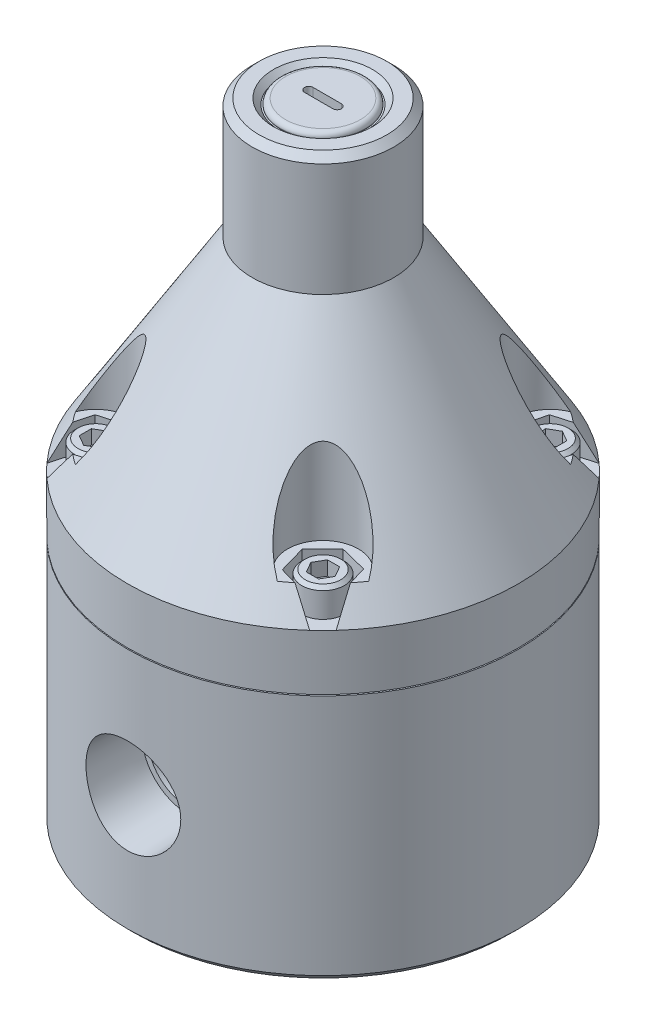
ISO-10303-21;
HEADER;
FILE_DESCRIPTION(('STEP AP214'),'2;1');
FILE_NAME('part.step','',(''),(''),'','','');
FILE_SCHEMA(('AUTOMOTIVE_DESIGN { 1 0 10303 214 1 1 1 1 }'));
ENDSEC;
DATA;
#1=APPLICATION_CONTEXT('core data for automotive mechanical design processes');
#2=APPLICATION_PROTOCOL_DEFINITION('international standard','automotive_design',2000,#1);
#3=PRODUCT_CONTEXT('',#1,'mechanical');
#4=PRODUCT('Part','Part','',(#3));
#5=PRODUCT_RELATED_PRODUCT_CATEGORY('part','',(#4));
#6=PRODUCT_DEFINITION_FORMATION('','',#4);
#7=PRODUCT_DEFINITION_CONTEXT('part definition',#1,'design');
#8=PRODUCT_DEFINITION('design','',#6,#7);
#9=PRODUCT_DEFINITION_SHAPE('','',#8);
#10=(LENGTH_UNIT() NAMED_UNIT(*) SI_UNIT(.MILLI.,.METRE.));
#11=(NAMED_UNIT(*) PLANE_ANGLE_UNIT() SI_UNIT($,.RADIAN.));
#12=(NAMED_UNIT(*) SI_UNIT($,.STERADIAN.) SOLID_ANGLE_UNIT());
#13=UNCERTAINTY_MEASURE_WITH_UNIT(LENGTH_MEASURE(1.E-05),#10,'distance_accuracy_value','');
#14=(GEOMETRIC_REPRESENTATION_CONTEXT(3) GLOBAL_UNCERTAINTY_ASSIGNED_CONTEXT((#13)) GLOBAL_UNIT_ASSIGNED_CONTEXT((#10,
#11,#12)) REPRESENTATION_CONTEXT('',''));
#15=CARTESIAN_POINT('',(0.,0.,0.));
#16=DIRECTION('',(0.,0.,1.));
#17=DIRECTION('',(1.,0.,0.));
#18=AXIS2_PLACEMENT_3D('',#15,#16,#17);
#19=CARTESIAN_POINT('',(0.,68.58,0.));
#20=DIRECTION('',(0.,-1.,0.));
#21=DIRECTION('',(0.,0.,-1.));
#22=AXIS2_PLACEMENT_3D('',#19,#20,#21);
#23=CONICAL_SURFACE('',#22,43.815,0.551031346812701);
#24=CARTESIAN_POINT('',(31.1854504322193,74.9302,-24.909570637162));
#25=CARTESIAN_POINT('',(31.2917993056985,74.4052604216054,-25.2932994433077));
#26=CARTESIAN_POINT('',(31.3977224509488,73.8791142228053,-25.6754921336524));
#27=CARTESIAN_POINT('',(31.6087824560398,72.8246364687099,-26.4370404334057));
#28=CARTESIAN_POINT('',(31.713919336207,72.2963049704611,-26.8163961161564));
#29=CARTESIAN_POINT('',(31.9234771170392,71.2376591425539,-27.5725240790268));
#30=CARTESIAN_POINT('',(32.0278980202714,70.7073448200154,-27.9492963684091));
#31=CARTESIAN_POINT('',(32.2360838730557,69.6448927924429,-28.7004741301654));
#32=CARTESIAN_POINT('',(32.3398488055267,69.1127550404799,-29.0748795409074));
#33=CARTESIAN_POINT('',(32.443312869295,68.5798,-29.4481993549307));
#34=B_SPLINE_CURVE_WITH_KNOTS('',3,(#24,#25,#26,#27,#28,#29,#30,#31,#32,#33),.UNSPECIFIED.,.F.,
.F.,(4,2,2,2,4),(0.,1.97662629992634,3.95320132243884,5.9297692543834,7.90638844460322),.UNSPECIFIED.);
#35=CARTESIAN_POINT('',(31.1854909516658,74.93,-24.9097168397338));
#36=VERTEX_POINT('',#35);
#37=CARTESIAN_POINT('',(32.4432740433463,68.58,-29.4480592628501));
#38=VERTEX_POINT('',#37);
#39=EDGE_CURVE('E745',#36,#38,#34,.T.);
#40=ORIENTED_EDGE('',*,*,#39,.F.);
#41=CARTESIAN_POINT('',(0.,74.93,0.));
#42=DIRECTION('',(0.,1.,0.));
#43=DIRECTION('',(0.,0.,1.));
#44=AXIS2_PLACEMENT_3D('',#41,#42,#43);
#45=CIRCLE('',#44,39.9127653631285);
#46=CARTESIAN_POINT('',(32.8759602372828,74.93,-22.6318376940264));
#47=VERTEX_POINT('',#46);
#48=EDGE_CURVE('E2436',#36,#47,#45,.F.);
#49=ORIENTED_EDGE('',*,*,#48,.T.);
#50=CARTESIAN_POINT('',(32.8760134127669,74.9298,-22.6319772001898));
#51=CARTESIAN_POINT('',(32.8078201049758,75.1861952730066,-22.4531520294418));
#52=CARTESIAN_POINT('',(32.7341907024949,75.4445704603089,-22.2793275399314));
#53=CARTESIAN_POINT('',(32.5770087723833,75.9645959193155,-21.9414911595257));
#54=CARTESIAN_POINT('',(32.4934589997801,76.2262452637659,-21.7774765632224));
#55=CARTESIAN_POINT('',(32.3174500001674,76.7519681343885,-21.4591594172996));
#56=CARTESIAN_POINT('',(32.2250013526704,77.0160384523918,-21.3048456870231));
#57=CARTESIAN_POINT('',(32.0318436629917,77.5464258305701,-21.0055220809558));
#58=CARTESIAN_POINT('',(31.9311339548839,77.8127430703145,-20.8605129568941));
#59=CARTESIAN_POINT('',(31.6173532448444,78.6150033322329,-20.4388792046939));
#60=CARTESIAN_POINT('',(31.3928032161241,79.1537454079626,-20.1759549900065));
#61=CARTESIAN_POINT('',(30.9170512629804,80.2357477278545,-19.6857657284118));
#62=CARTESIAN_POINT('',(30.6658395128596,80.7790095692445,-19.458513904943));
#63=CARTESIAN_POINT('',(30.118158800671,81.9115352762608,-19.022517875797));
#64=CARTESIAN_POINT('',(29.8196739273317,82.5009764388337,-18.8167433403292));
#65=CARTESIAN_POINT('',(29.3524342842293,83.3846139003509,-18.5396319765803));
#66=CARTESIAN_POINT('',(29.1934054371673,83.6791250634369,-18.452507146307));
#67=CARTESIAN_POINT('',(28.8689346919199,84.2675878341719,-18.2889878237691));
#68=CARTESIAN_POINT('',(28.7034932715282,84.5615394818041,-18.2125925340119));
#69=CARTESIAN_POINT('',(28.3660149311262,85.1488284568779,-18.0707333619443));
#70=CARTESIAN_POINT('',(28.1939696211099,85.442164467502,-18.0052839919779));
#71=CARTESIAN_POINT('',(27.8434345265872,86.0273145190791,-17.885863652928));
#72=CARTESIAN_POINT('',(27.6649449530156,86.3191286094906,-17.8318923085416));
#73=CARTESIAN_POINT('',(27.3014619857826,86.9004622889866,-17.7360312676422));
#74=CARTESIAN_POINT('',(27.1164723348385,87.1899830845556,-17.6941347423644));
#75=CARTESIAN_POINT('',(26.7396312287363,87.7661102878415,-17.6231649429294));
#76=CARTESIAN_POINT('',(26.5477800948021,88.0527168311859,-17.5940910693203));
#77=CARTESIAN_POINT('',(26.1388486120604,88.6481794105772,-17.5477736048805));
#78=CARTESIAN_POINT('',(25.9210687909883,88.9566632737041,-17.531860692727));
#79=CARTESIAN_POINT('',(25.4761618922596,89.5671217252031,-17.5184250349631));
#80=CARTESIAN_POINT('',(25.2490377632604,89.8690983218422,-17.5208965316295));
#81=CARTESIAN_POINT('',(24.7853264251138,90.462861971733,-17.546770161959));
#82=CARTESIAN_POINT('',(24.5487844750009,90.7546875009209,-17.5700815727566));
#83=CARTESIAN_POINT('',(24.1854004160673,91.182662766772,-17.6234209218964));
#84=CARTESIAN_POINT('',(24.0628808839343,91.3236542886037,-17.6442539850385));
#85=CARTESIAN_POINT('',(23.8147710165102,91.6017141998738,-17.6926688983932));
#86=CARTESIAN_POINT('',(23.6891808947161,91.7387828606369,-17.7202502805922));
#87=CARTESIAN_POINT('',(23.3476505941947,92.1003741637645,-17.8043004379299));
#88=CARTESIAN_POINT('',(23.1286985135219,92.320550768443,-17.8676208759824));
#89=CARTESIAN_POINT('',(22.6802930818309,92.7420139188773,-18.0200246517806));
#90=CARTESIAN_POINT('',(22.450819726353,92.9432620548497,-18.1091589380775));
#91=CARTESIAN_POINT('',(22.0978320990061,93.2244666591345,-18.2671443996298));
#92=CARTESIAN_POINT('',(21.9777912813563,93.315346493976,-18.3243659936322));
#93=CARTESIAN_POINT('',(21.7355133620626,93.4877899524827,-18.4477596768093));
#94=CARTESIAN_POINT('',(21.6132758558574,93.5693518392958,-18.5139334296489));
#95=CARTESIAN_POINT('',(21.3676920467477,93.7206957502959,-18.6557254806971));
#96=CARTESIAN_POINT('',(21.2443516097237,93.7905207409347,-18.7313074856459));
#97=CARTESIAN_POINT('',(20.997270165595,93.9162293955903,-18.8925662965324));
#98=CARTESIAN_POINT('',(20.8735295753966,93.9721245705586,-18.9782346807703));
#99=CARTESIAN_POINT('',(20.596353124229,94.0793061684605,-19.1825009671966));
#100=CARTESIAN_POINT('',(20.4431915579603,94.1259831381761,-19.303987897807));
#101=CARTESIAN_POINT('',(20.1429486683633,94.1891665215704,-19.561379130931));
#102=CARTESIAN_POINT('',(19.995862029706,94.2056998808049,-19.6972704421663));
#103=CARTESIAN_POINT('',(19.7121854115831,94.2068511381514,-19.9801670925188));
#104=CARTESIAN_POINT('',(19.5756118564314,94.1914201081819,-20.1271891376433));
#105=CARTESIAN_POINT('',(19.3168358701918,94.130256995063,-20.4274436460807));
#106=CARTESIAN_POINT('',(19.1946462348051,94.0844981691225,-20.5806814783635));
#107=CARTESIAN_POINT('',(18.9333227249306,93.9499537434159,-20.9335168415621));
#108=CARTESIAN_POINT('',(18.7994959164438,93.8525556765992,-21.1337148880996));
#109=CARTESIAN_POINT('',(18.5575341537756,93.6253225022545,-21.5311982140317));
#110=CARTESIAN_POINT('',(18.4494578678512,93.4954146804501,-21.7284758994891));
#111=CARTESIAN_POINT('',(18.2734255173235,93.2378861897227,-22.0822323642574));
#112=CARTESIAN_POINT('',(18.2017503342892,93.114033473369,-22.2396830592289));
#113=CARTESIAN_POINT('',(18.0717731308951,92.8543658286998,-22.5502860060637));
#114=CARTESIAN_POINT('',(18.0134803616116,92.7185427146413,-22.7034352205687));
#115=CARTESIAN_POINT('',(17.9085459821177,92.4375711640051,-23.0055063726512));
#116=CARTESIAN_POINT('',(17.8619238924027,92.2924076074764,-23.1544208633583));
#117=CARTESIAN_POINT('',(17.7789950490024,91.9949331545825,-23.4479825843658));
#118=CARTESIAN_POINT('',(17.7426923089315,91.842619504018,-23.5926281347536));
#119=CARTESIAN_POINT('',(17.6793668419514,91.5330276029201,-23.877261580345));
#120=CARTESIAN_POINT('',(17.6523073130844,91.3757718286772,-24.0172658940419));
#121=CARTESIAN_POINT('',(17.6063247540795,91.0568516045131,-24.2934532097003));
#122=CARTESIAN_POINT('',(17.5874006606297,90.8951877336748,-24.4296367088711));
#123=CARTESIAN_POINT('',(17.5416007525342,90.4045581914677,-24.8331155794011));
#124=CARTESIAN_POINT('',(17.5257415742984,90.0701857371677,-25.0951300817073));
#125=CARTESIAN_POINT('',(17.5187750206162,89.3910127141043,-25.6073018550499));
#126=CARTESIAN_POINT('',(17.5277362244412,89.0461858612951,-25.8574243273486));
#127=CARTESIAN_POINT('',(17.5674604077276,88.3499543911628,-26.346266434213));
#128=CARTESIAN_POINT('',(17.5982177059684,87.9985515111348,-26.5849890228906));
#129=CARTESIAN_POINT('',(17.6752315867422,87.3273950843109,-27.0279886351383));
#130=CARTESIAN_POINT('',(17.7195760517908,87.0080899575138,-27.2332880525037));
#131=CARTESIAN_POINT('',(17.8230232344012,86.366765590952,-27.6358491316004));
#132=CARTESIAN_POINT('',(17.8821279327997,86.0447459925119,-27.8331097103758));
#133=CARTESIAN_POINT('',(18.0143479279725,85.3986613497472,-28.2199078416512));
#134=CARTESIAN_POINT('',(18.0874725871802,85.0745950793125,-28.4094401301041));
#135=CARTESIAN_POINT('',(18.247146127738,84.4253288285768,-28.7807004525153));
#136=CARTESIAN_POINT('',(18.3336943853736,84.100128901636,-28.9624288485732));
#137=CARTESIAN_POINT('',(18.5196821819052,83.4497138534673,-29.3177238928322));
#138=CARTESIAN_POINT('',(18.6190998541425,83.1244996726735,-29.4913037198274));
#139=CARTESIAN_POINT('',(18.8307065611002,82.4740292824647,-29.830436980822));
#140=CARTESIAN_POINT('',(18.9428959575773,82.1487730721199,-29.9959901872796));
#141=CARTESIAN_POINT('',(19.1798765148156,81.4988617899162,-30.3186806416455));
#142=CARTESIAN_POINT('',(19.3046623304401,81.1742065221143,-30.4758214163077));
#143=CARTESIAN_POINT('',(19.566846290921,80.5258852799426,-30.7813029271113));
#144=CARTESIAN_POINT('',(19.7042435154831,80.2022192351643,-30.929644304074));
#145=CARTESIAN_POINT('',(20.0356080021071,79.4577845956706,-31.2608218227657));
#146=CARTESIAN_POINT('',(20.2340425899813,79.0375277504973,-31.4403688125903));
#147=CARTESIAN_POINT('',(20.6528330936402,78.2009180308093,-31.7817933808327));
#148=CARTESIAN_POINT('',(20.8731810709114,77.7845638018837,-31.943677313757));
#149=CARTESIAN_POINT('',(21.2204706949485,77.1642648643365,-32.1715277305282));
#150=CARTESIAN_POINT('',(21.3389735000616,76.9582923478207,-32.244953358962));
#151=CARTESIAN_POINT('',(21.5816967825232,76.5479021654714,-32.3865049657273));
#152=CARTESIAN_POINT('',(21.7059169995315,76.3434844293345,-32.454631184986));
#153=CARTESIAN_POINT('',(21.9602864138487,75.936277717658,-32.5852592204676));
#154=CARTESIAN_POINT('',(22.0904406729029,75.7334903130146,-32.647756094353));
#155=CARTESIAN_POINT('',(22.3567119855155,75.3299985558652,-32.7666088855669));
#156=CARTESIAN_POINT('',(22.4928299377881,75.1292945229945,-32.8229638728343));
#157=CARTESIAN_POINT('',(22.6319772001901,74.9298,-32.8760134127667));
#158=B_SPLINE_CURVE_WITH_KNOTS('',3,(#50,#51,#52,#53,#54,#55,#56,#57,#58,#59,#60,#61,#62,#63,
#64,#65,#66,#67,#68,#69,#70,#71,#72,#73,#74,#75,#76,#77,#78,#79,#80,#81,#82,#83,#84,#85,#86,#87,
#88,#89,#90,#91,#92,#93,#94,#95,#96,#97,#98,#99,#100,#101,#102,#103,#104,#105,#106,#107,#108,
#109,#110,#111,#112,#113,#114,#115,#116,#117,#118,#119,#120,#121,#122,#123,#124,#125,#126,#127,
#128,#129,#130,#131,#132,#133,#134,#135,#136,#137,#138,#139,#140,#141,#142,#143,#144,#145,#146,
#147,#148,#149,#150,#151,#152,#153,#154,#155,#156,#157),.UNSPECIFIED.,.F.,.F.,(4,2,2,2,2,2,2,2,
2,2,2,2,2,2,2,2,2,2,2,2,2,2,2,2,2,2,2,2,2,2,2,2,2,2,2,2,2,2,2,2,2,2,2,2,2,2,2,2,2,2,2,2,2,4),
(0.,0.959681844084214,1.9190977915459,2.87738689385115,3.83575332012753,5.75433905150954,
7.67363431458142,9.74768208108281,10.7850777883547,11.8223963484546,12.8610794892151,
13.8997286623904,14.9377892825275,15.9758013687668,17.1090815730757,18.2420068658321,
19.3700240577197,19.9337037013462,20.4973442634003,21.4467185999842,22.3979796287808,
22.8807596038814,23.363629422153,23.8446911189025,24.3253539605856,24.9256472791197,
25.5254037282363,26.1260789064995,26.7272844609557,27.5022221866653,28.2789089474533,
28.9163059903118,29.5541423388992,30.193038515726,30.8321828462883,31.4687519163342,
32.1052377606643,33.3791509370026,34.6565874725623,35.9336911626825,37.0798743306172,
38.2262114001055,39.3733166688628,40.520368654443,41.665496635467,42.8106570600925,
43.9553335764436,45.0999266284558,46.5938371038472,48.0872083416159,48.8332472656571,
49.5792522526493,50.325905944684,51.0726725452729),.UNSPECIFIED.);
#159=CARTESIAN_POINT('',(22.6318376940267,74.93,-32.8759602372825));
#160=VERTEX_POINT('',#159);
#161=EDGE_CURVE('E896',#47,#160,#158,.T.);
#162=ORIENTED_EDGE('',*,*,#161,.T.);
#163=CARTESIAN_POINT('',(24.9752922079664,74.93,-31.1329988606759));
#164=VERTEX_POINT('',#163);
#165=EDGE_CURVE('E905',#160,#164,#45,.F.);
#166=ORIENTED_EDGE('',*,*,#165,.T.);
#167=CARTESIAN_POINT('',(29.4766640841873,68.5798,-32.4174531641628));
#168=CARTESIAN_POINT('',(29.1062316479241,69.1125841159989,-32.3117512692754));
#169=CARTESIAN_POINT('',(28.7347583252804,69.6445870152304,-32.2057523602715));
#170=CARTESIAN_POINT('',(27.9895431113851,70.7068520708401,-31.9931072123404));
#171=CARTESIAN_POINT('',(27.6158012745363,71.2371142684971,-31.8864609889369));
#172=CARTESIAN_POINT('',(26.8658433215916,72.2957468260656,-31.6724625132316));
#173=CARTESIAN_POINT('',(26.4896271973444,72.8241171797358,-31.5651102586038));
#174=CARTESIAN_POINT('',(25.7344797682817,73.8787747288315,-31.3496309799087));
#175=CARTESIAN_POINT('',(25.3555483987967,74.4050618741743,-31.2415039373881));
#176=CARTESIAN_POINT('',(24.9751473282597,74.9302,-31.132957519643));
#177=B_SPLINE_CURVE_WITH_KNOTS('',3,(#167,#168,#169,#170,#171,#172,#173,#174,#175,#176),
.UNSPECIFIED.,.F.,.F.,(4,2,2,2,4),(0.,1.97237650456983,3.9447058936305,5.91704178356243,
7.88942480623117),.UNSPECIFIED.);
#178=CARTESIAN_POINT('',(29.4765250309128,68.58,-32.4174134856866));
#179=VERTEX_POINT('',#178);
#180=EDGE_CURVE('E728',#179,#164,#177,.T.);
#181=ORIENTED_EDGE('',*,*,#180,.F.);
#182=CARTESIAN_POINT('',(0.,68.58,0.));
#183=DIRECTION('',(0.,-1.,0.));
#184=DIRECTION('',(0.,0.,-1.));
#185=AXIS2_PLACEMENT_3D('',#182,#183,#184);
#186=CIRCLE('',#185,43.815);
#187=CARTESIAN_POINT('',(-29.4480592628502,68.58,-32.4432740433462));
#188=VERTEX_POINT('',#187);
#189=EDGE_CURVE('E1309',#188,#179,#186,.T.);
#190=ORIENTED_EDGE('',*,*,#189,.F.);
#191=CARTESIAN_POINT('',(-24.9095706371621,74.9302,-31.1854504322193));
#192=CARTESIAN_POINT('',(-25.2932994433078,74.4052604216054,-31.2917993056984));
#193=CARTESIAN_POINT('',(-25.6754921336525,73.8791142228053,-31.3977224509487));
#194=CARTESIAN_POINT('',(-26.4370404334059,72.8246364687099,-31.6087824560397));
#195=CARTESIAN_POINT('',(-26.8163961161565,72.2963049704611,-31.7139193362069));
#196=CARTESIAN_POINT('',(-27.5725240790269,71.2376591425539,-31.9234771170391));
#197=CARTESIAN_POINT('',(-27.9492963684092,70.7073448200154,-32.0278980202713));
#198=CARTESIAN_POINT('',(-28.7004741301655,69.6448927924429,-32.2360838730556));
#199=CARTESIAN_POINT('',(-29.0748795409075,69.1127550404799,-32.3398488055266));
#200=CARTESIAN_POINT('',(-29.4481993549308,68.5798,-32.4433128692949));
#201=B_SPLINE_CURVE_WITH_KNOTS('',3,(#191,#192,#193,#194,#195,#196,#197,#198,#199,#200),
.UNSPECIFIED.,.F.,.F.,(4,2,2,2,4),(0.,1.97662629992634,3.95320132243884,5.9297692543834,
7.90638844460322),.UNSPECIFIED.);
#202=CARTESIAN_POINT('',(-24.9097168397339,74.93,-31.1854909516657));
#203=VERTEX_POINT('',#202);
#204=EDGE_CURVE('E802',#203,#188,#201,.T.);
#205=ORIENTED_EDGE('',*,*,#204,.F.);
#206=CARTESIAN_POINT('',(0.,74.93,0.));
#207=DIRECTION('',(0.,1.,0.));
#208=DIRECTION('',(0.,0.,1.));
#209=AXIS2_PLACEMENT_3D('',#206,#207,#208);
#210=CIRCLE('',#209,39.9127653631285);
#211=CARTESIAN_POINT('',(-22.6318376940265,74.93,-32.8759602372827));
#212=VERTEX_POINT('',#211);
#213=EDGE_CURVE('E1672',#203,#212,#210,.F.);
#214=ORIENTED_EDGE('',*,*,#213,.T.);
#215=CARTESIAN_POINT('',(-22.6319772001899,74.9298,-32.8760134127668));
#216=CARTESIAN_POINT('',(-22.4531520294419,75.1861952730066,-32.8078201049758));
#217=CARTESIAN_POINT('',(-22.2793275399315,75.4445704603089,-32.7341907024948));
#218=CARTESIAN_POINT('',(-21.9414911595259,75.9645959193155,-32.5770087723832));
#219=CARTESIAN_POINT('',(-21.7774765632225,76.2262452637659,-32.49345899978));
#220=CARTESIAN_POINT('',(-21.4591594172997,76.7519681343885,-32.3174500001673));
#221=CARTESIAN_POINT('',(-21.3048456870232,77.0160384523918,-32.2250013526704));
#222=CARTESIAN_POINT('',(-21.0055220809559,77.5464258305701,-32.0318436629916));
#223=CARTESIAN_POINT('',(-20.8605129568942,77.8127430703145,-31.9311339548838));
#224=CARTESIAN_POINT('',(-20.438879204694,78.6150033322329,-31.6173532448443));
#225=CARTESIAN_POINT('',(-20.1759549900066,79.1537454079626,-31.392803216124));
#226=CARTESIAN_POINT('',(-19.6857657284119,80.2357477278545,-30.9170512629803));
#227=CARTESIAN_POINT('',(-19.4585139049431,80.7790095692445,-30.6658395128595));
#228=CARTESIAN_POINT('',(-19.0225178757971,81.9115352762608,-30.1181588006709));
#229=CARTESIAN_POINT('',(-18.8167433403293,82.5009764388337,-29.8196739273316));
#230=CARTESIAN_POINT('',(-18.5396319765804,83.3846139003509,-29.3524342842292));
#231=CARTESIAN_POINT('',(-18.4525071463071,83.6791250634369,-29.1934054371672));
#232=CARTESIAN_POINT('',(-18.2889878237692,84.2675878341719,-28.8689346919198));
#233=CARTESIAN_POINT('',(-18.212592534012,84.5615394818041,-28.7034932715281));
#234=CARTESIAN_POINT('',(-18.0707333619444,85.148828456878,-28.3660149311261));
#235=CARTESIAN_POINT('',(-18.005283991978,85.4421644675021,-28.1939696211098));
#236=CARTESIAN_POINT('',(-17.8858636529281,86.0273145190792,-27.8434345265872));
#237=CARTESIAN_POINT('',(-17.8318923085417,86.3191286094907,-27.6649449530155));
#238=CARTESIAN_POINT('',(-17.7360312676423,86.9004622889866,-27.3014619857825));
#239=CARTESIAN_POINT('',(-17.6941347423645,87.1899830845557,-27.1164723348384));
#240=CARTESIAN_POINT('',(-17.6231649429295,87.7661102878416,-26.7396312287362));
#241=CARTESIAN_POINT('',(-17.5940910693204,88.052716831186,-26.547780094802));
#242=CARTESIAN_POINT('',(-17.5477736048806,88.6481794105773,-26.1388486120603));
#243=CARTESIAN_POINT('',(-17.5318606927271,88.9566632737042,-25.9210687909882));
#244=CARTESIAN_POINT('',(-17.5184250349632,89.5671217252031,-25.4761618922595));
#245=CARTESIAN_POINT('',(-17.5208965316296,89.8690983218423,-25.2490377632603));
#246=CARTESIAN_POINT('',(-17.5467701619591,90.462861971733,-24.7853264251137));
#247=CARTESIAN_POINT('',(-17.5700815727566,90.754687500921,-24.5487844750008));
#248=CARTESIAN_POINT('',(-17.6234209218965,91.1826627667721,-24.1854004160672));
#249=CARTESIAN_POINT('',(-17.6442539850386,91.3236542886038,-24.0628808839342));
#250=CARTESIAN_POINT('',(-17.6926688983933,91.6017141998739,-23.8147710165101));
#251=CARTESIAN_POINT('',(-17.7202502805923,91.7387828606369,-23.6891808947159));
#252=CARTESIAN_POINT('',(-17.80430043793,92.1003741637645,-23.3476505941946));
#253=CARTESIAN_POINT('',(-17.8676208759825,92.320550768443,-23.1286985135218));
#254=CARTESIAN_POINT('',(-18.0200246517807,92.7420139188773,-22.6802930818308));
#255=CARTESIAN_POINT('',(-18.1091589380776,92.9432620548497,-22.4508197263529));
#256=CARTESIAN_POINT('',(-18.2671443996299,93.2244666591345,-22.097832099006));
#257=CARTESIAN_POINT('',(-18.3243659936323,93.3153464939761,-21.9777912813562));
#258=CARTESIAN_POINT('',(-18.4477596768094,93.4877899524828,-21.7355133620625));
#259=CARTESIAN_POINT('',(-18.513933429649,93.5693518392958,-21.6132758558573));
#260=CARTESIAN_POINT('',(-18.6557254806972,93.7206957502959,-21.3676920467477));
#261=CARTESIAN_POINT('',(-18.731307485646,93.7905207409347,-21.2443516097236));
#262=CARTESIAN_POINT('',(-18.8925662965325,93.9162293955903,-20.9972701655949));
#263=CARTESIAN_POINT('',(-18.9782346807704,93.9721245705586,-20.8735295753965));
#264=CARTESIAN_POINT('',(-19.1825009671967,94.0793061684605,-20.5963531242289));
#265=CARTESIAN_POINT('',(-19.3039878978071,94.1259831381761,-20.4431915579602));
#266=CARTESIAN_POINT('',(-19.5613791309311,94.1891665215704,-20.1429486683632));
#267=CARTESIAN_POINT('',(-19.6972704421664,94.2056998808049,-19.9958620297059));
#268=CARTESIAN_POINT('',(-19.9801670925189,94.2068511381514,-19.7121854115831));
#269=CARTESIAN_POINT('',(-20.1271891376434,94.1914201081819,-19.5756118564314));
#270=CARTESIAN_POINT('',(-20.4274436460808,94.130256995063,-19.3168358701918));
#271=CARTESIAN_POINT('',(-20.5806814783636,94.0844981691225,-19.194646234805));
#272=CARTESIAN_POINT('',(-20.9335168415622,93.9499537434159,-18.9333227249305));
#273=CARTESIAN_POINT('',(-21.1337148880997,93.8525556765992,-18.7994959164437));
#274=CARTESIAN_POINT('',(-21.5311982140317,93.6253225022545,-18.5575341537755));
#275=CARTESIAN_POINT('',(-21.7284758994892,93.4954146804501,-18.4494578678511));
#276=CARTESIAN_POINT('',(-22.0822323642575,93.2378861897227,-18.2734255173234));
#277=CARTESIAN_POINT('',(-22.239683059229,93.114033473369,-18.2017503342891));
#278=CARTESIAN_POINT('',(-22.5502860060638,92.8543658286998,-18.071773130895));
#279=CARTESIAN_POINT('',(-22.7034352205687,92.7185427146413,-18.0134803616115));
#280=CARTESIAN_POINT('',(-23.0055063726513,92.437571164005,-17.9085459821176));
#281=CARTESIAN_POINT('',(-23.1544208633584,92.2924076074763,-17.8619238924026));
#282=CARTESIAN_POINT('',(-23.4479825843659,91.9949331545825,-17.7789950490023));
#283=CARTESIAN_POINT('',(-23.5926281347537,91.842619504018,-17.7426923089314));
#284=CARTESIAN_POINT('',(-23.8772615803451,91.5330276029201,-17.6793668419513));
#285=CARTESIAN_POINT('',(-24.017265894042,91.3757718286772,-17.6523073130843));
#286=CARTESIAN_POINT('',(-24.2934532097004,91.0568516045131,-17.6063247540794));
#287=CARTESIAN_POINT('',(-24.4296367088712,90.8951877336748,-17.5874006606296));
#288=CARTESIAN_POINT('',(-24.8331155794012,90.4045581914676,-17.5416007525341));
#289=CARTESIAN_POINT('',(-25.0951300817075,90.0701857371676,-17.5257415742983));
#290=CARTESIAN_POINT('',(-25.60730185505,89.3910127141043,-17.5187750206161));
#291=CARTESIAN_POINT('',(-25.8574243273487,89.046185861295,-17.5277362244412));
#292=CARTESIAN_POINT('',(-26.3462664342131,88.3499543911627,-17.5674604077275));
#293=CARTESIAN_POINT('',(-26.5849890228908,87.9985515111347,-17.5982177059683));
#294=CARTESIAN_POINT('',(-27.0279886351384,87.3273950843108,-17.6752315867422));
#295=CARTESIAN_POINT('',(-27.2332880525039,87.0080899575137,-17.7195760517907));
#296=CARTESIAN_POINT('',(-27.6358491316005,86.366765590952,-17.8230232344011));
#297=CARTESIAN_POINT('',(-27.8331097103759,86.0447459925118,-17.8821279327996));
#298=CARTESIAN_POINT('',(-28.2199078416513,85.3986613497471,-18.0143479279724));
#299=CARTESIAN_POINT('',(-28.4094401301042,85.0745950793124,-18.0874725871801));
#300=CARTESIAN_POINT('',(-28.7807004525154,84.4253288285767,-18.2471461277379));
#301=CARTESIAN_POINT('',(-28.9624288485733,84.1001289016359,-18.3336943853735));
#302=CARTESIAN_POINT('',(-29.3177238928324,83.4497138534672,-18.5196821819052));
#303=CARTESIAN_POINT('',(-29.4913037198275,83.1244996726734,-18.6190998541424));
#304=CARTESIAN_POINT('',(-29.8304369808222,82.4740292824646,-18.8307065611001));
#305=CARTESIAN_POINT('',(-29.9959901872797,82.1487730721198,-18.9428959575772));
#306=CARTESIAN_POINT('',(-30.3186806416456,81.498861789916,-19.1798765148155));
#307=CARTESIAN_POINT('',(-30.4758214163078,81.1742065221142,-19.3046623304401));
#308=CARTESIAN_POINT('',(-30.7813029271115,80.5258852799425,-19.5668462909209));
#309=CARTESIAN_POINT('',(-30.9296443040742,80.2022192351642,-19.7042435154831));
#310=CARTESIAN_POINT('',(-31.2608218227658,79.4577845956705,-20.0356080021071));
#311=CARTESIAN_POINT('',(-31.4403688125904,79.0375277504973,-20.2340425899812));
#312=CARTESIAN_POINT('',(-31.7817933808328,78.2009180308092,-20.6528330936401));
#313=CARTESIAN_POINT('',(-31.9436773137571,77.7845638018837,-20.8731810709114));
#314=CARTESIAN_POINT('',(-32.1715277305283,77.1642648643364,-21.2204706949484));
#315=CARTESIAN_POINT('',(-32.2449533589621,76.9582923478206,-21.3389735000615));
#316=CARTESIAN_POINT('',(-32.3865049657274,76.5479021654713,-21.5816967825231));
#317=CARTESIAN_POINT('',(-32.4546311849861,76.3434844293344,-21.7059169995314));
#318=CARTESIAN_POINT('',(-32.5852592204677,75.9362777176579,-21.9602864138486));
#319=CARTESIAN_POINT('',(-32.6477560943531,75.7334903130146,-22.0904406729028));
#320=CARTESIAN_POINT('',(-32.766608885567,75.3299985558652,-22.3567119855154));
#321=CARTESIAN_POINT('',(-32.8229638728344,75.1292945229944,-22.492829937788));
#322=CARTESIAN_POINT('',(-32.8760134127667,74.9298,-22.63197720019));
#323=B_SPLINE_CURVE_WITH_KNOTS('',3,(#215,#216,#217,#218,#219,#220,#221,#222,#223,#224,#225,
#226,#227,#228,#229,#230,#231,#232,#233,#234,#235,#236,#237,#238,#239,#240,#241,#242,#243,#244,
#245,#246,#247,#248,#249,#250,#251,#252,#253,#254,#255,#256,#257,#258,#259,#260,#261,#262,#263,
#264,#265,#266,#267,#268,#269,#270,#271,#272,#273,#274,#275,#276,#277,#278,#279,#280,#281,#282,
#283,#284,#285,#286,#287,#288,#289,#290,#291,#292,#293,#294,#295,#296,#297,#298,#299,#300,#301,
#302,#303,#304,#305,#306,#307,#308,#309,#310,#311,#312,#313,#314,#315,#316,#317,#318,#319,#320,
#321,#322),.UNSPECIFIED.,.F.,.F.,(4,2,2,2,2,2,2,2,2,2,2,2,2,2,2,2,2,2,2,2,2,2,2,2,2,2,2,2,2,2,2,
2,2,2,2,2,2,2,2,2,2,2,2,2,2,2,2,2,2,2,2,2,2,4),(0.,0.959681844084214,1.9190977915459,
2.87738689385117,3.83575332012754,5.75433905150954,7.67363431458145,9.74768208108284,
10.7850777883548,11.8223963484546,12.8610794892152,13.8997286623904,14.9377892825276,
15.9758013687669,17.1090815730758,18.2420068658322,19.3700240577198,19.9337037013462,
20.4973442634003,21.4467185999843,22.3979796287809,22.8807596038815,23.3636294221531,
23.8446911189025,24.3253539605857,24.9256472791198,25.5254037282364,26.1260789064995,
26.7272844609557,27.5022221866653,28.2789089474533,28.9163059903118,29.5541423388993,
30.193038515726,30.8321828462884,31.4687519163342,32.1052377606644,33.3791509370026,
34.6565874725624,35.9336911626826,37.0798743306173,38.2262114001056,39.373316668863,
40.5203686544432,41.6654966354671,42.8106570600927,43.9553335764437,45.0999266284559,
46.5938371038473,48.0872083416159,48.8332472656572,49.5792522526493,50.3259059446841,
51.0726725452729),.UNSPECIFIED.);
#324=CARTESIAN_POINT('',(-32.8759602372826,74.93,-22.6318376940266));
#325=VERTEX_POINT('',#324);
#326=EDGE_CURVE('E2434',#212,#325,#323,.T.);
#327=ORIENTED_EDGE('',*,*,#326,.T.);
#328=CARTESIAN_POINT('',(-31.132998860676,74.93,-24.9752922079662));
#329=VERTEX_POINT('',#328);
#330=EDGE_CURVE('E1359',#325,#329,#210,.F.);
#331=ORIENTED_EDGE('',*,*,#330,.T.);
#332=CARTESIAN_POINT('',(-32.4174531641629,68.5798,-29.4766640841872));
#333=CARTESIAN_POINT('',(-32.3117512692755,69.1125841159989,-29.106231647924));
#334=CARTESIAN_POINT('',(-32.2057523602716,69.6445870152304,-28.7347583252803));
#335=CARTESIAN_POINT('',(-31.9931072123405,70.7068520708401,-27.989543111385));
#336=CARTESIAN_POINT('',(-31.886460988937,71.2371142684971,-27.6158012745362));
#337=CARTESIAN_POINT('',(-31.6724625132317,72.2957468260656,-26.8658433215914));
#338=CARTESIAN_POINT('',(-31.5651102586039,72.8241171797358,-26.4896271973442));
#339=CARTESIAN_POINT('',(-31.3496309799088,73.8787747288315,-25.7344797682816));
#340=CARTESIAN_POINT('',(-31.2415039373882,74.4050618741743,-25.3555483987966));
#341=CARTESIAN_POINT('',(-31.1329575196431,74.9302,-24.9751473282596));
#342=B_SPLINE_CURVE_WITH_KNOTS('',3,(#332,#333,#334,#335,#336,#337,#338,#339,#340,#341),
.UNSPECIFIED.,.F.,.F.,(4,2,2,2,4),(0.,1.9723765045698,3.94470589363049,5.91704178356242,
7.88942480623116),.UNSPECIFIED.);
#343=CARTESIAN_POINT('',(-32.4174134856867,68.58,-29.4765250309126));
#344=VERTEX_POINT('',#343);
#345=EDGE_CURVE('E795',#344,#329,#342,.T.);
#346=ORIENTED_EDGE('',*,*,#345,.F.);
#347=CARTESIAN_POINT('',(-32.4432740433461,68.58,29.4480592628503));
#348=VERTEX_POINT('',#347);
#349=EDGE_CURVE('E1317',#348,#344,#186,.T.);
#350=ORIENTED_EDGE('',*,*,#349,.F.);
#351=CARTESIAN_POINT('',(-31.1854504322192,74.9302,24.9095706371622));
#352=CARTESIAN_POINT('',(-31.2917993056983,74.4052604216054,25.2932994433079));
#353=CARTESIAN_POINT('',(-31.3977224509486,73.8791142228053,25.6754921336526));
#354=CARTESIAN_POINT('',(-31.6087824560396,72.8246364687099,26.437040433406));
#355=CARTESIAN_POINT('',(-31.7139193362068,72.2963049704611,26.8163961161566));
#356=CARTESIAN_POINT('',(-31.9234771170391,71.2376591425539,27.572524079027));
#357=CARTESIAN_POINT('',(-32.0278980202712,70.7073448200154,27.9492963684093));
#358=CARTESIAN_POINT('',(-32.2360838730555,69.6448927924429,28.7004741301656));
#359=CARTESIAN_POINT('',(-32.3398488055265,69.1127550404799,29.0748795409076));
#360=CARTESIAN_POINT('',(-32.4433128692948,68.5798,29.4481993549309));
#361=B_SPLINE_CURVE_WITH_KNOTS('',3,(#351,#352,#353,#354,#355,#356,#357,#358,#359,#360),
.UNSPECIFIED.,.F.,.F.,(4,2,2,2,4),(0.,1.97662629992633,3.95320132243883,5.9297692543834,
7.90638844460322),.UNSPECIFIED.);
#362=CARTESIAN_POINT('',(-31.1854909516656,74.93,24.9097168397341));
#363=VERTEX_POINT('',#362);
#364=EDGE_CURVE('E865',#363,#348,#361,.T.);
#365=ORIENTED_EDGE('',*,*,#364,.F.);
#366=CARTESIAN_POINT('',(0.,74.93,0.));
#367=DIRECTION('',(0.,1.,0.));
#368=DIRECTION('',(0.,0.,1.));
#369=AXIS2_PLACEMENT_3D('',#366,#367,#368);
#370=CIRCLE('',#369,39.9127653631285);
#371=CARTESIAN_POINT('',(-32.8759602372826,74.93,22.6318376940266));
#372=VERTEX_POINT('',#371);
#373=EDGE_CURVE('E1668',#363,#372,#370,.F.);
#374=ORIENTED_EDGE('',*,*,#373,.T.);
#375=CARTESIAN_POINT('',(-32.8760134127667,74.9298,22.63197720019));
#376=CARTESIAN_POINT('',(-32.8078201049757,75.1861952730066,22.453152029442));
#377=CARTESIAN_POINT('',(-32.7341907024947,75.4445704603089,22.2793275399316));
#378=CARTESIAN_POINT('',(-32.5770087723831,75.9645959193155,21.941491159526));
#379=CARTESIAN_POINT('',(-32.4934589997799,76.2262452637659,21.7774765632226));
#380=CARTESIAN_POINT('',(-32.3174500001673,76.7519681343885,21.4591594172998));
#381=CARTESIAN_POINT('',(-32.2250013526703,77.0160384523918,21.3048456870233));
#382=CARTESIAN_POINT('',(-32.0318436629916,77.5464258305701,21.005522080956));
#383=CARTESIAN_POINT('',(-31.9311339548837,77.8127430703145,20.8605129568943));
#384=CARTESIAN_POINT('',(-31.6173532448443,78.6150033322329,20.4388792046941));
#385=CARTESIAN_POINT('',(-31.3928032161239,79.1537454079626,20.1759549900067));
#386=CARTESIAN_POINT('',(-30.9170512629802,80.2357477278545,19.685765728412));
#387=CARTESIAN_POINT('',(-30.6658395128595,80.7790095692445,19.4585139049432));
#388=CARTESIAN_POINT('',(-30.1181588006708,81.9115352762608,19.0225178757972));
#389=CARTESIAN_POINT('',(-29.8196739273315,82.5009764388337,18.8167433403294));
#390=CARTESIAN_POINT('',(-29.3524342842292,83.3846139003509,18.5396319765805));
#391=CARTESIAN_POINT('',(-29.1934054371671,83.6791250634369,18.4525071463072));
#392=CARTESIAN_POINT('',(-28.8689346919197,84.2675878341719,18.2889878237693));
#393=CARTESIAN_POINT('',(-28.703493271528,84.5615394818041,18.2125925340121));
#394=CARTESIAN_POINT('',(-28.3660149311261,85.1488284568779,18.0707333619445));
#395=CARTESIAN_POINT('',(-28.1939696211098,85.442164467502,18.0052839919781));
#396=CARTESIAN_POINT('',(-27.8434345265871,86.0273145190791,17.8858636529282));
#397=CARTESIAN_POINT('',(-27.6649449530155,86.3191286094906,17.8318923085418));
#398=CARTESIAN_POINT('',(-27.3014619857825,86.9004622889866,17.7360312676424));
#399=CARTESIAN_POINT('',(-27.1164723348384,87.1899830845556,17.6941347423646));
#400=CARTESIAN_POINT('',(-26.7396312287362,87.7661102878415,17.6231649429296));
#401=CARTESIAN_POINT('',(-26.5477800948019,88.0527168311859,17.5940910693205));
#402=CARTESIAN_POINT('',(-26.1388486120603,88.6481794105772,17.5477736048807));
#403=CARTESIAN_POINT('',(-25.9210687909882,88.9566632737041,17.5318606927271));
#404=CARTESIAN_POINT('',(-25.4761618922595,89.5671217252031,17.5184250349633));
#405=CARTESIAN_POINT('',(-25.2490377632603,89.8690983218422,17.5208965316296));
#406=CARTESIAN_POINT('',(-24.7853264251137,90.462861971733,17.5467701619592));
#407=CARTESIAN_POINT('',(-24.5487844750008,90.7546875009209,17.5700815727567));
#408=CARTESIAN_POINT('',(-24.1854004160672,91.1826627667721,17.6234209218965));
#409=CARTESIAN_POINT('',(-24.0628808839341,91.3236542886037,17.6442539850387));
#410=CARTESIAN_POINT('',(-23.8147710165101,91.6017141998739,17.6926688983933));
#411=CARTESIAN_POINT('',(-23.6891808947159,91.7387828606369,17.7202502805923));
#412=CARTESIAN_POINT('',(-23.3476505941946,92.1003741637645,17.80430043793));
#413=CARTESIAN_POINT('',(-23.1286985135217,92.320550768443,17.8676208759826));
#414=CARTESIAN_POINT('',(-22.6802930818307,92.7420139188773,18.0200246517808));
#415=CARTESIAN_POINT('',(-22.4508197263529,92.9432620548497,18.1091589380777));
#416=CARTESIAN_POINT('',(-22.0978320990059,93.2244666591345,18.2671443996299));
#417=CARTESIAN_POINT('',(-21.9777912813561,93.315346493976,18.3243659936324));
#418=CARTESIAN_POINT('',(-21.7355133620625,93.4877899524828,18.4477596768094));
#419=CARTESIAN_POINT('',(-21.6132758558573,93.5693518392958,18.5139334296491));
#420=CARTESIAN_POINT('',(-21.3676920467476,93.7206957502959,18.6557254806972));
#421=CARTESIAN_POINT('',(-21.2443516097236,93.7905207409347,18.7313074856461));
#422=CARTESIAN_POINT('',(-20.9972701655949,93.9162293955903,18.8925662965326));
#423=CARTESIAN_POINT('',(-20.8735295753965,93.9721245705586,18.9782346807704));
#424=CARTESIAN_POINT('',(-20.5963531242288,94.0793061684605,19.1825009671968));
#425=CARTESIAN_POINT('',(-20.4431915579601,94.1259831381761,19.3039878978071));
#426=CARTESIAN_POINT('',(-20.1429486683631,94.1891665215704,19.5613791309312));
#427=CARTESIAN_POINT('',(-19.9958620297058,94.2056998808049,19.6972704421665));
#428=CARTESIAN_POINT('',(-19.712185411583,94.2068511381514,19.980167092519));
#429=CARTESIAN_POINT('',(-19.5756118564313,94.1914201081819,20.1271891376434));
#430=CARTESIAN_POINT('',(-19.3168358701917,94.130256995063,20.4274436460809));
#431=CARTESIAN_POINT('',(-19.194646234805,94.0844981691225,20.5806814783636));
#432=CARTESIAN_POINT('',(-18.9333227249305,93.9499537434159,20.9335168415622));
#433=CARTESIAN_POINT('',(-18.7994959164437,93.8525556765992,21.1337148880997));
#434=CARTESIAN_POINT('',(-18.5575341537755,93.6253225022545,21.5311982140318));
#435=CARTESIAN_POINT('',(-18.449457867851,93.4954146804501,21.7284758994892));
#436=CARTESIAN_POINT('',(-18.2734255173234,93.2378861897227,22.0822323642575));
#437=CARTESIAN_POINT('',(-18.201750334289,93.114033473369,22.239683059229));
#438=CARTESIAN_POINT('',(-18.0717731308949,92.8543658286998,22.5502860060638));
#439=CARTESIAN_POINT('',(-18.0134803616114,92.7185427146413,22.7034352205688));
#440=CARTESIAN_POINT('',(-17.9085459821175,92.4375711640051,23.0055063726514));
#441=CARTESIAN_POINT('',(-17.8619238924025,92.2924076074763,23.1544208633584));
#442=CARTESIAN_POINT('',(-17.7789950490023,91.9949331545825,23.447982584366));
#443=CARTESIAN_POINT('',(-17.7426923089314,91.842619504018,23.5926281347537));
#444=CARTESIAN_POINT('',(-17.6793668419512,91.5330276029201,23.8772615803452));
#445=CARTESIAN_POINT('',(-17.6523073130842,91.3757718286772,24.017265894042));
#446=CARTESIAN_POINT('',(-17.6063247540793,91.0568516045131,24.2934532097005));
#447=CARTESIAN_POINT('',(-17.5874006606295,90.8951877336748,24.4296367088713));
#448=CARTESIAN_POINT('',(-17.541600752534,90.4045581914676,24.8331155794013));
#449=CARTESIAN_POINT('',(-17.5257415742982,90.0701857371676,25.0951300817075));
#450=CARTESIAN_POINT('',(-17.518775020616,89.3910127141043,25.6073018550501));
#451=CARTESIAN_POINT('',(-17.5277362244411,89.046185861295,25.8574243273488));
#452=CARTESIAN_POINT('',(-17.5674604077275,88.3499543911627,26.3462664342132));
#453=CARTESIAN_POINT('',(-17.5982177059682,87.9985515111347,26.5849890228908));
#454=CARTESIAN_POINT('',(-17.6752315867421,87.3273950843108,27.0279886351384));
#455=CARTESIAN_POINT('',(-17.7195760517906,87.0080899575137,27.2332880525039));
#456=CARTESIAN_POINT('',(-17.823023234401,86.366765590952,27.6358491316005));
#457=CARTESIAN_POINT('',(-17.8821279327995,86.0447459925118,27.833109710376));
#458=CARTESIAN_POINT('',(-18.0143479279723,85.3986613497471,28.2199078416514));
#459=CARTESIAN_POINT('',(-18.08747258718,85.0745950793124,28.4094401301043));
#460=CARTESIAN_POINT('',(-18.2471461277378,84.4253288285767,28.7807004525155));
#461=CARTESIAN_POINT('',(-18.3336943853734,84.1001289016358,28.9624288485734));
#462=CARTESIAN_POINT('',(-18.5196821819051,83.4497138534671,29.3177238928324));
#463=CARTESIAN_POINT('',(-18.6190998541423,83.1244996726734,29.4913037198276));
#464=CARTESIAN_POINT('',(-18.8307065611,82.4740292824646,29.8304369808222));
#465=CARTESIAN_POINT('',(-18.9428959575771,82.1487730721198,29.9959901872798));
#466=CARTESIAN_POINT('',(-19.1798765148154,81.498861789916,30.3186806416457));
#467=CARTESIAN_POINT('',(-19.30466233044,81.1742065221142,30.4758214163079));
#468=CARTESIAN_POINT('',(-19.5668462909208,80.5258852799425,30.7813029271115));
#469=CARTESIAN_POINT('',(-19.704243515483,80.2022192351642,30.9296443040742));
#470=CARTESIAN_POINT('',(-20.035608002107,79.4577845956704,31.2608218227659));
#471=CARTESIAN_POINT('',(-20.2340425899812,79.0375277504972,31.4403688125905));
#472=CARTESIAN_POINT('',(-20.65283309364,78.2009180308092,31.7817933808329));
#473=CARTESIAN_POINT('',(-20.8731810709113,77.7845638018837,31.9436773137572));
#474=CARTESIAN_POINT('',(-21.2204706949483,77.1642648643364,32.1715277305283));
#475=CARTESIAN_POINT('',(-21.3389735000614,76.9582923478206,32.2449533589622));
#476=CARTESIAN_POINT('',(-21.581696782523,76.5479021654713,32.3865049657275));
#477=CARTESIAN_POINT('',(-21.7059169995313,76.3434844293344,32.4546311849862));
#478=CARTESIAN_POINT('',(-21.9602864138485,75.9362777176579,32.5852592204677));
#479=CARTESIAN_POINT('',(-22.0904406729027,75.7334903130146,32.6477560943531));
#480=CARTESIAN_POINT('',(-22.3567119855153,75.3299985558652,32.7666088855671));
#481=CARTESIAN_POINT('',(-22.4928299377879,75.1292945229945,32.8229638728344));
#482=CARTESIAN_POINT('',(-22.6319772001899,74.9298,32.8760134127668));
#483=B_SPLINE_CURVE_WITH_KNOTS('',3,(#375,#376,#377,#378,#379,#380,#381,#382,#383,#384,#385,
#386,#387,#388,#389,#390,#391,#392,#393,#394,#395,#396,#397,#398,#399,#400,#401,#402,#403,#404,
#405,#406,#407,#408,#409,#410,#411,#412,#413,#414,#415,#416,#417,#418,#419,#420,#421,#422,#423,
#424,#425,#426,#427,#428,#429,#430,#431,#432,#433,#434,#435,#436,#437,#438,#439,#440,#441,#442,
#443,#444,#445,#446,#447,#448,#449,#450,#451,#452,#453,#454,#455,#456,#457,#458,#459,#460,#461,
#462,#463,#464,#465,#466,#467,#468,#469,#470,#471,#472,#473,#474,#475,#476,#477,#478,#479,#480,
#481,#482),.UNSPECIFIED.,.F.,.F.,(4,2,2,2,2,2,2,2,2,2,2,2,2,2,2,2,2,2,2,2,2,2,2,2,2,2,2,2,2,2,2,
2,2,2,2,2,2,2,2,2,2,2,2,2,2,2,2,2,2,2,2,2,2,4),(0.,0.959681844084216,1.9190977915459,
2.87738689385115,3.83575332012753,5.75433905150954,7.67363431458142,9.74768208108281,
10.7850777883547,11.8223963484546,12.8610794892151,13.8997286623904,14.9377892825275,
15.9758013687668,17.1090815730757,18.2420068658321,19.3700240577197,19.9337037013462,
20.4973442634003,21.4467185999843,22.3979796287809,22.8807596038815,23.3636294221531,
23.8446911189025,24.3253539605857,24.9256472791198,25.5254037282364,26.1260789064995,
26.7272844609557,27.5022221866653,28.2789089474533,28.9163059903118,29.5541423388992,
30.193038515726,30.8321828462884,31.4687519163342,32.1052377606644,33.3791509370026,
34.6565874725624,35.9336911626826,37.0798743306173,38.2262114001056,39.373316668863,
40.5203686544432,41.6654966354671,42.8106570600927,43.9553335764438,45.099926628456,
46.5938371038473,48.087208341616,48.8332472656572,49.5792522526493,50.325905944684,
51.0726725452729),.UNSPECIFIED.);
#484=CARTESIAN_POINT('',(-22.6318376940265,74.93,32.8759602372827));
#485=VERTEX_POINT('',#484);
#486=EDGE_CURVE('E1670',#372,#485,#483,.T.);
#487=ORIENTED_EDGE('',*,*,#486,.T.);
#488=CARTESIAN_POINT('',(-24.9752922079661,74.93,31.132998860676));
#489=VERTEX_POINT('',#488);
#490=EDGE_CURVE('E1336',#485,#489,#370,.F.);
#491=ORIENTED_EDGE('',*,*,#490,.T.);
#492=CARTESIAN_POINT('',(-29.476664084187,68.5798,32.417453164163));
#493=CARTESIAN_POINT('',(-29.1062316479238,69.1125841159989,32.3117512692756));
#494=CARTESIAN_POINT('',(-28.7347583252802,69.6445870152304,32.2057523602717));
#495=CARTESIAN_POINT('',(-27.9895431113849,70.7068520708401,31.9931072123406));
#496=CARTESIAN_POINT('',(-27.6158012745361,71.2371142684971,31.8864609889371));
#497=CARTESIAN_POINT('',(-26.8658433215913,72.2957468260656,31.6724625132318));
#498=CARTESIAN_POINT('',(-26.4896271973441,72.8241171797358,31.565110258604));
#499=CARTESIAN_POINT('',(-25.7344797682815,73.8787747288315,31.3496309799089));
#500=CARTESIAN_POINT('',(-25.3555483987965,74.4050618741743,31.2415039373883));
#501=CARTESIAN_POINT('',(-24.9751473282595,74.9302,31.1329575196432));
#502=B_SPLINE_CURVE_WITH_KNOTS('',3,(#492,#493,#494,#495,#496,#497,#498,#499,#500,#501),
.UNSPECIFIED.,.F.,.F.,(4,2,2,2,4),(0.,1.97237650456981,3.9447058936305,5.91704178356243,
7.88942480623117),.UNSPECIFIED.);
#503=CARTESIAN_POINT('',(-29.4765250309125,68.58,32.4174134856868));
#504=VERTEX_POINT('',#503);
#505=EDGE_CURVE('E849',#504,#489,#502,.T.);
#506=ORIENTED_EDGE('',*,*,#505,.F.);
#507=CARTESIAN_POINT('',(29.4480592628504,68.58,32.443274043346));
#508=VERTEX_POINT('',#507);
#509=EDGE_CURVE('E1170',#508,#504,#186,.T.);
#510=ORIENTED_EDGE('',*,*,#509,.F.);
#511=CARTESIAN_POINT('',(24.9095706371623,74.9302,31.1854504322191));
#512=CARTESIAN_POINT('',(25.2932994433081,74.4052604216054,31.2917993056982));
#513=CARTESIAN_POINT('',(25.6754921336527,73.8791142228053,31.3977224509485));
#514=CARTESIAN_POINT('',(26.4370404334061,72.8246364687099,31.6087824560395));
#515=CARTESIAN_POINT('',(26.8163961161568,72.2963049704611,31.7139193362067));
#516=CARTESIAN_POINT('',(27.5725240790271,71.2376591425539,31.923477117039));
#517=CARTESIAN_POINT('',(27.9492963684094,70.7073448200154,32.0278980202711));
#518=CARTESIAN_POINT('',(28.7004741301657,69.6448927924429,32.2360838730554));
#519=CARTESIAN_POINT('',(29.0748795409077,69.1127550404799,32.3398488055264));
#520=CARTESIAN_POINT('',(29.448199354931,68.5798,32.4433128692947));
#521=B_SPLINE_CURVE_WITH_KNOTS('',3,(#511,#512,#513,#514,#515,#516,#517,#518,#519,#520),
.UNSPECIFIED.,.F.,.F.,(4,2,2,2,4),(0.,1.97662629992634,3.95320132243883,5.9297692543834,
7.90638844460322),.UNSPECIFIED.);
#522=CARTESIAN_POINT('',(24.9097168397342,74.93,31.1854909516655));
#523=VERTEX_POINT('',#522);
#524=EDGE_CURVE('E1332',#523,#508,#521,.T.);
#525=ORIENTED_EDGE('',*,*,#524,.F.);
#526=CARTESIAN_POINT('',(0.,74.93,0.));
#527=DIRECTION('',(0.,1.,0.));
#528=DIRECTION('',(0.,0.,1.));
#529=AXIS2_PLACEMENT_3D('',#526,#527,#528);
#530=CIRCLE('',#529,39.9127653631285);
#531=CARTESIAN_POINT('',(22.6318376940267,74.93,32.8759602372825));
#532=VERTEX_POINT('',#531);
#533=EDGE_CURVE('E1210',#523,#532,#530,.F.);
#534=ORIENTED_EDGE('',*,*,#533,.T.);
#535=CARTESIAN_POINT('',(22.6319772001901,74.9298,32.8760134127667));
#536=CARTESIAN_POINT('',(22.4531520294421,75.1861952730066,32.8078201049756));
#537=CARTESIAN_POINT('',(22.2793275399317,75.4445704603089,32.7341907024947));
#538=CARTESIAN_POINT('',(21.9414911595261,75.9645959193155,32.5770087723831));
#539=CARTESIAN_POINT('',(21.7774765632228,76.2262452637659,32.4934589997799));
#540=CARTESIAN_POINT('',(21.4591594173,76.7519681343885,32.3174500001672));
#541=CARTESIAN_POINT('',(21.3048456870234,77.0160384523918,32.2250013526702));
#542=CARTESIAN_POINT('',(21.0055220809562,77.5464258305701,32.0318436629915));
#543=CARTESIAN_POINT('',(20.8605129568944,77.8127430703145,31.9311339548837));
#544=CARTESIAN_POINT('',(20.4388792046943,78.6150033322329,31.6173532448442));
#545=CARTESIAN_POINT('',(20.1759549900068,79.1537454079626,31.3928032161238));
#546=CARTESIAN_POINT('',(19.6857657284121,80.2357477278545,30.9170512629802));
#547=CARTESIAN_POINT('',(19.4585139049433,80.7790095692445,30.6658395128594));
#548=CARTESIAN_POINT('',(19.0225178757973,81.9115352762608,30.1181588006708));
#549=CARTESIAN_POINT('',(18.8167433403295,82.5009764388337,29.8196739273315));
#550=CARTESIAN_POINT('',(18.5396319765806,83.3846139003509,29.3524342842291));
#551=CARTESIAN_POINT('',(18.4525071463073,83.6791250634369,29.1934054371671));
#552=CARTESIAN_POINT('',(18.2889878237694,84.2675878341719,28.8689346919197));
#553=CARTESIAN_POINT('',(18.2125925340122,84.5615394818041,28.703493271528));
#554=CARTESIAN_POINT('',(18.0707333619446,85.1488284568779,28.366014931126));
#555=CARTESIAN_POINT('',(18.0052839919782,85.442164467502,28.1939696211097));
#556=CARTESIAN_POINT('',(17.8858636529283,86.0273145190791,27.8434345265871));
#557=CARTESIAN_POINT('',(17.8318923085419,86.3191286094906,27.6649449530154));
#558=CARTESIAN_POINT('',(17.7360312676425,86.9004622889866,27.3014619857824));
#559=CARTESIAN_POINT('',(17.6941347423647,87.1899830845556,27.1164723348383));
#560=CARTESIAN_POINT('',(17.6231649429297,87.7661102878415,26.7396312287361));
#561=CARTESIAN_POINT('',(17.5940910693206,88.0527168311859,26.5477800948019));
#562=CARTESIAN_POINT('',(17.5477736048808,88.6481794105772,26.1388486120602));
#563=CARTESIAN_POINT('',(17.5318606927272,88.9566632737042,25.9210687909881));
#564=CARTESIAN_POINT('',(17.5184250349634,89.5671217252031,25.4761618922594));
#565=CARTESIAN_POINT('',(17.5208965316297,89.8690983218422,25.2490377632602));
#566=CARTESIAN_POINT('',(17.5467701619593,90.462861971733,24.7853264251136));
#567=CARTESIAN_POINT('',(17.5700815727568,90.7546875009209,24.5487844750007));
#568=CARTESIAN_POINT('',(17.6234209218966,91.182662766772,24.1854004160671));
#569=CARTESIAN_POINT('',(17.6442539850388,91.3236542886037,24.0628808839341));
#570=CARTESIAN_POINT('',(17.6926688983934,91.6017141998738,23.81477101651));
#571=CARTESIAN_POINT('',(17.7202502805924,91.7387828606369,23.6891808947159));
#572=CARTESIAN_POINT('',(17.8043004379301,92.1003741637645,23.3476505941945));
#573=CARTESIAN_POINT('',(17.8676208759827,92.320550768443,23.1286985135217));
#574=CARTESIAN_POINT('',(18.0200246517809,92.7420139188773,22.6802930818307));
#575=CARTESIAN_POINT('',(18.1091589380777,92.9432620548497,22.4508197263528));
#576=CARTESIAN_POINT('',(18.26714439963,93.2244666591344,22.0978320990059));
#577=CARTESIAN_POINT('',(18.3243659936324,93.315346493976,21.9777912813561));
#578=CARTESIAN_POINT('',(18.4477596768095,93.4877899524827,21.7355133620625));
#579=CARTESIAN_POINT('',(18.5139334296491,93.5693518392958,21.6132758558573));
#580=CARTESIAN_POINT('',(18.6557254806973,93.7206957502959,21.3676920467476));
#581=CARTESIAN_POINT('',(18.7313074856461,93.7905207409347,21.2443516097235));
#582=CARTESIAN_POINT('',(18.8925662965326,93.9162293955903,20.9972701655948));
#583=CARTESIAN_POINT('',(18.9782346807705,93.9721245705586,20.8735295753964));
#584=CARTESIAN_POINT('',(19.1825009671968,94.0793061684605,20.5963531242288));
#585=CARTESIAN_POINT('',(19.3039878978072,94.1259831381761,20.4431915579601));
#586=CARTESIAN_POINT('',(19.5613791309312,94.1891665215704,20.1429486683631));
#587=CARTESIAN_POINT('',(19.6972704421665,94.2056998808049,19.9958620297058));
#588=CARTESIAN_POINT('',(19.980167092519,94.2068511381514,19.712185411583));
#589=CARTESIAN_POINT('',(20.1271891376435,94.1914201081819,19.5756118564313));
#590=CARTESIAN_POINT('',(20.4274436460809,94.130256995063,19.3168358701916));
#591=CARTESIAN_POINT('',(20.5806814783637,94.0844981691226,19.1946462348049));
#592=CARTESIAN_POINT('',(20.9335168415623,93.9499537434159,18.9333227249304));
#593=CARTESIAN_POINT('',(21.1337148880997,93.8525556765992,18.7994959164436));
#594=CARTESIAN_POINT('',(21.5311982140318,93.6253225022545,18.5575341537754));
#595=CARTESIAN_POINT('',(21.7284758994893,93.4954146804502,18.4494578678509));
#596=CARTESIAN_POINT('',(22.0822323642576,93.2378861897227,18.2734255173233));
#597=CARTESIAN_POINT('',(22.2396830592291,93.114033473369,18.2017503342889));
#598=CARTESIAN_POINT('',(22.5502860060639,92.8543658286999,18.0717731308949));
#599=CARTESIAN_POINT('',(22.7034352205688,92.7185427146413,18.0134803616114));
#600=CARTESIAN_POINT('',(23.0055063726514,92.4375711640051,17.9085459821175));
#601=CARTESIAN_POINT('',(23.1544208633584,92.2924076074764,17.8619238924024));
#602=CARTESIAN_POINT('',(23.447982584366,91.9949331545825,17.7789950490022));
#603=CARTESIAN_POINT('',(23.5926281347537,91.842619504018,17.7426923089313));
#604=CARTESIAN_POINT('',(23.8772615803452,91.5330276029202,17.6793668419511));
#605=CARTESIAN_POINT('',(24.017265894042,91.3757718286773,17.6523073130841));
#606=CARTESIAN_POINT('',(24.2934532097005,91.0568516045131,17.6063247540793));
#607=CARTESIAN_POINT('',(24.4296367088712,90.8951877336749,17.5874006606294));
#608=CARTESIAN_POINT('',(24.8331155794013,90.4045581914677,17.5416007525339));
#609=CARTESIAN_POINT('',(25.0951300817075,90.0701857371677,17.5257415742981));
#610=CARTESIAN_POINT('',(25.6073018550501,89.3910127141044,17.5187750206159));
#611=CARTESIAN_POINT('',(25.8574243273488,89.0461858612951,17.527736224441));
#612=CARTESIAN_POINT('',(26.3462664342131,88.3499543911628,17.5674604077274));
#613=CARTESIAN_POINT('',(26.5849890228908,87.9985515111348,17.5982177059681));
#614=CARTESIAN_POINT('',(27.0279886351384,87.327395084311,17.6752315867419));
#615=CARTESIAN_POINT('',(27.2332880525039,87.0080899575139,17.7195760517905));
#616=CARTESIAN_POINT('',(27.6358491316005,86.3667655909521,17.8230232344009));
#617=CARTESIAN_POINT('',(27.833109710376,86.044745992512,17.8821279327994));
#618=CARTESIAN_POINT('',(28.2199078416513,85.3986613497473,18.0143479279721));
#619=CARTESIAN_POINT('',(28.4094401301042,85.0745950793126,18.0874725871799));
#620=CARTESIAN_POINT('',(28.7807004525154,84.4253288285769,18.2471461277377));
#621=CARTESIAN_POINT('',(28.9624288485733,84.100128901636,18.3336943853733));
#622=CARTESIAN_POINT('',(29.3177238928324,83.4497138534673,18.5196821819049));
#623=CARTESIAN_POINT('',(29.4913037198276,83.1244996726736,18.6190998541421));
#624=CARTESIAN_POINT('',(29.8304369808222,82.4740292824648,18.8307065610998));
#625=CARTESIAN_POINT('',(29.9959901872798,82.1487730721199,18.9428959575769));
#626=CARTESIAN_POINT('',(30.3186806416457,81.4988617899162,19.1798765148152));
#627=CARTESIAN_POINT('',(30.4758214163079,81.1742065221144,19.3046623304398));
#628=CARTESIAN_POINT('',(30.7813029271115,80.5258852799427,19.5668462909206));
#629=CARTESIAN_POINT('',(30.9296443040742,80.2022192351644,19.7042435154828));
#630=CARTESIAN_POINT('',(31.2608218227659,79.4577845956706,20.0356080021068));
#631=CARTESIAN_POINT('',(31.4403688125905,79.0375277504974,20.234042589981));
#632=CARTESIAN_POINT('',(31.7817933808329,78.2009180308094,20.6528330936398));
#633=CARTESIAN_POINT('',(31.9436773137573,77.7845638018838,20.8731810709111));
#634=CARTESIAN_POINT('',(32.1715277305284,77.1642648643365,21.2204706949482));
#635=CARTESIAN_POINT('',(32.2449533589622,76.9582923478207,21.3389735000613));
#636=CARTESIAN_POINT('',(32.3865049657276,76.5479021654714,21.5816967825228));
#637=CARTESIAN_POINT('',(32.4546311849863,76.3434844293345,21.7059169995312));
#638=CARTESIAN_POINT('',(32.5852592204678,75.936277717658,21.9602864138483));
#639=CARTESIAN_POINT('',(32.6477560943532,75.7334903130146,22.0904406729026));
#640=CARTESIAN_POINT('',(32.7666088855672,75.3299985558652,22.3567119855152));
#641=CARTESIAN_POINT('',(32.8229638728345,75.1292945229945,22.4928299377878));
#642=CARTESIAN_POINT('',(32.8760134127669,74.9298,22.6319772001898));
#643=B_SPLINE_CURVE_WITH_KNOTS('',3,(#535,#536,#537,#538,#539,#540,#541,#542,#543,#544,#545,
#546,#547,#548,#549,#550,#551,#552,#553,#554,#555,#556,#557,#558,#559,#560,#561,#562,#563,#564,
#565,#566,#567,#568,#569,#570,#571,#572,#573,#574,#575,#576,#577,#578,#579,#580,#581,#582,#583,
#584,#585,#586,#587,#588,#589,#590,#591,#592,#593,#594,#595,#596,#597,#598,#599,#600,#601,#602,
#603,#604,#605,#606,#607,#608,#609,#610,#611,#612,#613,#614,#615,#616,#617,#618,#619,#620,#621,
#622,#623,#624,#625,#626,#627,#628,#629,#630,#631,#632,#633,#634,#635,#636,#637,#638,#639,#640,
#641,#642),.UNSPECIFIED.,.F.,.F.,(4,2,2,2,2,2,2,2,2,2,2,2,2,2,2,2,2,2,2,2,2,2,2,2,2,2,2,2,2,2,2,
2,2,2,2,2,2,2,2,2,2,2,2,2,2,2,2,2,2,2,2,2,2,4),(0.,0.959681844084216,1.9190977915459,
2.87738689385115,3.83575332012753,5.75433905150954,7.67363431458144,9.74768208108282,
10.7850777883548,11.8223963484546,12.8610794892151,13.8997286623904,14.9377892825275,
15.9758013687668,17.1090815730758,18.2420068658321,19.3700240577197,19.9337037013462,
20.4973442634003,21.4467185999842,22.3979796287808,22.8807596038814,23.363629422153,
23.8446911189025,24.3253539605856,24.9256472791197,25.5254037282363,26.1260789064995,
26.7272844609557,27.5022221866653,28.2789089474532,28.9163059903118,29.5541423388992,
30.193038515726,30.8321828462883,31.4687519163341,32.1052377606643,33.3791509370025,
34.6565874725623,35.9336911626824,37.0798743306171,38.2262114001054,39.3733166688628,
40.520368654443,41.6654966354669,42.8106570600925,43.9553335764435,45.0999266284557,
46.5938371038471,48.0872083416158,48.8332472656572,49.5792522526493,50.325905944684,
51.0726725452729),.UNSPECIFIED.);
#644=CARTESIAN_POINT('',(32.8759602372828,74.93,22.6318376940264));
#645=VERTEX_POINT('',#644);
#646=EDGE_CURVE('E1215',#532,#645,#643,.T.);
#647=ORIENTED_EDGE('',*,*,#646,.T.);
#648=CARTESIAN_POINT('',(31.1329988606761,74.93,24.975292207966));
#649=VERTEX_POINT('',#648);
#650=EDGE_CURVE('E1211',#645,#649,#530,.F.);
#651=ORIENTED_EDGE('',*,*,#650,.T.);
#652=CARTESIAN_POINT('',(32.4174531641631,68.5798,29.4766640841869));
#653=CARTESIAN_POINT('',(32.3117512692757,69.1125841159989,29.1062316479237));
#654=CARTESIAN_POINT('',(32.2057523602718,69.6445870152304,28.7347583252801));
#655=CARTESIAN_POINT('',(31.9931072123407,70.7068520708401,27.9895431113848));
#656=CARTESIAN_POINT('',(31.8864609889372,71.2371142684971,27.615801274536));
#657=CARTESIAN_POINT('',(31.6724625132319,72.2957468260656,26.8658433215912));
#658=CARTESIAN_POINT('',(31.5651102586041,72.8241171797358,26.489627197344));
#659=CARTESIAN_POINT('',(31.349630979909,73.8787747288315,25.7344797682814));
#660=CARTESIAN_POINT('',(31.2415039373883,74.4050618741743,25.3555483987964));
#661=CARTESIAN_POINT('',(31.1329575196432,74.9302,24.9751473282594));
#662=B_SPLINE_CURVE_WITH_KNOTS('',3,(#652,#653,#654,#655,#656,#657,#658,#659,#660,#661),
.UNSPECIFIED.,.F.,.F.,(4,2,2,2,4),(0.,1.97237650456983,3.9447058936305,5.91704178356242,
7.88942480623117),.UNSPECIFIED.);
#663=CARTESIAN_POINT('',(32.4174134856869,68.58,29.4765250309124));
#664=VERTEX_POINT('',#663);
#665=EDGE_CURVE('E1439',#664,#649,#662,.T.);
#666=ORIENTED_EDGE('',*,*,#665,.F.);
#667=EDGE_CURVE('E1172',#38,#664,#186,.T.);
#668=ORIENTED_EDGE('',*,*,#667,.F.);
#669=EDGE_LOOP('',(#40,#49,#162,#166,#181,#190,#205,#214,#327,#331,#346,#350,#365,#374,#487,
#491,#506,#510,#525,#534,#647,#651,#666,#668));
#670=FACE_BOUND('',#669,.T.);
#671=CARTESIAN_POINT('',(0.,114.046,0.));
#672=DIRECTION('',(0.,-1.,0.));
#673=DIRECTION('',(0.,0.,-1.));
#674=AXIS2_PLACEMENT_3D('',#671,#672,#673);
#675=CIRCLE('',#674,15.875);
#676=CARTESIAN_POINT('',(0.,114.046,-15.875));
#677=VERTEX_POINT('',#676);
#678=EDGE_CURVE('E1157',#677,#677,#675,.T.);
#679=ORIENTED_EDGE('',*,*,#678,.T.);
#680=EDGE_LOOP('',(#679));
#681=FACE_BOUND('',#680,.T.);
#682=ADVANCED_FACE('F37',(#670,#681),#23,.T.);
#683=CARTESIAN_POINT('',(0.,140.97,0.));
#684=DIRECTION('',(0.,-1.,0.));
#685=DIRECTION('',(0.,0.,-1.));
#686=AXIS2_PLACEMENT_3D('',#683,#684,#685);
#687=CYLINDRICAL_SURFACE('',#686,43.815);
#688=CARTESIAN_POINT('',(-7.78285658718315,20.171201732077,-43.1182254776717));
#689=CARTESIAN_POINT('',(-7.58040411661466,19.9525801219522,-43.1547687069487));
#690=CARTESIAN_POINT('',(-7.36884226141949,19.7425447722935,-43.1914826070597));
#691=CARTESIAN_POINT('',(-6.92872236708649,19.3408520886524,-43.2642664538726));
#692=CARTESIAN_POINT('',(-6.70016227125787,19.1491969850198,-43.3003363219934));
#693=CARTESIAN_POINT('',(-6.22747175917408,18.7855733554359,-43.3708421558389));
#694=CARTESIAN_POINT('',(-5.98333349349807,18.6136148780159,-43.4052772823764));
#695=CARTESIAN_POINT('',(-5.48119428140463,18.2907224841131,-43.4715407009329));
#696=CARTESIAN_POINT('',(-5.22319372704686,18.1397879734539,-43.5033690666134));
#697=CARTESIAN_POINT('',(-4.69482624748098,17.8599507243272,-43.5635579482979));
#698=CARTESIAN_POINT('',(-4.42444876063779,17.7310672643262,-43.5919154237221));
#699=CARTESIAN_POINT('',(-3.87339811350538,17.4965040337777,-43.6443306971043));
#700=CARTESIAN_POINT('',(-3.59272485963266,17.3908244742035,-43.6683884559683));
#701=CARTESIAN_POINT('',(-3.02315135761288,17.203563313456,-43.7115124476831));
#702=CARTESIAN_POINT('',(-2.7342531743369,17.121975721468,-43.7305799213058));
#703=CARTESIAN_POINT('',(-2.15027880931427,16.9835625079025,-43.7631812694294));
#704=CARTESIAN_POINT('',(-1.85520276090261,16.9267363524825,-43.7767152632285));
#705=CARTESIAN_POINT('',(-1.26717964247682,16.8392523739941,-43.797639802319));
#706=CARTESIAN_POINT('',(-0.974313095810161,16.8080815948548,-43.805150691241));
#707=CARTESIAN_POINT('',(-0.38691061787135,16.7702436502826,-43.8142762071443));
#708=CARTESIAN_POINT('',(-0.0923747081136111,16.7635761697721,-43.8158909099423));
#709=CARTESIAN_POINT('',(0.496182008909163,16.7748022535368,-43.813178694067));
#710=CARTESIAN_POINT('',(0.790202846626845,16.7926943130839,-43.8088521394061));
#711=CARTESIAN_POINT('',(1.37558920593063,16.8528811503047,-43.7943797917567));
#712=CARTESIAN_POINT('',(1.66695474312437,16.8951757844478,-43.7842340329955));
#713=CARTESIAN_POINT('',(2.2403222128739,17.0029404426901,-43.7586132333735));
#714=CARTESIAN_POINT('',(2.52239936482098,17.0680317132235,-43.7432253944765));
#715=CARTESIAN_POINT('',(3.07998893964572,17.2209668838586,-43.7075044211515));
#716=CARTESIAN_POINT('',(3.35550145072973,17.3088104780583,-43.6871713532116));
#717=CARTESIAN_POINT('',(3.89808225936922,17.5065515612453,-43.6421045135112));
#718=CARTESIAN_POINT('',(4.16515153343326,17.616446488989,-43.6173712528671));
#719=CARTESIAN_POINT('',(4.68923389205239,17.8575150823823,-43.5641449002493));
#720=CARTESIAN_POINT('',(4.9462431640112,17.9886967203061,-43.5356504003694));
#721=CARTESIAN_POINT('',(5.45265993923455,18.2737257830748,-43.475151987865));
#722=CARTESIAN_POINT('',(5.70186916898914,18.4279147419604,-43.4430974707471));
#723=CARTESIAN_POINT('',(6.18650943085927,18.7561919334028,-43.3767352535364));
#724=CARTESIAN_POINT('',(6.42193984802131,18.9302810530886,-43.3424274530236));
#725=CARTESIAN_POINT('',(6.8775578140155,19.2971894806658,-43.272468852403));
#726=CARTESIAN_POINT('',(7.09774339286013,19.4900112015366,-43.2368178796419));
#727=CARTESIAN_POINT('',(7.52145942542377,19.8930944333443,-43.1651254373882));
#728=CARTESIAN_POINT('',(7.7249896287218,20.1033562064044,-43.1290839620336));
#729=CARTESIAN_POINT('',(8.1192444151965,20.5457282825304,-43.0566293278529));
#730=CARTESIAN_POINT('',(8.30948964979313,20.7782685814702,-43.0202314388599));
#731=CARTESIAN_POINT('',(8.66978358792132,21.258729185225,-42.9490722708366));
#732=CARTESIAN_POINT('',(8.83983269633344,21.5066491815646,-42.9143109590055));
#733=CARTESIAN_POINT('',(9.15858561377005,22.016267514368,-42.8474161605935));
#734=CARTESIAN_POINT('',(9.30728481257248,22.2779688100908,-42.815283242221));
#735=CARTESIAN_POINT('',(9.58215657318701,22.8132176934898,-42.7546057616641));
#736=CARTESIAN_POINT('',(9.70833794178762,23.0867605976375,-42.7260597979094));
#737=CARTESIAN_POINT('',(9.93721509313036,23.6437218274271,-42.6734082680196));
#738=CARTESIAN_POINT('',(10.0399252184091,23.9271339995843,-42.6492999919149));
#739=CARTESIAN_POINT('',(10.2211423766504,24.5019803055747,-42.606233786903));
#740=CARTESIAN_POINT('',(10.2996493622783,24.7934144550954,-42.5872758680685));
#741=CARTESIAN_POINT('',(10.4317997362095,25.382132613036,-42.5550985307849));
#742=CARTESIAN_POINT('',(10.48544703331,25.6794156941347,-42.541878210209));
#743=CARTESIAN_POINT('',(10.5674367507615,26.2776571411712,-42.5215862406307));
#744=CARTESIAN_POINT('',(10.5957797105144,26.5786154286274,-42.5145144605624));
#745=CARTESIAN_POINT('',(10.6265383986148,27.1746128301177,-42.5068364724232));
#746=CARTESIAN_POINT('',(10.6295660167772,27.4696185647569,-42.5060776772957));
#747=CARTESIAN_POINT('',(10.6112714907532,28.0588232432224,-42.5106484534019));
#748=CARTESIAN_POINT('',(10.5899497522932,28.3530222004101,-42.5159779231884));
#749=CARTESIAN_POINT('',(10.5231355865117,28.9384822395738,-42.5325642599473));
#750=CARTESIAN_POINT('',(10.4776438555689,29.2297434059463,-42.543820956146));
#751=CARTESIAN_POINT('',(10.3628625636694,29.8072618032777,-42.571924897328));
#752=CARTESIAN_POINT('',(10.2935729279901,30.0935190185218,-42.588772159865));
#753=CARTESIAN_POINT('',(10.1322814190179,30.6571630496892,-42.627431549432));
#754=CARTESIAN_POINT('',(10.0404321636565,30.9345958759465,-42.649210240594));
#755=CARTESIAN_POINT('',(9.83448946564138,31.4806793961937,-42.6971686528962));
#756=CARTESIAN_POINT('',(9.7203961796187,31.749330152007,-42.7233483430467));
#757=CARTESIAN_POINT('',(9.47080012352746,32.2760737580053,-42.779370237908));
#758=CARTESIAN_POINT('',(9.33529859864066,32.5341672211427,-42.8092122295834));
#759=CARTESIAN_POINT('',(9.04377202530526,33.0382457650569,-42.8717463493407));
#760=CARTESIAN_POINT('',(8.88773971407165,33.2842265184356,-42.9044394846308));
#761=CARTESIAN_POINT('',(8.55260217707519,33.7676588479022,-42.9725154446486));
#762=CARTESIAN_POINT('',(8.37306722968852,34.0048065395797,-43.0079414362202));
#763=CARTESIAN_POINT('',(7.99489677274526,34.4631800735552,-43.0798431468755));
#764=CARTESIAN_POINT('',(7.79626101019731,34.6844057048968,-43.1163188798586));
#765=CARTESIAN_POINT('',(7.3811343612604,35.1095329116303,-43.1893215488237));
#766=CARTESIAN_POINT('',(7.16463849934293,35.3134296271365,-43.2258484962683));
#767=CARTESIAN_POINT('',(6.71532278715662,35.7023879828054,-43.2979261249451));
#768=CARTESIAN_POINT('',(6.48250863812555,35.8874561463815,-43.3334771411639));
#769=CARTESIAN_POINT('',(5.99848542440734,36.2401131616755,-43.4031454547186));
#770=CARTESIAN_POINT('',(5.74705740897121,36.4074073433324,-43.4372342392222));
#771=CARTESIAN_POINT('',(5.23057624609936,36.7201260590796,-43.5024486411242));
#772=CARTESIAN_POINT('',(4.96552292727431,36.865550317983,-43.5335742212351));
#773=CARTESIAN_POINT('',(4.42365253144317,37.1333829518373,-43.5919690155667));
#774=CARTESIAN_POINT('',(4.14683664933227,37.2557936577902,-43.6192386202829));
#775=CARTESIAN_POINT('',(3.58338793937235,37.4766177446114,-43.6691370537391));
#776=CARTESIAN_POINT('',(3.29675532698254,37.5750316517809,-43.6917659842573));
#777=CARTESIAN_POINT('',(2.72107605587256,37.745456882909,-43.7313581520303));
#778=CARTESIAN_POINT('',(2.43216892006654,37.8179172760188,-43.7484172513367));
#779=CARTESIAN_POINT('',(1.84901088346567,37.9382879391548,-43.7769413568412));
#780=CARTESIAN_POINT('',(1.55476003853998,37.9861984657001,-43.7884064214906));
#781=CARTESIAN_POINT('',(0.963139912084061,38.0570449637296,-43.8054123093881));
#782=CARTESIAN_POINT('',(0.665771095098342,38.0799846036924,-43.8109540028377));
#783=CARTESIAN_POINT('',(0.0701091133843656,38.1006970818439,-43.8159561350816));
#784=CARTESIAN_POINT('',(-0.22818403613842,38.0984703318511,-43.8154166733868));
#785=CARTESIAN_POINT('',(-0.815905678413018,38.0692470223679,-43.8083633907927));
#786=CARTESIAN_POINT('',(-1.10536746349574,38.0428787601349,-43.8020011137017));
#787=CARTESIAN_POINT('',(-1.68096625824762,37.9664785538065,-43.7836897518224));
#788=CARTESIAN_POINT('',(-1.96710333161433,37.9164470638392,-43.7717407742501));
#789=CARTESIAN_POINT('',(-2.53404727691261,37.7931349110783,-43.7425811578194));
#790=CARTESIAN_POINT('',(-2.8148541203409,37.7198541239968,-43.7253704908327));
#791=CARTESIAN_POINT('',(-3.36920983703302,37.5506332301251,-43.6861519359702));
#792=CARTESIAN_POINT('',(-3.64275862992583,37.4546928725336,-43.6641439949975));
#793=CARTESIAN_POINT('',(-4.18172002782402,37.2405188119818,-43.6158332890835));
#794=CARTESIAN_POINT('',(-4.44710034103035,37.1222072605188,-43.5895155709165));
#795=CARTESIAN_POINT('',(-4.96706438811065,36.8643539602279,-43.5333310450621));
#796=CARTESIAN_POINT('',(-5.22164408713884,36.7248043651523,-43.5034629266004));
#797=CARTESIAN_POINT('',(-5.71821264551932,36.4255485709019,-43.4409816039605));
#798=CARTESIAN_POINT('',(-5.96020492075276,36.2658478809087,-43.4083691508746));
#799=CARTESIAN_POINT('',(-6.43027062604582,35.9272804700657,-43.341230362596));
#800=CARTESIAN_POINT('',(-6.65833763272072,35.7484050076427,-43.3067031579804));
#801=CARTESIAN_POINT('',(-7.1050717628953,35.3675765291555,-43.2356881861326));
#802=CARTESIAN_POINT('',(-7.32331010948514,35.1651254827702,-43.1991726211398));
#803=CARTESIAN_POINT('',(-7.74197791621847,34.7427614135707,-43.126107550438));
#804=CARTESIAN_POINT('',(-7.94241490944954,34.5228558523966,-43.0895580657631));
#805=CARTESIAN_POINT('',(-8.32436864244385,34.0668459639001,-43.0174024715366));
#806=CARTESIAN_POINT('',(-8.5058757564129,33.830733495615,-42.9817968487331));
#807=CARTESIAN_POINT('',(-8.84856702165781,33.3440552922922,-42.9125581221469));
#808=CARTESIAN_POINT('',(-9.00975881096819,33.0934950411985,-42.8789242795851));
#809=CARTESIAN_POINT('',(-9.31279768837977,32.5760452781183,-42.8141374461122));
#810=CARTESIAN_POINT('',(-9.45435653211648,32.3089819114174,-42.7830237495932));
#811=CARTESIAN_POINT('',(-9.71447909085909,31.7634634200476,-42.7247106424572));
#812=CARTESIAN_POINT('',(-9.83304254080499,31.4850081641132,-42.6975112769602));
#813=CARTESIAN_POINT('',(-10.0462334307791,30.9187109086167,-42.647853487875));
#814=CARTESIAN_POINT('',(-10.1408642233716,30.6308702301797,-42.6253944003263));
#815=CARTESIAN_POINT('',(-10.3054387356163,30.0478525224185,-42.585905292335));
#816=CARTESIAN_POINT('',(-10.3753829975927,29.7526756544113,-42.5688751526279));
#817=CARTESIAN_POINT('',(-10.4889215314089,29.1627547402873,-42.5410402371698));
#818=CARTESIAN_POINT('',(-10.5329847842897,28.868106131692,-42.5301248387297));
#819=CARTESIAN_POINT('',(-10.5964050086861,28.2760000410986,-42.5143681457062));
#820=CARTESIAN_POINT('',(-10.6157622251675,27.9785425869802,-42.5095267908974));
#821=CARTESIAN_POINT('',(-10.6296057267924,27.3830123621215,-42.5060673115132));
#822=CARTESIAN_POINT('',(-10.6240919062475,27.0849395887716,-42.5074492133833));
#823=CARTESIAN_POINT('',(-10.5882404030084,26.4903883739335,-42.5163936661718));
#824=CARTESIAN_POINT('',(-10.5579030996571,26.1939099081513,-42.5239561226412));
#825=CARTESIAN_POINT('',(-10.4734387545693,25.6100881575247,-42.5448369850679));
#826=CARTESIAN_POINT('',(-10.419754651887,25.3226768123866,-42.5580481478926));
#827=CARTESIAN_POINT('',(-10.2891369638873,24.7534878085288,-42.5898156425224));
#828=CARTESIAN_POINT('',(-10.2122029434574,24.4717102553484,-42.6083720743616));
#829=CARTESIAN_POINT('',(-10.0357079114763,23.9158170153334,-42.6502873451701));
#830=CARTESIAN_POINT('',(-9.93615598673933,23.6416983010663,-42.6736442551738));
#831=CARTESIAN_POINT('',(-9.71519226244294,23.1029004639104,-42.7244904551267));
#832=CARTESIAN_POINT('',(-9.593782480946,22.8382204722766,-42.7519793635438));
#833=CARTESIAN_POINT('',(-9.23887358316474,22.1411474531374,-42.8304766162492));
#834=CARTESIAN_POINT('',(-8.98579445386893,21.71889840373,-42.8846367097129));
#835=CARTESIAN_POINT('',(-8.42431607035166,20.9137524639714,-42.9984521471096));
#836=CARTESIAN_POINT('',(-8.11591308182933,20.5308582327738,-43.0581078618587));
#837=CARTESIAN_POINT('',(-7.78285658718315,20.171201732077,-43.1182254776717));
#838=B_SPLINE_CURVE_WITH_KNOTS('',3,(#688,#689,#690,#691,#692,#693,#694,#695,#696,#697,#698,
#699,#700,#701,#702,#703,#704,#705,#706,#707,#708,#709,#710,#711,#712,#713,#714,#715,#716,#717,
#718,#719,#720,#721,#722,#723,#724,#725,#726,#727,#728,#729,#730,#731,#732,#733,#734,#735,#736,
#737,#738,#739,#740,#741,#742,#743,#744,#745,#746,#747,#748,#749,#750,#751,#752,#753,#754,#755,
#756,#757,#758,#759,#760,#761,#762,#763,#764,#765,#766,#767,#768,#769,#770,#771,#772,#773,#774,
#775,#776,#777,#778,#779,#780,#781,#782,#783,#784,#785,#786,#787,#788,#789,#790,#791,#792,#793,
#794,#795,#796,#797,#798,#799,#800,#801,#802,#803,#804,#805,#806,#807,#808,#809,#810,#811,#812,
#813,#814,#815,#816,#817,#818,#819,#820,#821,#822,#823,#824,#825,#826,#827,#828,#829,#830,#831,
#832,#833,#834,#835,#836,#837),.UNSPECIFIED.,.T.,.F.,(4,2,2,2,2,2,2,2,2,2,2,2,2,2,2,2,2,2,2,2,2,
2,2,2,2,2,2,2,2,2,2,2,2,2,2,2,2,2,2,2,2,2,2,2,2,2,2,2,2,2,2,2,2,2,2,2,2,2,2,2,2,2,2,2,2,2,2,2,2,
2,2,2,2,2,4),(0.,0.900174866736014,1.8004588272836,2.70120005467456,3.60191582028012,
4.50341507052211,5.40492251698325,6.30620560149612,7.20746925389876,8.09024239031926,
8.97300417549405,9.85571187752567,10.7384143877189,11.6070973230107,12.4757685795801,
13.3443389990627,14.2132354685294,15.0966235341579,15.9800509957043,16.8635924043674,
17.7471470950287,18.6540061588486,19.5608470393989,20.4678834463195,21.3745643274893,
22.2806896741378,23.1868167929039,24.0928013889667,24.9987666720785,25.8827688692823,
26.7667563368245,27.6507183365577,28.5346831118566,29.412824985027,30.2909606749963,
31.1690453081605,32.0474414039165,32.9450343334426,33.8426391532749,34.7404948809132,
35.6380384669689,36.5486870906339,37.4593471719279,38.3699149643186,39.2804627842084,
40.1743931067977,41.0683140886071,41.9621037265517,42.8558787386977,43.727034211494,
44.5981729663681,45.4693163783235,46.3404694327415,47.2147117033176,48.0892777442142,
48.9636052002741,49.8383329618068,50.7370281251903,51.6353411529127,52.5341087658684,
53.4325374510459,54.3430081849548,55.2534894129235,56.1638430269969,57.0741766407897,
57.9674603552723,58.8607352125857,59.7540138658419,60.6472788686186,61.5242894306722,
62.4013164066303,63.2779916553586,64.1545860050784,65.6353722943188,67.1162585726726),.UNSPECIFIED.);
#839=CARTESIAN_POINT('',(-7.78285658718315,20.171201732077,-43.1182254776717));
#840=VERTEX_POINT('',#839);
#841=EDGE_CURVE('E11',#840,#840,#838,.T.);
#842=ORIENTED_EDGE('',*,*,#841,.T.);
#843=EDGE_LOOP('',(#842));
#844=FACE_BOUND('',#843,.T.);
#845=CARTESIAN_POINT('',(-7.78285658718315,20.171201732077,43.1182254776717));
#846=CARTESIAN_POINT('',(-7.98547890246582,20.3899895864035,43.0816529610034));
#847=CARTESIAN_POINT('',(-8.17885845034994,20.6172487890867,43.0452725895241));
#848=CARTESIAN_POINT('',(-8.54603664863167,21.0873775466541,42.9738809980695));
#849=CARTESIAN_POINT('',(-8.71983285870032,21.3302490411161,42.938869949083));
#850=CARTESIAN_POINT('',(-9.0466638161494,21.8300584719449,42.8712022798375));
#851=CARTESIAN_POINT('',(-9.19968805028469,22.0870034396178,42.8385468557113));
#852=CARTESIAN_POINT('',(-9.48378991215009,22.6131338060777,42.7765484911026));
#853=CARTESIAN_POINT('',(-9.61486813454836,22.8823188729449,42.7472054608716));
#854=CARTESIAN_POINT('',(-9.85419797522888,23.4313139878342,42.6926702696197));
#855=CARTESIAN_POINT('',(-9.96243171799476,23.7111321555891,42.6674813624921));
#856=CARTESIAN_POINT('',(-10.155101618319,24.2792422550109,42.6220358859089));
#857=CARTESIAN_POINT('',(-10.2395375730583,24.5675342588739,42.6017793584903));
#858=CARTESIAN_POINT('',(-10.3839062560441,25.1504460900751,42.566820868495));
#859=CARTESIAN_POINT('',(-10.4438451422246,25.4450643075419,42.5521175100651));
#860=CARTESIAN_POINT('',(-10.5387454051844,26.0385308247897,42.5287134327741));
#861=CARTESIAN_POINT('',(-10.5737072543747,26.3373790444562,42.5200126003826));
#862=CARTESIAN_POINT('',(-10.617943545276,26.9315512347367,42.5089873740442));
#863=CARTESIAN_POINT('',(-10.6276788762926,27.2268388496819,42.5065485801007));
#864=CARTESIAN_POINT('',(-10.6227143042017,27.8171936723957,42.5077895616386));
#865=CARTESIAN_POINT('',(-10.6080146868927,28.1122608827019,42.5114692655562));
#866=CARTESIAN_POINT('',(-10.5543040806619,28.7000310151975,42.5248357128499));
#867=CARTESIAN_POINT('',(-10.515293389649,28.9927339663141,42.5345223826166));
#868=CARTESIAN_POINT('',(-10.4132831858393,29.5736782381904,42.5596112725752));
#869=CARTESIAN_POINT('',(-10.3502836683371,29.861919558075,42.5750134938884));
#870=CARTESIAN_POINT('',(-10.2014570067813,30.4294163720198,42.6109175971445));
#871=CARTESIAN_POINT('',(-10.1158339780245,30.7087283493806,42.6313737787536));
#872=CARTESIAN_POINT('',(-9.92217071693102,31.2590787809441,42.6768630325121));
#873=CARTESIAN_POINT('',(-9.81413066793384,31.5301173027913,42.7018960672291));
#874=CARTESIAN_POINT('',(-9.57643322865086,32.0621170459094,42.7558299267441));
#875=CARTESIAN_POINT('',(-9.44677730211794,32.3230789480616,42.7847304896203));
#876=CARTESIAN_POINT('',(-9.16670451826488,32.8333535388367,42.8456098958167));
#877=CARTESIAN_POINT('',(-9.01628030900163,33.0826620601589,42.8775898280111));
#878=CARTESIAN_POINT('',(-8.69238801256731,33.5729939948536,42.9444351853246));
#879=CARTESIAN_POINT('',(-8.51850648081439,33.8137380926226,42.9793467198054));
#880=CARTESIAN_POINT('',(-8.15137569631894,34.2797693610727,43.0504848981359));
#881=CARTESIAN_POINT('',(-7.9581261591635,34.5050563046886,43.0867115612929));
#882=CARTESIAN_POINT('',(-7.55347271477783,34.9387558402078,43.1594895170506));
#883=CARTESIAN_POINT('',(-7.34206365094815,35.1471636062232,43.1960408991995));
#884=CARTESIAN_POINT('',(-6.9025842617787,35.5455739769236,43.2684425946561));
#885=CARTESIAN_POINT('',(-6.67451969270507,35.7355828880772,43.3042931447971));
#886=CARTESIAN_POINT('',(-6.19926096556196,36.0989373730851,43.374900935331));
#887=CARTESIAN_POINT('',(-5.95181421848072,36.2719581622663,43.4096305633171));
#888=CARTESIAN_POINT('',(-5.44282101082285,36.596455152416,43.4763820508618));
#889=CARTESIAN_POINT('',(-5.18127435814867,36.747931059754,43.5084038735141));
#890=CARTESIAN_POINT('',(-4.64590214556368,37.0281609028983,43.568823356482));
#891=CARTESIAN_POINT('',(-4.3720776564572,37.1569168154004,43.5972213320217));
#892=CARTESIAN_POINT('',(-3.81406372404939,37.3906843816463,43.6495779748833));
#893=CARTESIAN_POINT('',(-3.52987449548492,37.4956965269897,43.6735367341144));
#894=CARTESIAN_POINT('',(-2.95790499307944,37.6795811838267,43.7159685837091));
#895=CARTESIAN_POINT('',(-2.67025909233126,37.7588524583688,43.7345248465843));
#896=CARTESIAN_POINT('',(-2.08901510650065,37.8928966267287,43.7661392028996));
#897=CARTESIAN_POINT('',(-1.79541707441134,37.947669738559,43.7791973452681));
#898=CARTESIAN_POINT('',(-1.20448900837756,38.0322329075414,43.7994385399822));
#899=CARTESIAN_POINT('',(-0.907159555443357,38.0620268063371,43.8066224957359));
#900=CARTESIAN_POINT('',(-0.310963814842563,38.0963796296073,43.8149106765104));
#901=CARTESIAN_POINT('',(-0.0120975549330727,38.1009390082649,43.816015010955));
#902=CARTESIAN_POINT('',(0.577069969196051,38.0849963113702,43.8121640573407));
#903=CARTESIAN_POINT('',(0.867390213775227,38.0651486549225,43.8073670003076));
#904=CARTESIAN_POINT('',(1.44526121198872,38.0016587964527,43.7921109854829));
#905=CARTESIAN_POINT('',(1.73281201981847,37.9580170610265,43.7816521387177));
#906=CARTESIAN_POINT('',(2.30311182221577,37.8473042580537,43.755358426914));
#907=CARTESIAN_POINT('',(2.58586084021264,37.7802333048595,43.7395235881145));
#908=CARTESIAN_POINT('',(3.14460183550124,37.6232077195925,43.7029071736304));
#909=CARTESIAN_POINT('',(3.42059374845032,37.533252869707,43.6821255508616));
#910=CARTESIAN_POINT('',(3.9642723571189,37.3310487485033,43.6361466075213));
#911=CARTESIAN_POINT('',(4.23194893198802,37.2187734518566,43.6109441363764));
#912=CARTESIAN_POINT('',(4.75699364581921,36.9727992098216,43.556801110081));
#913=CARTESIAN_POINT('',(5.01435793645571,36.8390923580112,43.5278591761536));
#914=CARTESIAN_POINT('',(5.51695576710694,36.5512930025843,43.4670161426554));
#915=CARTESIAN_POINT('',(5.76219267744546,36.3972062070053,43.4351158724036));
#916=CARTESIAN_POINT('',(6.23918762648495,36.0696119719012,43.3691684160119));
#917=CARTESIAN_POINT('',(6.47093944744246,35.8960956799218,43.3351202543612));
#918=CARTESIAN_POINT('',(6.92544607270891,35.5259422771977,43.2648439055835));
#919=CARTESIAN_POINT('',(7.14779193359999,35.3288092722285,43.2285817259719));
#920=CARTESIAN_POINT('',(7.57510924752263,34.916767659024,43.1557518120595));
#921=CARTESIAN_POINT('',(7.78008801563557,34.7018666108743,43.1191842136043));
#922=CARTESIAN_POINT('',(8.17154593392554,34.255523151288,43.0467155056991));
#923=CARTESIAN_POINT('',(8.35801550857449,34.0240722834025,43.0108147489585));
#924=CARTESIAN_POINT('',(8.71102776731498,33.5463360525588,42.9407103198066));
#925=CARTESIAN_POINT('',(8.87757786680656,33.300056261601,42.9065060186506));
#926=CARTESIAN_POINT('',(9.19210587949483,32.7902828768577,42.8402340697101));
#927=CARTESIAN_POINT('',(9.33975671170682,32.5265819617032,42.808207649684));
#928=CARTESIAN_POINT('',(9.61232881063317,31.987272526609,42.7478286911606));
#929=CARTESIAN_POINT('',(9.73724978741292,31.7116638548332,42.719476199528));
#930=CARTESIAN_POINT('',(9.96338526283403,31.1505036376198,42.6673019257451));
#931=CARTESIAN_POINT('',(10.064602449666,30.8649532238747,42.6434796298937));
#932=CARTESIAN_POINT('',(10.24253118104,30.2859366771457,42.6010933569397));
#933=CARTESIAN_POINT('',(10.319243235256,29.9924707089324,42.5825292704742));
#934=CARTESIAN_POINT('',(10.446424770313,29.404852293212,42.5515058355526));
#935=CARTESIAN_POINT('',(10.4973202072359,29.1107972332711,42.5389476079));
#936=CARTESIAN_POINT('',(10.5743924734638,28.5192707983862,42.5198545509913));
#937=CARTESIAN_POINT('',(10.6005695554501,28.2217994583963,42.5133196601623));
#938=CARTESIAN_POINT('',(10.6279808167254,27.6256716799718,42.5064753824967));
#939=CARTESIAN_POINT('',(10.6292177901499,27.3270153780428,42.5061652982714));
#940=CARTESIAN_POINT('',(10.6067451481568,26.7307038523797,42.5117785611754));
#941=CARTESIAN_POINT('',(10.5830357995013,26.4330486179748,42.5177018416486));
#942=CARTESIAN_POINT('',(10.5115905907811,25.8468167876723,42.5354206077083));
#943=CARTESIAN_POINT('',(10.4643405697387,25.5581772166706,42.5470973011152));
#944=CARTESIAN_POINT('',(10.3464512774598,24.9859991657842,42.575918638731));
#945=CARTESIAN_POINT('',(10.27581236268,24.7024606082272,42.593063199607));
#946=CARTESIAN_POINT('',(10.1116927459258,24.1424138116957,42.6323234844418));
#947=CARTESIAN_POINT('',(10.0182107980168,23.8659059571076,42.6544394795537));
#948=CARTESIAN_POINT('',(9.80911004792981,23.3217855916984,42.7030103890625));
#949=CARTESIAN_POINT('',(9.69349091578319,23.0541732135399,42.7294653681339));
#950=CARTESIAN_POINT('',(9.43961856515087,22.5268291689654,42.7862701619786));
#951=CARTESIAN_POINT('',(9.30113965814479,22.2672102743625,42.8166580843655));
#952=CARTESIAN_POINT('',(9.00334976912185,21.7604459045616,42.880264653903));
#953=CARTESIAN_POINT('',(8.8440310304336,21.5133051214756,42.9134843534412));
#954=CARTESIAN_POINT('',(8.50572615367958,21.0332545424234,42.9818171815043));
#955=CARTESIAN_POINT('',(8.32674537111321,20.8003408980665,43.016929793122));
#956=CARTESIAN_POINT('',(7.95016751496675,20.3500598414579,43.0881165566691));
#957=CARTESIAN_POINT('',(7.75256192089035,20.1326996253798,43.1241911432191));
#958=CARTESIAN_POINT('',(7.33519636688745,19.7101143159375,43.1971646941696));
#959=CARTESIAN_POINT('',(7.11502378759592,19.5052963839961,43.2340630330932));
#960=CARTESIAN_POINT('',(6.65812965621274,19.1150418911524,43.3067778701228));
#961=CARTESIAN_POINT('',(6.42141550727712,18.9295967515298,43.3425948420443));
#962=CARTESIAN_POINT('',(5.93281281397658,18.5792250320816,43.4121741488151));
#963=CARTESIAN_POINT('',(5.68091774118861,18.4143073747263,43.4459355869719));
#964=CARTESIAN_POINT('',(5.16384435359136,18.1063694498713,43.5104214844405));
#965=CARTESIAN_POINT('',(4.89867141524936,17.9633404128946,43.5411471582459));
#966=CARTESIAN_POINT('',(4.35744660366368,17.7005362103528,43.59863239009));
#967=CARTESIAN_POINT('',(4.08142339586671,17.58070415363,43.6254016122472));
#968=CARTESIAN_POINT('',(3.51982418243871,17.3648210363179,43.6743001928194));
#969=CARTESIAN_POINT('',(3.23424816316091,17.2687700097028,43.6964295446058));
#970=CARTESIAN_POINT('',(2.65566884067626,17.1012750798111,43.7354054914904));
#971=CARTESIAN_POINT('',(2.3626668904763,17.0298267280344,43.7522530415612));
#972=CARTESIAN_POINT('',(1.77137380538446,16.912139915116,43.7801787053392));
#973=CARTESIAN_POINT('',(1.47308280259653,16.8659008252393,43.7912569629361));
#974=CARTESIAN_POINT('',(0.881725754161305,16.7999645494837,43.8070982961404));
#975=CARTESIAN_POINT('',(0.588741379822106,16.779572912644,43.8120265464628));
#976=CARTESIAN_POINT('',(0.0020537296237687,16.7631981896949,43.8159818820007));
#977=CARTESIAN_POINT('',(-0.291649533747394,16.7672146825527,43.8150090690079));
#978=CARTESIAN_POINT('',(-0.877637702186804,16.7996214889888,43.8071894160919));
#979=CARTESIAN_POINT('',(-1.16992255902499,16.8280126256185,43.8003423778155));
#980=CARTESIAN_POINT('',(-1.7509381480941,16.9089249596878,43.7809654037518));
#981=CARTESIAN_POINT('',(-2.03966890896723,16.9614459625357,43.768435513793));
#982=CARTESIAN_POINT('',(-2.60793669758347,17.0893696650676,43.7382309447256));
#983=CARTESIAN_POINT('',(-2.88754351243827,17.1644783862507,43.7206224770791));
#984=CARTESIAN_POINT('',(-3.43937395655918,17.3371928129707,43.6806762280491));
#985=CARTESIAN_POINT('',(-3.71159740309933,17.4347990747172,43.6583383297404));
#986=CARTESIAN_POINT('',(-4.24675229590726,17.6517228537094,43.6095341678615));
#987=CARTESIAN_POINT('',(-4.50968731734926,17.7710319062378,43.583069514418));
#988=CARTESIAN_POINT('',(-5.02461265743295,18.0304579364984,43.5267119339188));
#989=CARTESIAN_POINT('',(-5.27660394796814,18.1705730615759,43.4968193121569));
#990=CARTESIAN_POINT('',(-5.93961247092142,18.5753956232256,43.4125756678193));
#991=CARTESIAN_POINT('',(-6.33903801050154,18.8588698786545,43.3557004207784));
#992=CARTESIAN_POINT('',(-7.09484964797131,19.4777298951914,43.238453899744));
#993=CARTESIAN_POINT('',(-7.45123225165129,19.8131198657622,43.1780823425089));
#994=CARTESIAN_POINT('',(-7.78285658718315,20.171201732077,43.1182254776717));
#995=B_SPLINE_CURVE_WITH_KNOTS('',3,(#845,#846,#847,#848,#849,#850,#851,#852,#853,#854,#855,
#856,#857,#858,#859,#860,#861,#862,#863,#864,#865,#866,#867,#868,#869,#870,#871,#872,#873,#874,
#875,#876,#877,#878,#879,#880,#881,#882,#883,#884,#885,#886,#887,#888,#889,#890,#891,#892,#893,
#894,#895,#896,#897,#898,#899,#900,#901,#902,#903,#904,#905,#906,#907,#908,#909,#910,#911,#912,
#913,#914,#915,#916,#917,#918,#919,#920,#921,#922,#923,#924,#925,#926,#927,#928,#929,#930,#931,
#932,#933,#934,#935,#936,#937,#938,#939,#940,#941,#942,#943,#944,#945,#946,#947,#948,#949,#950,
#951,#952,#953,#954,#955,#956,#957,#958,#959,#960,#961,#962,#963,#964,#965,#966,#967,#968,#969,
#970,#971,#972,#973,#974,#975,#976,#977,#978,#979,#980,#981,#982,#983,#984,#985,#986,#987,#988,
#989,#990,#991,#992,#993,#994),.UNSPECIFIED.,.T.,.F.,(4,2,2,2,2,2,2,2,2,2,2,2,2,2,2,2,2,2,2,2,2,
2,2,2,2,2,2,2,2,2,2,2,2,2,2,2,2,2,2,2,2,2,2,2,2,2,2,2,2,2,2,2,2,2,2,2,2,2,2,2,2,2,2,2,2,2,2,2,2,
2,2,2,2,2,4),(0.,0.900893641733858,1.8018994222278,2.70335953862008,3.60479522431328,
4.50693367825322,5.40907982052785,6.31099904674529,7.21290121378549,8.09820550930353,
8.98349945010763,9.86878254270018,10.7540658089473,11.6316194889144,12.5091659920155,
13.3866530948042,14.2644516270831,15.1604671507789,16.0564958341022,16.9527798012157,
17.8487554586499,18.759440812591,19.6701385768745,20.5807570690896,21.4913567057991,
22.3870900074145,23.282815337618,24.1784028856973,25.0739743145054,25.9460479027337,
26.8181043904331,27.6901566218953,28.5622171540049,29.4353005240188,30.3087067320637,
31.1818688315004,32.0554303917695,32.952459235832,33.8491083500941,34.7462189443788,
35.642994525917,36.5536398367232,37.4642967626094,38.3748503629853,39.28538502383,
40.1803634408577,41.0753327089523,41.9702017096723,42.8650611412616,43.7421729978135,
44.6192714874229,45.4964178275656,46.3735772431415,47.2599805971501,48.1467148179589,
49.0332081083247,49.9201089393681,50.8279292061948,51.735345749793,52.6431553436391,
53.5506002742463,54.4557906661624,55.3609823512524,56.2660102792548,57.171015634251,
58.0511515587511,58.931272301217,59.8114227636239,60.6915661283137,61.5607167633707,
62.4298888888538,63.2987227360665,64.1674792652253,65.641818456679,67.1162772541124),.UNSPECIFIED.);
#996=CARTESIAN_POINT('',(-7.78285658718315,20.171201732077,43.1182254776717));
#997=VERTEX_POINT('',#996);
#998=EDGE_CURVE('E50',#997,#997,#995,.T.);
#999=ORIENTED_EDGE('',*,*,#998,.T.);
#1000=EDGE_LOOP('',(#999));
#1001=FACE_BOUND('',#1000,.T.);
#1002=CARTESIAN_POINT('',(0.,1.57479999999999,0.));
#1003=DIRECTION('',(0.,1.,0.));
#1004=DIRECTION('',(0.,0.,1.));
#1005=AXIS2_PLACEMENT_3D('',#1002,#1003,#1004);
#1006=CIRCLE('',#1005,43.815);
#1007=CARTESIAN_POINT('',(0.,1.57479999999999,43.815));
#1008=VERTEX_POINT('',#1007);
#1009=EDGE_CURVE('E1182',#1008,#1008,#1006,.T.);
#1010=ORIENTED_EDGE('',*,*,#1009,.T.);
#1011=EDGE_LOOP('',(#1010));
#1012=FACE_BOUND('',#1011,.T.);
#1013=CARTESIAN_POINT('',(0.,55.88,0.));
#1014=DIRECTION('',(0.,1.,0.));
#1015=DIRECTION('',(0.,0.,1.));
#1016=AXIS2_PLACEMENT_3D('',#1013,#1014,#1015);
#1017=CIRCLE('',#1016,43.815);
#1018=CARTESIAN_POINT('',(0.,55.88,43.815));
#1019=VERTEX_POINT('',#1018);
#1020=EDGE_CURVE('E1178',#1019,#1019,#1017,.T.);
#1021=ORIENTED_EDGE('',*,*,#1020,.F.);
#1022=EDGE_LOOP('',(#1021));
#1023=FACE_BOUND('',#1022,.T.);
#1024=ADVANCED_FACE('F1144',(#844,#1001,#1012,#1023),#687,.T.);
#1025=CARTESIAN_POINT('',(0.,0.,0.));
#1026=DIRECTION('',(0.,1.,0.));
#1027=DIRECTION('',(0.,0.,1.));
#1028=AXIS2_PLACEMENT_3D('',#1025,#1026,#1027);
#1029=PLANE('',#1028);
#1030=CARTESIAN_POINT('',(0.,0.,0.));
#1031=DIRECTION('',(0.,1.,0.));
#1032=DIRECTION('',(0.,0.,1.));
#1033=AXIS2_PLACEMENT_3D('',#1030,#1031,#1032);
#1034=CIRCLE('',#1033,42.2402);
#1035=CARTESIAN_POINT('',(0.,0.,42.2402));
#1036=VERTEX_POINT('',#1035);
#1037=EDGE_CURVE('E1186',#1036,#1036,#1034,.F.);
#1038=ORIENTED_EDGE('',*,*,#1037,.T.);
#1039=EDGE_LOOP('',(#1038));
#1040=FACE_BOUND('',#1039,.T.);
#1041=ADVANCED_FACE('F1149',(#1040),#1029,.F.);
#1042=CARTESIAN_POINT('',(-30.226,55.88,0.));
#1043=DIRECTION('',(0.,1.,0.));
#1044=DIRECTION('',(0.,0.,1.));
#1045=AXIS2_PLACEMENT_3D('',#1042,#1043,#1044);
#1046=PLANE('',#1045);
#1047=CARTESIAN_POINT('',(0.,55.88,0.));
#1048=DIRECTION('',(0.,-1.,0.));
#1049=DIRECTION('',(0.,0.,-1.));
#1050=AXIS2_PLACEMENT_3D('',#1047,#1048,#1049);
#1051=CIRCLE('',#1050,30.226);
#1052=CARTESIAN_POINT('',(0.,55.88,-30.226));
#1053=VERTEX_POINT('',#1052);
#1054=EDGE_CURVE('E1160',#1053,#1053,#1051,.T.);
#1055=ORIENTED_EDGE('',*,*,#1054,.T.);
#1056=EDGE_LOOP('',(#1055));
#1057=FACE_BOUND('',#1056,.T.);
#1058=ORIENTED_EDGE('',*,*,#1020,.T.);
#1059=EDGE_LOOP('',(#1058));
#1060=FACE_BOUND('',#1059,.T.);
#1061=ADVANCED_FACE('F2351',(#1057,#1060),#1046,.T.);
#1062=CARTESIAN_POINT('',(-43.815,56.134,0.));
#1063=DIRECTION('',(0.,-1.,0.));
#1064=DIRECTION('',(0.,0.,-1.));
#1065=AXIS2_PLACEMENT_3D('',#1062,#1063,#1064);
#1066=PLANE('',#1065);
#1067=CARTESIAN_POINT('',(0.,56.134,0.));
#1068=DIRECTION('',(0.,-1.,0.));
#1069=DIRECTION('',(0.,0.,-1.));
#1070=AXIS2_PLACEMENT_3D('',#1067,#1068,#1069);
#1071=CIRCLE('',#1070,43.815);
#1072=CARTESIAN_POINT('',(0.,56.134,-43.815));
#1073=VERTEX_POINT('',#1072);
#1074=EDGE_CURVE('E1291',#1073,#1073,#1071,.T.);
#1075=ORIENTED_EDGE('',*,*,#1074,.T.);
#1076=EDGE_LOOP('',(#1075));
#1077=FACE_BOUND('',#1076,.T.);
#1078=CARTESIAN_POINT('',(0.,56.134,0.));
#1079=DIRECTION('',(0.,-1.,0.));
#1080=DIRECTION('',(0.,0.,-1.));
#1081=AXIS2_PLACEMENT_3D('',#1078,#1079,#1080);
#1082=CIRCLE('',#1081,30.226);
#1083=CARTESIAN_POINT('',(0.,56.134,-30.226));
#1084=VERTEX_POINT('',#1083);
#1085=EDGE_CURVE('E1166',#1084,#1084,#1082,.T.);
#1086=ORIENTED_EDGE('',*,*,#1085,.F.);
#1087=EDGE_LOOP('',(#1086));
#1088=FACE_BOUND('',#1087,.T.);
#1089=ADVANCED_FACE('F2341',(#1077,#1088),#1066,.T.);
#1090=CARTESIAN_POINT('',(0.,0.,0.));
#1091=DIRECTION('',(0.,-1.,0.));
#1092=DIRECTION('',(0.,0.,-1.));
#1093=AXIS2_PLACEMENT_3D('',#1090,#1091,#1092);
#1094=CYLINDRICAL_SURFACE('',#1093,30.226);
#1095=ORIENTED_EDGE('',*,*,#1085,.T.);
#1096=EDGE_LOOP('',(#1095));
#1097=FACE_BOUND('',#1096,.T.);
#1098=ORIENTED_EDGE('',*,*,#1054,.F.);
#1099=EDGE_LOOP('',(#1098));
#1100=FACE_BOUND('',#1099,.T.);
#1101=ADVANCED_FACE('F2336',(#1097,#1100),#1094,.T.);
#1102=EDGE_CURVE('E1161',#664,#508,#186,.T.);
#1103=ORIENTED_EDGE('',*,*,#1102,.T.);
#1104=ORIENTED_EDGE('',*,*,#509,.T.);
#1105=EDGE_CURVE('E1320',#504,#348,#186,.T.);
#1106=ORIENTED_EDGE('',*,*,#1105,.T.);
#1107=ORIENTED_EDGE('',*,*,#349,.T.);
#1108=EDGE_CURVE('E1313',#344,#188,#186,.T.);
#1109=ORIENTED_EDGE('',*,*,#1108,.T.);
#1110=ORIENTED_EDGE('',*,*,#189,.T.);
#1111=EDGE_CURVE('E1304',#179,#38,#186,.T.);
#1112=ORIENTED_EDGE('',*,*,#1111,.T.);
#1113=ORIENTED_EDGE('',*,*,#667,.T.);
#1114=EDGE_LOOP('',(#1103,#1104,#1106,#1107,#1109,#1110,#1112,#1113));
#1115=FACE_BOUND('',#1114,.T.);
#1116=ORIENTED_EDGE('',*,*,#1074,.F.);
#1117=EDGE_LOOP('',(#1116));
#1118=FACE_BOUND('',#1117,.T.);
#1119=ADVANCED_FACE('F967',(#1115,#1118),#687,.T.);
#1120=CARTESIAN_POINT('',(0.,0.,0.));
#1121=DIRECTION('',(0.,-1.,0.));
#1122=DIRECTION('',(0.,0.,-1.));
#1123=AXIS2_PLACEMENT_3D('',#1120,#1121,#1122);
#1124=CYLINDRICAL_SURFACE('',#1123,15.875);
#1125=CARTESIAN_POINT('',(0.,139.3952,0.));
#1126=DIRECTION('',(0.,1.,0.));
#1127=DIRECTION('',(0.,0.,1.));
#1128=AXIS2_PLACEMENT_3D('',#1125,#1126,#1127);
#1129=CIRCLE('',#1128,15.875);
#1130=CARTESIAN_POINT('',(0.,139.3952,15.875));
#1131=VERTEX_POINT('',#1130);
#1132=EDGE_CURVE('E1194',#1131,#1131,#1129,.F.);
#1133=ORIENTED_EDGE('',*,*,#1132,.T.);
#1134=EDGE_LOOP('',(#1133));
#1135=FACE_BOUND('',#1134,.T.);
#1136=ORIENTED_EDGE('',*,*,#678,.F.);
#1137=EDGE_LOOP('',(#1136));
#1138=FACE_BOUND('',#1137,.T.);
#1139=ADVANCED_FACE('F1274',(#1135,#1138),#1124,.T.);
#1140=CARTESIAN_POINT('',(0.,140.97,0.));
#1141=DIRECTION('',(0.,1.,0.));
#1142=DIRECTION('',(0.,0.,1.));
#1143=AXIS2_PLACEMENT_3D('',#1140,#1141,#1142);
#1144=PLANE('',#1143);
#1145=CARTESIAN_POINT('',(0.,140.97,0.));
#1146=DIRECTION('',(0.,1.,0.));
#1147=DIRECTION('',(0.,0.,1.));
#1148=AXIS2_PLACEMENT_3D('',#1145,#1146,#1147);
#1149=CIRCLE('',#1148,14.3002);
#1150=CARTESIAN_POINT('',(0.,140.97,14.3002));
#1151=VERTEX_POINT('',#1150);
#1152=EDGE_CURVE('E1190',#1151,#1151,#1149,.T.);
#1153=ORIENTED_EDGE('',*,*,#1152,.T.);
#1154=EDGE_LOOP('',(#1153));
#1155=FACE_BOUND('',#1154,.T.);
#1156=CARTESIAN_POINT('',(0.,140.97,0.));
#1157=DIRECTION('',(0.,1.,0.));
#1158=DIRECTION('',(0.,0.,1.));
#1159=AXIS2_PLACEMENT_3D('',#1156,#1157,#1158);
#1160=CIRCLE('',#1159,11.1125);
#1161=CARTESIAN_POINT('',(0.,140.97,11.1125));
#1162=VERTEX_POINT('',#1161);
#1163=EDGE_CURVE('E1283',#1162,#1162,#1160,.T.);
#1164=ORIENTED_EDGE('',*,*,#1163,.F.);
#1165=EDGE_LOOP('',(#1164));
#1166=FACE_BOUND('',#1165,.T.);
#1167=ADVANCED_FACE('F1269',(#1155,#1166),#1144,.T.);
#1168=CARTESIAN_POINT('',(0.,140.97,0.));
#1169=DIRECTION('',(0.,1.,0.));
#1170=DIRECTION('',(0.,0.,1.));
#1171=AXIS2_PLACEMENT_3D('',#1168,#1169,#1170);
#1172=CONICAL_SURFACE('',#1171,11.1125,0.78539816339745);
#1173=CARTESIAN_POINT('',(0.,139.7,0.));
#1174=DIRECTION('',(0.,1.,0.));
#1175=DIRECTION('',(0.,0.,1.));
#1176=AXIS2_PLACEMENT_3D('',#1173,#1174,#1175);
#1177=CIRCLE('',#1176,9.8425);
#1178=CARTESIAN_POINT('',(0.,139.7,9.8425));
#1179=VERTEX_POINT('',#1178);
#1180=EDGE_CURVE('E1280',#1179,#1179,#1177,.T.);
#1181=ORIENTED_EDGE('',*,*,#1180,.F.);
#1182=EDGE_LOOP('',(#1181));
#1183=FACE_BOUND('',#1182,.T.);
#1184=ORIENTED_EDGE('',*,*,#1163,.T.);
#1185=EDGE_LOOP('',(#1184));
#1186=FACE_BOUND('',#1185,.T.);
#1187=ADVANCED_FACE('F1266',(#1183,#1186),#1172,.F.);
#1188=CARTESIAN_POINT('',(0.,139.7,0.));
#1189=DIRECTION('',(0.,1.,0.));
#1190=DIRECTION('',(0.,0.,1.));
#1191=AXIS2_PLACEMENT_3D('',#1188,#1189,#1190);
#1192=PLANE('',#1191);
#1193=CARTESIAN_POINT('',(0.,139.7,0.));
#1194=DIRECTION('',(0.,1.,0.));
#1195=DIRECTION('',(0.,0.,1.));
#1196=AXIS2_PLACEMENT_3D('',#1193,#1194,#1195);
#1197=CIRCLE('',#1196,9.525);
#1198=CARTESIAN_POINT('',(0.,139.7,9.525));
#1199=VERTEX_POINT('',#1198);
#1200=EDGE_CURVE('E1198',#1199,#1199,#1197,.T.);
#1201=ORIENTED_EDGE('',*,*,#1200,.F.);
#1202=EDGE_LOOP('',(#1201));
#1203=FACE_BOUND('',#1202,.T.);
#1204=ORIENTED_EDGE('',*,*,#1180,.T.);
#1205=EDGE_LOOP('',(#1204));
#1206=FACE_BOUND('',#1205,.T.);
#1207=ADVANCED_FACE('F1263',(#1203,#1206),#1192,.T.);
#1208=CARTESIAN_POINT('',(0.,1.57479999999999,0.));
#1209=DIRECTION('',(0.,1.,0.));
#1210=DIRECTION('',(0.,0.,1.));
#1211=AXIS2_PLACEMENT_3D('',#1208,#1209,#1210);
#1212=CONICAL_SURFACE('',#1211,43.815,0.78539816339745);
#1213=ORIENTED_EDGE('',*,*,#1037,.F.);
#1214=EDGE_LOOP('',(#1213));
#1215=FACE_BOUND('',#1214,.T.);
#1216=ORIENTED_EDGE('',*,*,#1009,.F.);
#1217=EDGE_LOOP('',(#1216));
#1218=FACE_BOUND('',#1217,.T.);
#1219=ADVANCED_FACE('F1265',(#1215,#1218),#1212,.T.);
#1220=CARTESIAN_POINT('',(0.,140.97,0.));
#1221=DIRECTION('',(0.,-1.,0.));
#1222=DIRECTION('',(0.,0.,-1.));
#1223=AXIS2_PLACEMENT_3D('',#1220,#1221,#1222);
#1224=CONICAL_SURFACE('',#1223,14.3002,0.785398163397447);
#1225=ORIENTED_EDGE('',*,*,#1132,.F.);
#1226=EDGE_LOOP('',(#1225));
#1227=FACE_BOUND('',#1226,.T.);
#1228=ORIENTED_EDGE('',*,*,#1152,.F.);
#1229=EDGE_LOOP('',(#1228));
#1230=FACE_BOUND('',#1229,.T.);
#1231=ADVANCED_FACE('F1261',(#1227,#1230),#1224,.T.);
#1232=CARTESIAN_POINT('',(0.,112.759231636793,0.));
#1233=DIRECTION('',(0.,1.,0.));
#1234=DIRECTION('',(0.,0.,1.));
#1235=AXIS2_PLACEMENT_3D('',#1232,#1233,#1234);
#1236=CYLINDRICAL_SURFACE('',#1235,9.525);
#1237=CARTESIAN_POINT('',(0.,139.827,0.));
#1238=DIRECTION('',(0.,1.,0.));
#1239=DIRECTION('',(0.,0.,1.));
#1240=AXIS2_PLACEMENT_3D('',#1237,#1238,#1239);
#1241=CIRCLE('',#1240,9.525);
#1242=CARTESIAN_POINT('',(0.,139.827,9.525));
#1243=VERTEX_POINT('',#1242);
#1244=EDGE_CURVE('E1206',#1243,#1243,#1241,.F.);
#1245=ORIENTED_EDGE('',*,*,#1244,.T.);
#1246=EDGE_LOOP('',(#1245));
#1247=FACE_BOUND('',#1246,.T.);
#1248=ORIENTED_EDGE('',*,*,#1200,.T.);
#1249=EDGE_LOOP('',(#1248));
#1250=FACE_BOUND('',#1249,.T.);
#1251=ADVANCED_FACE('F1257',(#1247,#1250),#1236,.T.);
#1252=CARTESIAN_POINT('',(0.,140.97,0.));
#1253=DIRECTION('',(0.,1.,0.));
#1254=DIRECTION('',(0.,0.,1.));
#1255=AXIS2_PLACEMENT_3D('',#1252,#1253,#1254);
#1256=PLANE('',#1255);
#1257=CARTESIAN_POINT('',(-3.175,140.97,0.));
#1258=DIRECTION('',(0.,1.,0.));
#1259=DIRECTION('',(0.,0.,1.));
#1260=AXIS2_PLACEMENT_3D('',#1257,#1258,#1259);
#1261=CIRCLE('',#1260,0.9652);
#1262=CARTESIAN_POINT('',(-3.175,140.97,-0.9652));
#1263=VERTEX_POINT('',#1262);
#1264=CARTESIAN_POINT('',(-3.175,140.97,0.9652));
#1265=VERTEX_POINT('',#1264);
#1266=EDGE_CURVE('E1544',#1263,#1265,#1261,.T.);
#1267=ORIENTED_EDGE('',*,*,#1266,.F.);
#1268=DIRECTION('',(-1.,0.,0.));
#1269=VECTOR('',#1268,1.);
#1270=CARTESIAN_POINT('',(3.175,140.97,-0.9652));
#1271=LINE('',#1270,#1269);
#1272=CARTESIAN_POINT('',(3.175,140.97,-0.9652));
#1273=VERTEX_POINT('',#1272);
#1274=EDGE_CURVE('E1556',#1273,#1263,#1271,.T.);
#1275=ORIENTED_EDGE('',*,*,#1274,.F.);
#1276=CARTESIAN_POINT('',(3.175,140.97,0.));
#1277=DIRECTION('',(0.,1.,0.));
#1278=DIRECTION('',(0.,0.,1.));
#1279=AXIS2_PLACEMENT_3D('',#1276,#1277,#1278);
#1280=CIRCLE('',#1279,0.9652);
#1281=CARTESIAN_POINT('',(3.175,140.97,0.965199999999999));
#1282=VERTEX_POINT('',#1281);
#1283=EDGE_CURVE('E1549',#1282,#1273,#1280,.T.);
#1284=ORIENTED_EDGE('',*,*,#1283,.F.);
#1285=DIRECTION('',(1.,0.,0.));
#1286=VECTOR('',#1285,1.);
#1287=CARTESIAN_POINT('',(-3.175,140.97,0.9652));
#1288=LINE('',#1287,#1286);
#1289=EDGE_CURVE('E1547',#1265,#1282,#1288,.T.);
#1290=ORIENTED_EDGE('',*,*,#1289,.F.);
#1291=EDGE_LOOP('',(#1267,#1275,#1284,#1290));
#1292=FACE_BOUND('',#1291,.T.);
#1293=CARTESIAN_POINT('',(0.,140.97,0.));
#1294=DIRECTION('',(0.,1.,0.));
#1295=DIRECTION('',(0.,0.,1.));
#1296=AXIS2_PLACEMENT_3D('',#1293,#1294,#1295);
#1297=CIRCLE('',#1296,8.382);
#1298=CARTESIAN_POINT('',(0.,140.97,8.382));
#1299=VERTEX_POINT('',#1298);
#1300=EDGE_CURVE('E1202',#1299,#1299,#1297,.T.);
#1301=ORIENTED_EDGE('',*,*,#1300,.T.);
#1302=EDGE_LOOP('',(#1301));
#1303=FACE_BOUND('',#1302,.T.);
#1304=ADVANCED_FACE('F1254',(#1292,#1303),#1256,.T.);
#1305=CARTESIAN_POINT('',(0.,139.827,0.));
#1306=DIRECTION('',(0.,1.,0.));
#1307=DIRECTION('',(0.,0.,1.));
#1308=AXIS2_PLACEMENT_3D('',#1305,#1306,#1307);
#1309=TOROIDAL_SURFACE('',#1308,8.382,1.143);
#1310=ORIENTED_EDGE('',*,*,#1244,.F.);
#1311=EDGE_LOOP('',(#1310));
#1312=FACE_BOUND('',#1311,.T.);
#1313=ORIENTED_EDGE('',*,*,#1300,.F.);
#1314=EDGE_LOOP('',(#1313));
#1315=FACE_BOUND('',#1314,.T.);
#1316=ADVANCED_FACE('F1242',(#1312,#1315),#1309,.T.);
#1317=CARTESIAN_POINT('',(-3.175,140.97,0.));
#1318=DIRECTION('',(0.,1.,0.));
#1319=DIRECTION('',(0.,0.,1.));
#1320=AXIS2_PLACEMENT_3D('',#1317,#1318,#1319);
#1321=CONICAL_SURFACE('',#1320,0.9652,0.0174532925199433);
#1322=ORIENTED_EDGE('',*,*,#1266,.T.);
#1323=DIRECTION('',(0.,0.999847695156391,0.0174524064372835));
#1324=VECTOR('',#1323,1.);
#1325=CARTESIAN_POINT('',(-3.175,140.97,0.9652));
#1326=LINE('',#1325,#1324);
#1327=CARTESIAN_POINT('',(-3.175,137.668,0.907563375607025));
#1328=VERTEX_POINT('',#1327);
#1329=EDGE_CURVE('E1564',#1328,#1265,#1326,.T.);
#1330=ORIENTED_EDGE('',*,*,#1329,.F.);
#1331=CARTESIAN_POINT('',(-3.175,137.668,0.));
#1332=DIRECTION('',(0.,1.,0.));
#1333=DIRECTION('',(0.,0.,1.));
#1334=AXIS2_PLACEMENT_3D('',#1331,#1332,#1333);
#1335=CIRCLE('',#1334,0.907563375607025);
#1336=CARTESIAN_POINT('',(-3.175,137.668,-0.907563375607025));
#1337=VERTEX_POINT('',#1336);
#1338=EDGE_CURVE('E1562',#1337,#1328,#1335,.T.);
#1339=ORIENTED_EDGE('',*,*,#1338,.F.);
#1340=DIRECTION('',(0.,0.999847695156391,-0.0174524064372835));
#1341=VECTOR('',#1340,1.);
#1342=CARTESIAN_POINT('',(-3.175,140.97,-0.9652));
#1343=LINE('',#1342,#1341);
#1344=EDGE_CURVE('E1286',#1337,#1263,#1343,.T.);
#1345=ORIENTED_EDGE('',*,*,#1344,.T.);
#1346=EDGE_LOOP('',(#1322,#1330,#1339,#1345));
#1347=FACE_BOUND('',#1346,.T.);
#1348=ADVANCED_FACE('F1238',(#1347),#1321,.F.);
#1349=CARTESIAN_POINT('',(3.175,140.97,-0.9652));
#1350=DIRECTION('',(0.,-0.0174524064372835,-0.999847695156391));
#1351=DIRECTION('',(0.,0.999847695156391,-0.0174524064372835));
#1352=AXIS2_PLACEMENT_3D('',#1349,#1350,#1351);
#1353=PLANE('',#1352);
#1354=ORIENTED_EDGE('',*,*,#1274,.T.);
#1355=ORIENTED_EDGE('',*,*,#1344,.F.);
#1356=DIRECTION('',(-1.,0.,0.));
#1357=VECTOR('',#1356,1.);
#1358=CARTESIAN_POINT('',(-3.175,137.668,-0.907563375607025));
#1359=LINE('',#1358,#1357);
#1360=CARTESIAN_POINT('',(3.175,137.668,-0.907563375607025));
#1361=VERTEX_POINT('',#1360);
#1362=EDGE_CURVE('E1568',#1361,#1337,#1359,.T.);
#1363=ORIENTED_EDGE('',*,*,#1362,.F.);
#1364=DIRECTION('',(0.,0.999847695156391,-0.0174524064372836));
#1365=VECTOR('',#1364,1.);
#1366=CARTESIAN_POINT('',(3.175,140.97,-0.9652));
#1367=LINE('',#1366,#1365);
#1368=EDGE_CURVE('E1294',#1361,#1273,#1367,.T.);
#1369=ORIENTED_EDGE('',*,*,#1368,.T.);
#1370=EDGE_LOOP('',(#1354,#1355,#1363,#1369));
#1371=FACE_BOUND('',#1370,.T.);
#1372=ADVANCED_FACE('F1241',(#1371),#1353,.F.);
#1373=CARTESIAN_POINT('',(3.175,140.97,0.));
#1374=DIRECTION('',(0.,1.,0.));
#1375=DIRECTION('',(0.,0.,1.));
#1376=AXIS2_PLACEMENT_3D('',#1373,#1374,#1375);
#1377=CONICAL_SURFACE('',#1376,0.9652,0.0174532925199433);
#1378=ORIENTED_EDGE('',*,*,#1283,.T.);
#1379=ORIENTED_EDGE('',*,*,#1368,.F.);
#1380=CARTESIAN_POINT('',(3.175,137.668,0.));
#1381=DIRECTION('',(0.,1.,0.));
#1382=DIRECTION('',(0.,0.,1.));
#1383=AXIS2_PLACEMENT_3D('',#1380,#1381,#1382);
#1384=CIRCLE('',#1383,0.907563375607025);
#1385=CARTESIAN_POINT('',(3.175,137.668,0.907563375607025));
#1386=VERTEX_POINT('',#1385);
#1387=EDGE_CURVE('E1574',#1386,#1361,#1384,.T.);
#1388=ORIENTED_EDGE('',*,*,#1387,.F.);
#1389=DIRECTION('',(0.,0.999847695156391,0.0174524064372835));
#1390=VECTOR('',#1389,1.);
#1391=CARTESIAN_POINT('',(3.175,140.97,0.965199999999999));
#1392=LINE('',#1391,#1390);
#1393=EDGE_CURVE('E1567',#1386,#1282,#1392,.T.);
#1394=ORIENTED_EDGE('',*,*,#1393,.T.);
#1395=EDGE_LOOP('',(#1378,#1379,#1388,#1394));
#1396=FACE_BOUND('',#1395,.T.);
#1397=ADVANCED_FACE('F1246',(#1396),#1377,.F.);
#1398=CARTESIAN_POINT('',(-3.175,140.97,0.9652));
#1399=DIRECTION('',(0.,-0.0174524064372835,0.999847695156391));
#1400=DIRECTION('',(0.,-0.999847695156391,-0.0174524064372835));
#1401=AXIS2_PLACEMENT_3D('',#1398,#1399,#1400);
#1402=PLANE('',#1401);
#1403=ORIENTED_EDGE('',*,*,#1289,.T.);
#1404=ORIENTED_EDGE('',*,*,#1393,.F.);
#1405=DIRECTION('',(1.,0.,0.));
#1406=VECTOR('',#1405,1.);
#1407=CARTESIAN_POINT('',(-3.175,137.668,0.907563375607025));
#1408=LINE('',#1407,#1406);
#1409=EDGE_CURVE('E1297',#1328,#1386,#1408,.T.);
#1410=ORIENTED_EDGE('',*,*,#1409,.F.);
#1411=ORIENTED_EDGE('',*,*,#1329,.T.);
#1412=EDGE_LOOP('',(#1403,#1404,#1410,#1411));
#1413=FACE_BOUND('',#1412,.T.);
#1414=ADVANCED_FACE('F1236',(#1413),#1402,.F.);
#1415=CARTESIAN_POINT('',(-3.175,137.668,0.));
#1416=DIRECTION('',(0.,1.,0.));
#1417=DIRECTION('',(0.,0.,1.));
#1418=AXIS2_PLACEMENT_3D('',#1415,#1416,#1417);
#1419=PLANE('',#1418);
#1420=ORIENTED_EDGE('',*,*,#1338,.T.);
#1421=ORIENTED_EDGE('',*,*,#1409,.T.);
#1422=ORIENTED_EDGE('',*,*,#1387,.T.);
#1423=ORIENTED_EDGE('',*,*,#1362,.T.);
#1424=EDGE_LOOP('',(#1420,#1421,#1422,#1423));
#1425=FACE_BOUND('',#1424,.T.);
#1426=ADVANCED_FACE('F1231',(#1425),#1419,.T.);
#1427=CARTESIAN_POINT('',(25.4590261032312,97.79,25.4590261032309));
#1428=DIRECTION('',(0.,-1.,0.));
#1429=DIRECTION('',(0.,0.,-1.));
#1430=AXIS2_PLACEMENT_3D('',#1427,#1428,#1429);
#1431=CYLINDRICAL_SURFACE('',#1430,7.9375);
#1432=CARTESIAN_POINT('',(25.4590261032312,74.93,25.4590261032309));
#1433=DIRECTION('',(0.,1.,0.));
#1434=DIRECTION('',(0.,0.,1.));
#1435=AXIS2_PLACEMENT_3D('',#1432,#1433,#1434);
#1436=CIRCLE('',#1435,7.9375);
#1437=EDGE_CURVE('E1446',#645,#532,#1436,.T.);
#1438=ORIENTED_EDGE('',*,*,#1437,.F.);
#1439=ORIENTED_EDGE('',*,*,#646,.F.);
#1440=EDGE_LOOP('',(#1438,#1439));
#1441=FACE_BOUND('',#1440,.T.);
#1442=ADVANCED_FACE('F1225',(#1441),#1431,.F.);
#1443=CARTESIAN_POINT('',(25.4590261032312,74.93,25.4590261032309));
#1444=DIRECTION('',(0.,1.,0.));
#1445=DIRECTION('',(0.,0.,1.));
#1446=AXIS2_PLACEMENT_3D('',#1443,#1444,#1445);
#1447=PLANE('',#1446);
#1448=DIRECTION('',(0.963674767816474,0.,0.267078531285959));
#1449=VECTOR('',#1448,1.);
#1450=CARTESIAN_POINT('',(33.591654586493,74.93,33.5916545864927));
#1451=LINE('',#1450,#1449);
#1452=CARTESIAN_POINT('',(20.9694445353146,74.93,30.0934605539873));
#1453=VERTEX_POINT('',#1452);
#1454=EDGE_CURVE('E1489',#1453,#523,#1451,.T.);
#1455=ORIENTED_EDGE('',*,*,#1454,.F.);
#1456=DIRECTION('',(0.274119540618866,0.,0.96169562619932));
#1457=VECTOR('',#1456,1.);
#1458=CARTESIAN_POINT('',(19.2006973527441,74.93,23.888151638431));
#1459=LINE('',#1458,#1457);
#1460=CARTESIAN_POINT('',(19.2006973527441,74.93,23.888151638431));
#1461=VERTEX_POINT('',#1460);
#1462=EDGE_CURVE('E1496',#1461,#1453,#1459,.T.);
#1463=ORIENTED_EDGE('',*,*,#1462,.F.);
#1464=DIRECTION('',(-0.695793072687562,0.,0.718242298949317));
#1465=VECTOR('',#1464,1.);
#1466=CARTESIAN_POINT('',(23.6902789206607,74.93,19.2537171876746));
#1467=LINE('',#1466,#1465);
#1468=CARTESIAN_POINT('',(23.6902789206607,74.93,19.2537171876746));
#1469=VERTEX_POINT('',#1468);
#1470=EDGE_CURVE('E1504',#1469,#1461,#1467,.T.);
#1471=ORIENTED_EDGE('',*,*,#1470,.F.);
#1472=DIRECTION('',(-0.969912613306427,0.,-0.243453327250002));
#1473=VECTOR('',#1472,1.);
#1474=CARTESIAN_POINT('',(29.9486076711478,74.93,20.8245916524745));
#1475=LINE('',#1474,#1473);
#1476=CARTESIAN_POINT('',(29.9486076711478,74.93,20.8245916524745));
#1477=VERTEX_POINT('',#1476);
#1478=EDGE_CURVE('E1520',#1477,#1469,#1475,.T.);
#1479=ORIENTED_EDGE('',*,*,#1478,.F.);
#1480=DIRECTION('',(-0.274394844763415,0.,-0.961617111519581));
#1481=VECTOR('',#1480,1.);
#1482=CARTESIAN_POINT('',(30.8334304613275,74.93,23.9254543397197));
#1483=LINE('',#1482,#1481);
#1484=EDGE_CURVE('E1223',#649,#1477,#1483,.T.);
#1485=ORIENTED_EDGE('',*,*,#1484,.F.);
#1486=ORIENTED_EDGE('',*,*,#650,.F.);
#1487=ORIENTED_EDGE('',*,*,#1437,.T.);
#1488=ORIENTED_EDGE('',*,*,#533,.F.);
#1489=EDGE_LOOP('',(#1455,#1463,#1471,#1479,#1485,#1486,#1487,#1488));
#1490=FACE_BOUND('',#1489,.T.);
#1491=ADVANCED_FACE('F1230',(#1490),#1447,.T.);
#1492=CARTESIAN_POINT('',(14.8360543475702,68.58,28.3936164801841));
#1493=DIRECTION('',(0.,1.,0.));
#1494=DIRECTION('',(0.,0.,1.));
#1495=AXIS2_PLACEMENT_3D('',#1492,#1493,#1494);
#1496=PLANE('',#1495);
#1497=CARTESIAN_POINT('',(25.4590261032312,68.58,25.4590261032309));
#1498=DIRECTION('',(0.,1.,0.));
#1499=DIRECTION('',(0.,0.,1.));
#1500=AXIS2_PLACEMENT_3D('',#1497,#1498,#1499);
#1501=CIRCLE('',#1500,4.7625);
#1502=CARTESIAN_POINT('',(25.4590261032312,68.58,30.2215261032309));
#1503=VERTEX_POINT('',#1502);
#1504=EDGE_CURVE('E915',#1503,#1503,#1501,.T.);
#1505=ORIENTED_EDGE('',*,*,#1504,.F.);
#1506=EDGE_LOOP('',(#1505));
#1507=FACE_BOUND('',#1506,.T.);
#1508=ORIENTED_EDGE('',*,*,#1102,.F.);
#1509=DIRECTION('',(-0.274394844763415,0.,-0.961617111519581));
#1510=VECTOR('',#1509,1.);
#1511=CARTESIAN_POINT('',(29.9486076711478,68.58,20.8245916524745));
#1512=LINE('',#1511,#1510);
#1513=CARTESIAN_POINT('',(29.9486076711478,68.58,20.8245916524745));
#1514=VERTEX_POINT('',#1513);
#1515=EDGE_CURVE('E1495',#664,#1514,#1512,.T.);
#1516=ORIENTED_EDGE('',*,*,#1515,.T.);
#1517=DIRECTION('',(-0.969912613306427,0.,-0.243453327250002));
#1518=VECTOR('',#1517,1.);
#1519=CARTESIAN_POINT('',(29.9486076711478,68.58,20.8245916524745));
#1520=LINE('',#1519,#1518);
#1521=CARTESIAN_POINT('',(23.6902789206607,68.58,19.2537171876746));
#1522=VERTEX_POINT('',#1521);
#1523=EDGE_CURVE('E1500',#1514,#1522,#1520,.T.);
#1524=ORIENTED_EDGE('',*,*,#1523,.T.);
#1525=DIRECTION('',(-0.695793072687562,0.,0.718242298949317));
#1526=VECTOR('',#1525,1.);
#1527=CARTESIAN_POINT('',(23.6902789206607,68.58,19.2537171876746));
#1528=LINE('',#1527,#1526);
#1529=CARTESIAN_POINT('',(19.2006973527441,68.58,23.888151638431));
#1530=VERTEX_POINT('',#1529);
#1531=EDGE_CURVE('E1513',#1522,#1530,#1528,.T.);
#1532=ORIENTED_EDGE('',*,*,#1531,.T.);
#1533=DIRECTION('',(0.274119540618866,0.,0.96169562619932));
#1534=VECTOR('',#1533,1.);
#1535=CARTESIAN_POINT('',(19.2006973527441,68.58,23.888151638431));
#1536=LINE('',#1535,#1534);
#1537=CARTESIAN_POINT('',(20.9694445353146,68.58,30.0934605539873));
#1538=VERTEX_POINT('',#1537);
#1539=EDGE_CURVE('E1493',#1530,#1538,#1536,.T.);
#1540=ORIENTED_EDGE('',*,*,#1539,.T.);
#1541=DIRECTION('',(0.963674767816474,0.,0.267078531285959));
#1542=VECTOR('',#1541,1.);
#1543=CARTESIAN_POINT('',(33.591654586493,68.58,33.5916545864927));
#1544=LINE('',#1543,#1542);
#1545=EDGE_CURVE('E1486',#1538,#508,#1544,.T.);
#1546=ORIENTED_EDGE('',*,*,#1545,.T.);
#1547=EDGE_LOOP('',(#1508,#1516,#1524,#1532,#1540,#1546));
#1548=FACE_BOUND('',#1547,.T.);
#1549=ADVANCED_FACE('F1473',(#1507,#1548),#1496,.T.);
#1550=CARTESIAN_POINT('',(33.591654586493,68.58,33.5916545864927));
#1551=DIRECTION('',(-0.267078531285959,0.,0.963674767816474));
#1552=DIRECTION('',(0.963674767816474,0.,0.267078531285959));
#1553=AXIS2_PLACEMENT_3D('',#1550,#1551,#1552);
#1554=PLANE('',#1553);
#1555=ORIENTED_EDGE('',*,*,#524,.T.);
#1556=ORIENTED_EDGE('',*,*,#1545,.F.);
#1557=DIRECTION('',(0.,1.,0.));
#1558=VECTOR('',#1557,1.);
#1559=CARTESIAN_POINT('',(20.9694445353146,68.58,30.0934605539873));
#1560=LINE('',#1559,#1558);
#1561=EDGE_CURVE('E1443',#1538,#1453,#1560,.T.);
#1562=ORIENTED_EDGE('',*,*,#1561,.T.);
#1563=ORIENTED_EDGE('',*,*,#1454,.T.);
#1564=EDGE_LOOP('',(#1555,#1556,#1562,#1563));
#1565=FACE_BOUND('',#1564,.T.);
#1566=ADVANCED_FACE('F1469',(#1565),#1554,.F.);
#1567=CARTESIAN_POINT('',(19.2006973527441,68.58,23.888151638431));
#1568=DIRECTION('',(-0.96169562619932,0.,0.274119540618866));
#1569=DIRECTION('',(0.274119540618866,0.,0.96169562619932));
#1570=AXIS2_PLACEMENT_3D('',#1567,#1568,#1569);
#1571=PLANE('',#1570);
#1572=ORIENTED_EDGE('',*,*,#1462,.T.);
#1573=ORIENTED_EDGE('',*,*,#1561,.F.);
#1574=ORIENTED_EDGE('',*,*,#1539,.F.);
#1575=DIRECTION('',(0.,1.,0.));
#1576=VECTOR('',#1575,1.);
#1577=CARTESIAN_POINT('',(19.2006973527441,68.58,23.888151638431));
#1578=LINE('',#1577,#1576);
#1579=EDGE_CURVE('E1449',#1530,#1461,#1578,.T.);
#1580=ORIENTED_EDGE('',*,*,#1579,.T.);
#1581=EDGE_LOOP('',(#1572,#1573,#1574,#1580));
#1582=FACE_BOUND('',#1581,.T.);
#1583=ADVANCED_FACE('F1472',(#1582),#1571,.F.);
#1584=CARTESIAN_POINT('',(23.6902789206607,68.58,19.2537171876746));
#1585=DIRECTION('',(-0.718242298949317,0.,-0.695793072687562));
#1586=DIRECTION('',(-0.695793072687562,0.,0.718242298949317));
#1587=AXIS2_PLACEMENT_3D('',#1584,#1585,#1586);
#1588=PLANE('',#1587);
#1589=ORIENTED_EDGE('',*,*,#1470,.T.);
#1590=ORIENTED_EDGE('',*,*,#1579,.F.);
#1591=ORIENTED_EDGE('',*,*,#1531,.F.);
#1592=DIRECTION('',(0.,1.,0.));
#1593=VECTOR('',#1592,1.);
#1594=CARTESIAN_POINT('',(23.6902789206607,68.58,19.2537171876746));
#1595=LINE('',#1594,#1593);
#1596=EDGE_CURVE('E1526',#1522,#1469,#1595,.T.);
#1597=ORIENTED_EDGE('',*,*,#1596,.T.);
#1598=EDGE_LOOP('',(#1589,#1590,#1591,#1597));
#1599=FACE_BOUND('',#1598,.T.);
#1600=ADVANCED_FACE('F1479',(#1599),#1588,.F.);
#1601=CARTESIAN_POINT('',(29.9486076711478,68.58,20.8245916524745));
#1602=DIRECTION('',(0.243453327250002,0.,-0.969912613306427));
#1603=DIRECTION('',(-0.969912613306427,0.,-0.243453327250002));
#1604=AXIS2_PLACEMENT_3D('',#1601,#1602,#1603);
#1605=PLANE('',#1604);
#1606=ORIENTED_EDGE('',*,*,#1478,.T.);
#1607=ORIENTED_EDGE('',*,*,#1596,.F.);
#1608=ORIENTED_EDGE('',*,*,#1523,.F.);
#1609=DIRECTION('',(0.,1.,0.));
#1610=VECTOR('',#1609,1.);
#1611=CARTESIAN_POINT('',(29.9486076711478,68.58,20.8245916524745));
#1612=LINE('',#1611,#1610);
#1613=EDGE_CURVE('E1456',#1514,#1477,#1612,.T.);
#1614=ORIENTED_EDGE('',*,*,#1613,.T.);
#1615=EDGE_LOOP('',(#1606,#1607,#1608,#1614));
#1616=FACE_BOUND('',#1615,.T.);
#1617=ADVANCED_FACE('F1467',(#1616),#1605,.F.);
#1618=CARTESIAN_POINT('',(29.9486076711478,68.58,20.8245916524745));
#1619=DIRECTION('',(0.961617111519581,0.,-0.274394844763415));
#1620=DIRECTION('',(-0.274394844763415,0.,-0.961617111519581));
#1621=AXIS2_PLACEMENT_3D('',#1618,#1619,#1620);
#1622=PLANE('',#1621);
#1623=ORIENTED_EDGE('',*,*,#665,.T.);
#1624=ORIENTED_EDGE('',*,*,#1484,.T.);
#1625=ORIENTED_EDGE('',*,*,#1613,.F.);
#1626=ORIENTED_EDGE('',*,*,#1515,.F.);
#1627=EDGE_LOOP('',(#1623,#1624,#1625,#1626));
#1628=FACE_BOUND('',#1627,.T.);
#1629=ADVANCED_FACE('F1462',(#1628),#1622,.F.);
#1630=CARTESIAN_POINT('',(-25.459026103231,97.79,25.4590261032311));
#1631=DIRECTION('',(0.,-1.,0.));
#1632=DIRECTION('',(0.,0.,-1.));
#1633=AXIS2_PLACEMENT_3D('',#1630,#1631,#1632);
#1634=CYLINDRICAL_SURFACE('',#1633,7.9375);
#1635=CARTESIAN_POINT('',(-25.459026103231,74.93,25.4590261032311));
#1636=DIRECTION('',(0.,1.,0.));
#1637=DIRECTION('',(-1.,0.,0.));
#1638=AXIS2_PLACEMENT_3D('',#1635,#1636,#1637);
#1639=CIRCLE('',#1638,7.9375);
#1640=EDGE_CURVE('E1507',#485,#372,#1639,.T.);
#1641=ORIENTED_EDGE('',*,*,#1640,.F.);
#1642=ORIENTED_EDGE('',*,*,#486,.F.);
#1643=EDGE_LOOP('',(#1641,#1642));
#1644=FACE_BOUND('',#1643,.T.);
#1645=ADVANCED_FACE('F1466',(#1644),#1634,.F.);
#1646=CARTESIAN_POINT('',(-25.459026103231,74.93,25.4590261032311));
#1647=DIRECTION('',(0.,1.,0.));
#1648=DIRECTION('',(-1.,0.,0.));
#1649=AXIS2_PLACEMENT_3D('',#1646,#1647,#1648);
#1650=PLANE('',#1649);
#1651=DIRECTION('',(-0.267078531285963,0.,0.963674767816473));
#1652=VECTOR('',#1651,1.);
#1653=CARTESIAN_POINT('',(-33.5916545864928,74.93,33.5916545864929));
#1654=LINE('',#1653,#1652);
#1655=CARTESIAN_POINT('',(-30.0934605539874,74.93,20.9694445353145));
#1656=VERTEX_POINT('',#1655);
#1657=EDGE_CURVE('E811',#1656,#363,#1654,.T.);
#1658=ORIENTED_EDGE('',*,*,#1657,.F.);
#1659=DIRECTION('',(-0.961695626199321,0.,0.274119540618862));
#1660=VECTOR('',#1659,1.);
#1661=CARTESIAN_POINT('',(-23.8881516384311,74.93,19.200697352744));
#1662=LINE('',#1661,#1660);
#1663=CARTESIAN_POINT('',(-23.8881516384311,74.93,19.200697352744));
#1664=VERTEX_POINT('',#1663);
#1665=EDGE_CURVE('E817',#1664,#1656,#1662,.T.);
#1666=ORIENTED_EDGE('',*,*,#1665,.F.);
#1667=DIRECTION('',(-0.718242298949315,0.,-0.695793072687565));
#1668=VECTOR('',#1667,1.);
#1669=CARTESIAN_POINT('',(-19.2537171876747,74.93,23.6902789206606));
#1670=LINE('',#1669,#1668);
#1671=CARTESIAN_POINT('',(-19.2537171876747,74.93,23.6902789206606));
#1672=VERTEX_POINT('',#1671);
#1673=EDGE_CURVE('E839',#1672,#1664,#1670,.T.);
#1674=ORIENTED_EDGE('',*,*,#1673,.F.);
#1675=DIRECTION('',(0.243453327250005,0.,-0.969912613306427));
#1676=VECTOR('',#1675,1.);
#1677=CARTESIAN_POINT('',(-20.8245916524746,74.93,29.9486076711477));
#1678=LINE('',#1677,#1676);
#1679=CARTESIAN_POINT('',(-20.8245916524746,74.93,29.9486076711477));
#1680=VERTEX_POINT('',#1679);
#1681=EDGE_CURVE('E835',#1680,#1672,#1678,.T.);
#1682=ORIENTED_EDGE('',*,*,#1681,.F.);
#1683=DIRECTION('',(0.961617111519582,0.,-0.274394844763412));
#1684=VECTOR('',#1683,1.);
#1685=CARTESIAN_POINT('',(-23.9254543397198,74.93,30.8334304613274));
#1686=LINE('',#1685,#1684);
#1687=EDGE_CURVE('E904',#489,#1680,#1686,.T.);
#1688=ORIENTED_EDGE('',*,*,#1687,.F.);
#1689=ORIENTED_EDGE('',*,*,#490,.F.);
#1690=ORIENTED_EDGE('',*,*,#1640,.T.);
#1691=ORIENTED_EDGE('',*,*,#373,.F.);
#1692=EDGE_LOOP('',(#1658,#1666,#1674,#1682,#1688,#1689,#1690,#1691));
#1693=FACE_BOUND('',#1692,.T.);
#1694=ADVANCED_FACE('F1343',(#1693),#1650,.T.);
#1695=CARTESIAN_POINT('',(-25.459026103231,97.79,-25.4590261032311));
#1696=DIRECTION('',(0.,-1.,0.));
#1697=DIRECTION('',(0.,0.,-1.));
#1698=AXIS2_PLACEMENT_3D('',#1695,#1696,#1697);
#1699=CYLINDRICAL_SURFACE('',#1698,7.9375);
#1700=CARTESIAN_POINT('',(-25.459026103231,74.93,-25.4590261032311));
#1701=DIRECTION('',(0.,1.,0.));
#1702=DIRECTION('',(0.,0.,-1.));
#1703=AXIS2_PLACEMENT_3D('',#1700,#1701,#1702);
#1704=CIRCLE('',#1703,7.9375);
#1705=EDGE_CURVE('E1663',#325,#212,#1704,.T.);
#1706=ORIENTED_EDGE('',*,*,#1705,.F.);
#1707=ORIENTED_EDGE('',*,*,#326,.F.);
#1708=EDGE_LOOP('',(#1706,#1707));
#1709=FACE_BOUND('',#1708,.T.);
#1710=ADVANCED_FACE('F1700',(#1709),#1699,.F.);
#1711=CARTESIAN_POINT('',(-25.459026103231,74.93,-25.4590261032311));
#1712=DIRECTION('',(0.,1.,0.));
#1713=DIRECTION('',(0.,0.,-1.));
#1714=AXIS2_PLACEMENT_3D('',#1711,#1712,#1713);
#1715=PLANE('',#1714);
#1716=DIRECTION('',(-0.963674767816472,0.,-0.267078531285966));
#1717=VECTOR('',#1716,1.);
#1718=CARTESIAN_POINT('',(-33.5916545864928,74.93,-33.5916545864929));
#1719=LINE('',#1718,#1717);
#1720=CARTESIAN_POINT('',(-20.9694445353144,74.93,-30.0934605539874));
#1721=VERTEX_POINT('',#1720);
#1722=EDGE_CURVE('E1377',#1721,#203,#1719,.T.);
#1723=ORIENTED_EDGE('',*,*,#1722,.F.);
#1724=DIRECTION('',(-0.274119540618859,0.,-0.961695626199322));
#1725=VECTOR('',#1724,1.);
#1726=CARTESIAN_POINT('',(-19.2006973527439,74.93,-23.8881516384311));
#1727=LINE('',#1726,#1725);
#1728=CARTESIAN_POINT('',(-19.2006973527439,74.93,-23.8881516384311));
#1729=VERTEX_POINT('',#1728);
#1730=EDGE_CURVE('E1381',#1729,#1721,#1727,.T.);
#1731=ORIENTED_EDGE('',*,*,#1730,.F.);
#1732=DIRECTION('',(0.695793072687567,0.,-0.718242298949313));
#1733=VECTOR('',#1732,1.);
#1734=CARTESIAN_POINT('',(-23.6902789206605,74.93,-19.2537171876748));
#1735=LINE('',#1734,#1733);
#1736=CARTESIAN_POINT('',(-23.6902789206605,74.93,-19.2537171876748));
#1737=VERTEX_POINT('',#1736);
#1738=EDGE_CURVE('E1375',#1737,#1729,#1735,.T.);
#1739=ORIENTED_EDGE('',*,*,#1738,.F.);
#1740=DIRECTION('',(0.969912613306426,0.,0.243453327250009));
#1741=VECTOR('',#1740,1.);
#1742=CARTESIAN_POINT('',(-29.9486076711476,74.93,-20.8245916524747));
#1743=LINE('',#1742,#1741);
#1744=CARTESIAN_POINT('',(-29.9486076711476,74.93,-20.8245916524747));
#1745=VERTEX_POINT('',#1744);
#1746=EDGE_CURVE('E1372',#1745,#1737,#1743,.T.);
#1747=ORIENTED_EDGE('',*,*,#1746,.F.);
#1748=DIRECTION('',(0.274394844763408,0.,0.961617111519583));
#1749=VECTOR('',#1748,1.);
#1750=CARTESIAN_POINT('',(-30.8334304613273,74.93,-23.9254543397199));
#1751=LINE('',#1750,#1749);
#1752=EDGE_CURVE('E909',#329,#1745,#1751,.T.);
#1753=ORIENTED_EDGE('',*,*,#1752,.F.);
#1754=ORIENTED_EDGE('',*,*,#330,.F.);
#1755=ORIENTED_EDGE('',*,*,#1705,.T.);
#1756=ORIENTED_EDGE('',*,*,#213,.F.);
#1757=EDGE_LOOP('',(#1723,#1731,#1739,#1747,#1753,#1754,#1755,#1756));
#1758=FACE_BOUND('',#1757,.T.);
#1759=ADVANCED_FACE('F892',(#1758),#1715,.T.);
#1760=CARTESIAN_POINT('',(25.4590261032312,97.79,-25.4590261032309));
#1761=DIRECTION('',(0.,-1.,0.));
#1762=DIRECTION('',(0.,0.,-1.));
#1763=AXIS2_PLACEMENT_3D('',#1760,#1761,#1762);
#1764=CYLINDRICAL_SURFACE('',#1763,7.9375);
#1765=CARTESIAN_POINT('',(25.4590261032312,74.93,-25.4590261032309));
#1766=DIRECTION('',(0.,1.,0.));
#1767=DIRECTION('',(1.,0.,0.));
#1768=AXIS2_PLACEMENT_3D('',#1765,#1766,#1767);
#1769=CIRCLE('',#1768,7.9375);
#1770=EDGE_CURVE('E1661',#160,#47,#1769,.T.);
#1771=ORIENTED_EDGE('',*,*,#1770,.F.);
#1772=ORIENTED_EDGE('',*,*,#161,.F.);
#1773=EDGE_LOOP('',(#1771,#1772));
#1774=FACE_BOUND('',#1773,.T.);
#1775=ADVANCED_FACE('F887',(#1774),#1764,.F.);
#1776=CARTESIAN_POINT('',(25.4590261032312,74.93,-25.4590261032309));
#1777=DIRECTION('',(0.,1.,0.));
#1778=DIRECTION('',(1.,0.,0.));
#1779=AXIS2_PLACEMENT_3D('',#1776,#1777,#1778);
#1780=PLANE('',#1779);
#1781=DIRECTION('',(0.26707853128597,0.,-0.963674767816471));
#1782=VECTOR('',#1781,1.);
#1783=CARTESIAN_POINT('',(33.591654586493,74.93,-33.5916545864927));
#1784=LINE('',#1783,#1782);
#1785=CARTESIAN_POINT('',(30.0934605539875,74.93,-20.9694445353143));
#1786=VERTEX_POINT('',#1785);
#1787=EDGE_CURVE('E675',#1786,#36,#1784,.T.);
#1788=ORIENTED_EDGE('',*,*,#1787,.F.);
#1789=DIRECTION('',(0.961695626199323,0.,-0.274119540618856));
#1790=VECTOR('',#1789,1.);
#1791=CARTESIAN_POINT('',(23.8881516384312,74.93,-19.2006973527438));
#1792=LINE('',#1791,#1790);
#1793=CARTESIAN_POINT('',(23.8881516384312,74.93,-19.2006973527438));
#1794=VERTEX_POINT('',#1793);
#1795=EDGE_CURVE('E696',#1794,#1786,#1792,.T.);
#1796=ORIENTED_EDGE('',*,*,#1795,.F.);
#1797=DIRECTION('',(0.71824229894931,0.,0.69579307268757));
#1798=VECTOR('',#1797,1.);
#1799=CARTESIAN_POINT('',(19.2537171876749,74.93,-23.6902789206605));
#1800=LINE('',#1799,#1798);
#1801=CARTESIAN_POINT('',(19.2537171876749,74.93,-23.6902789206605));
#1802=VERTEX_POINT('',#1801);
#1803=EDGE_CURVE('E718',#1802,#1794,#1800,.T.);
#1804=ORIENTED_EDGE('',*,*,#1803,.F.);
#1805=DIRECTION('',(-0.243453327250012,0.,0.969912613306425));
#1806=VECTOR('',#1805,1.);
#1807=CARTESIAN_POINT('',(20.8245916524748,74.93,-29.9486076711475));
#1808=LINE('',#1807,#1806);
#1809=CARTESIAN_POINT('',(20.8245916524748,74.93,-29.9486076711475));
#1810=VERTEX_POINT('',#1809);
#1811=EDGE_CURVE('E714',#1810,#1802,#1808,.T.);
#1812=ORIENTED_EDGE('',*,*,#1811,.F.);
#1813=DIRECTION('',(-0.961617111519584,0.,0.274394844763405));
#1814=VECTOR('',#1813,1.);
#1815=CARTESIAN_POINT('',(23.92545433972,74.93,-30.8334304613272));
#1816=LINE('',#1815,#1814);
#1817=EDGE_CURVE('E912',#164,#1810,#1816,.T.);
#1818=ORIENTED_EDGE('',*,*,#1817,.F.);
#1819=ORIENTED_EDGE('',*,*,#165,.F.);
#1820=ORIENTED_EDGE('',*,*,#1770,.T.);
#1821=ORIENTED_EDGE('',*,*,#48,.F.);
#1822=EDGE_LOOP('',(#1788,#1796,#1804,#1812,#1818,#1819,#1820,#1821));
#1823=FACE_BOUND('',#1822,.T.);
#1824=ADVANCED_FACE('F884',(#1823),#1780,.T.);
#1825=CARTESIAN_POINT('',(-28.3936164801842,68.58,14.8360543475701));
#1826=DIRECTION('',(0.,1.,0.));
#1827=DIRECTION('',(-1.,0.,0.));
#1828=AXIS2_PLACEMENT_3D('',#1825,#1826,#1827);
#1829=PLANE('',#1828);
#1830=CARTESIAN_POINT('',(-25.459026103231,68.58,25.4590261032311));
#1831=DIRECTION('',(0.,1.,0.));
#1832=DIRECTION('',(0.,0.,1.));
#1833=AXIS2_PLACEMENT_3D('',#1830,#1831,#1832);
#1834=CIRCLE('',#1833,4.7625);
#1835=CARTESIAN_POINT('',(-25.459026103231,68.58,30.2215261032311));
#1836=VERTEX_POINT('',#1835);
#1837=EDGE_CURVE('E919',#1836,#1836,#1834,.T.);
#1838=ORIENTED_EDGE('',*,*,#1837,.F.);
#1839=EDGE_LOOP('',(#1838));
#1840=FACE_BOUND('',#1839,.T.);
#1841=ORIENTED_EDGE('',*,*,#1105,.F.);
#1842=DIRECTION('',(0.961617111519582,0.,-0.274394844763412));
#1843=VECTOR('',#1842,1.);
#1844=CARTESIAN_POINT('',(-20.8245916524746,68.58,29.9486076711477));
#1845=LINE('',#1844,#1843);
#1846=CARTESIAN_POINT('',(-20.8245916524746,68.58,29.9486076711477));
#1847=VERTEX_POINT('',#1846);
#1848=EDGE_CURVE('E816',#504,#1847,#1845,.T.);
#1849=ORIENTED_EDGE('',*,*,#1848,.T.);
#1850=DIRECTION('',(0.243453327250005,0.,-0.969912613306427));
#1851=VECTOR('',#1850,1.);
#1852=CARTESIAN_POINT('',(-20.8245916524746,68.58,29.9486076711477));
#1853=LINE('',#1852,#1851);
#1854=CARTESIAN_POINT('',(-19.2537171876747,68.58,23.6902789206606));
#1855=VERTEX_POINT('',#1854);
#1856=EDGE_CURVE('E820',#1847,#1855,#1853,.T.);
#1857=ORIENTED_EDGE('',*,*,#1856,.T.);
#1858=DIRECTION('',(-0.718242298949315,0.,-0.695793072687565));
#1859=VECTOR('',#1858,1.);
#1860=CARTESIAN_POINT('',(-19.2537171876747,68.58,23.6902789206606));
#1861=LINE('',#1860,#1859);
#1862=CARTESIAN_POINT('',(-23.8881516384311,68.58,19.200697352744));
#1863=VERTEX_POINT('',#1862);
#1864=EDGE_CURVE('E824',#1855,#1863,#1861,.T.);
#1865=ORIENTED_EDGE('',*,*,#1864,.T.);
#1866=DIRECTION('',(-0.961695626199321,0.,0.274119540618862));
#1867=VECTOR('',#1866,1.);
#1868=CARTESIAN_POINT('',(-23.8881516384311,68.58,19.200697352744));
#1869=LINE('',#1868,#1867);
#1870=CARTESIAN_POINT('',(-30.0934605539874,68.58,20.9694445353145));
#1871=VERTEX_POINT('',#1870);
#1872=EDGE_CURVE('E828',#1863,#1871,#1869,.T.);
#1873=ORIENTED_EDGE('',*,*,#1872,.T.);
#1874=DIRECTION('',(-0.267078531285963,0.,0.963674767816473));
#1875=VECTOR('',#1874,1.);
#1876=CARTESIAN_POINT('',(-33.5916545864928,68.58,33.5916545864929));
#1877=LINE('',#1876,#1875);
#1878=EDGE_CURVE('E812',#1871,#348,#1877,.T.);
#1879=ORIENTED_EDGE('',*,*,#1878,.T.);
#1880=EDGE_LOOP('',(#1841,#1849,#1857,#1865,#1873,#1879));
#1881=FACE_BOUND('',#1880,.T.);
#1882=ADVANCED_FACE('F882',(#1840,#1881),#1829,.T.);
#1883=CARTESIAN_POINT('',(-33.5916545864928,68.58,33.5916545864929));
#1884=DIRECTION('',(-0.963674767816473,0.,-0.267078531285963));
#1885=DIRECTION('',(-0.267078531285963,0.,0.963674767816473));
#1886=AXIS2_PLACEMENT_3D('',#1883,#1884,#1885);
#1887=PLANE('',#1886);
#1888=ORIENTED_EDGE('',*,*,#364,.T.);
#1889=ORIENTED_EDGE('',*,*,#1878,.F.);
#1890=DIRECTION('',(0.,1.,0.));
#1891=VECTOR('',#1890,1.);
#1892=CARTESIAN_POINT('',(-30.0934605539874,68.58,20.9694445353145));
#1893=LINE('',#1892,#1891);
#1894=EDGE_CURVE('E846',#1871,#1656,#1893,.T.);
#1895=ORIENTED_EDGE('',*,*,#1894,.T.);
#1896=ORIENTED_EDGE('',*,*,#1657,.T.);
#1897=EDGE_LOOP('',(#1888,#1889,#1895,#1896));
#1898=FACE_BOUND('',#1897,.T.);
#1899=ADVANCED_FACE('F877',(#1898),#1887,.F.);
#1900=CARTESIAN_POINT('',(-23.8881516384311,68.58,19.200697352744));
#1901=DIRECTION('',(-0.274119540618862,0.,-0.961695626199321));
#1902=DIRECTION('',(-0.961695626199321,0.,0.274119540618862));
#1903=AXIS2_PLACEMENT_3D('',#1900,#1901,#1902);
#1904=PLANE('',#1903);
#1905=ORIENTED_EDGE('',*,*,#1665,.T.);
#1906=ORIENTED_EDGE('',*,*,#1894,.F.);
#1907=ORIENTED_EDGE('',*,*,#1872,.F.);
#1908=DIRECTION('',(0.,1.,0.));
#1909=VECTOR('',#1908,1.);
#1910=CARTESIAN_POINT('',(-23.8881516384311,68.58,19.200697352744));
#1911=LINE('',#1910,#1909);
#1912=EDGE_CURVE('E850',#1863,#1664,#1911,.T.);
#1913=ORIENTED_EDGE('',*,*,#1912,.T.);
#1914=EDGE_LOOP('',(#1905,#1906,#1907,#1913));
#1915=FACE_BOUND('',#1914,.T.);
#1916=ADVANCED_FACE('F881',(#1915),#1904,.F.);
#1917=CARTESIAN_POINT('',(-19.2537171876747,68.58,23.6902789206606));
#1918=DIRECTION('',(0.695793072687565,0.,-0.718242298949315));
#1919=DIRECTION('',(-0.718242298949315,0.,-0.695793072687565));
#1920=AXIS2_PLACEMENT_3D('',#1917,#1918,#1919);
#1921=PLANE('',#1920);
#1922=ORIENTED_EDGE('',*,*,#1673,.T.);
#1923=ORIENTED_EDGE('',*,*,#1912,.F.);
#1924=ORIENTED_EDGE('',*,*,#1864,.F.);
#1925=DIRECTION('',(0.,1.,0.));
#1926=VECTOR('',#1925,1.);
#1927=CARTESIAN_POINT('',(-19.2537171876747,68.58,23.6902789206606));
#1928=LINE('',#1927,#1926);
#1929=EDGE_CURVE('E853',#1855,#1672,#1928,.T.);
#1930=ORIENTED_EDGE('',*,*,#1929,.T.);
#1931=EDGE_LOOP('',(#1922,#1923,#1924,#1930));
#1932=FACE_BOUND('',#1931,.T.);
#1933=ADVANCED_FACE('F1653',(#1932),#1921,.F.);
#1934=CARTESIAN_POINT('',(-20.8245916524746,68.58,29.9486076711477));
#1935=DIRECTION('',(0.969912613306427,0.,0.243453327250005));
#1936=DIRECTION('',(0.243453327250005,0.,-0.969912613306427));
#1937=AXIS2_PLACEMENT_3D('',#1934,#1935,#1936);
#1938=PLANE('',#1937);
#1939=ORIENTED_EDGE('',*,*,#1681,.T.);
#1940=ORIENTED_EDGE('',*,*,#1929,.F.);
#1941=ORIENTED_EDGE('',*,*,#1856,.F.);
#1942=DIRECTION('',(0.,1.,0.));
#1943=VECTOR('',#1942,1.);
#1944=CARTESIAN_POINT('',(-20.8245916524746,68.58,29.9486076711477));
#1945=LINE('',#1944,#1943);
#1946=EDGE_CURVE('E832',#1847,#1680,#1945,.T.);
#1947=ORIENTED_EDGE('',*,*,#1946,.T.);
#1948=EDGE_LOOP('',(#1939,#1940,#1941,#1947));
#1949=FACE_BOUND('',#1948,.T.);
#1950=ADVANCED_FACE('F874',(#1949),#1938,.F.);
#1951=CARTESIAN_POINT('',(-20.8245916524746,68.58,29.9486076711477));
#1952=DIRECTION('',(0.274394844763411,0.,0.961617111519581));
#1953=DIRECTION('',(0.961617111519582,0.,-0.274394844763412));
#1954=AXIS2_PLACEMENT_3D('',#1951,#1952,#1953);
#1955=PLANE('',#1954);
#1956=ORIENTED_EDGE('',*,*,#505,.T.);
#1957=ORIENTED_EDGE('',*,*,#1687,.T.);
#1958=ORIENTED_EDGE('',*,*,#1946,.F.);
#1959=ORIENTED_EDGE('',*,*,#1848,.F.);
#1960=EDGE_LOOP('',(#1956,#1957,#1958,#1959));
#1961=FACE_BOUND('',#1960,.T.);
#1962=ADVANCED_FACE('F773',(#1961),#1955,.F.);
#1963=CARTESIAN_POINT('',(-14.83605434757,68.58,-28.3936164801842));
#1964=DIRECTION('',(0.,1.,0.));
#1965=DIRECTION('',(0.,0.,-1.));
#1966=AXIS2_PLACEMENT_3D('',#1963,#1964,#1965);
#1967=PLANE('',#1966);
#1968=CARTESIAN_POINT('',(-25.459026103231,68.58,-25.4590261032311));
#1969=DIRECTION('',(0.,1.,0.));
#1970=DIRECTION('',(0.,0.,1.));
#1971=AXIS2_PLACEMENT_3D('',#1968,#1969,#1970);
#1972=CIRCLE('',#1971,4.7625);
#1973=CARTESIAN_POINT('',(-25.459026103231,68.58,-20.6965261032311));
#1974=VERTEX_POINT('',#1973);
#1975=EDGE_CURVE('E923',#1974,#1974,#1972,.T.);
#1976=ORIENTED_EDGE('',*,*,#1975,.F.);
#1977=EDGE_LOOP('',(#1976));
#1978=FACE_BOUND('',#1977,.T.);
#1979=ORIENTED_EDGE('',*,*,#1108,.F.);
#1980=DIRECTION('',(0.274394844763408,0.,0.961617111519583));
#1981=VECTOR('',#1980,1.);
#1982=CARTESIAN_POINT('',(-29.9486076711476,68.58,-20.8245916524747));
#1983=LINE('',#1982,#1981);
#1984=CARTESIAN_POINT('',(-29.9486076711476,68.58,-20.8245916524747));
#1985=VERTEX_POINT('',#1984);
#1986=EDGE_CURVE('E1364',#344,#1985,#1983,.T.);
#1987=ORIENTED_EDGE('',*,*,#1986,.T.);
#1988=DIRECTION('',(0.969912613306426,0.,0.243453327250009));
#1989=VECTOR('',#1988,1.);
#1990=CARTESIAN_POINT('',(-29.9486076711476,68.58,-20.8245916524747));
#1991=LINE('',#1990,#1989);
#1992=CARTESIAN_POINT('',(-23.6902789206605,68.58,-19.2537171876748));
#1993=VERTEX_POINT('',#1992);
#1994=EDGE_CURVE('E1409',#1985,#1993,#1991,.T.);
#1995=ORIENTED_EDGE('',*,*,#1994,.T.);
#1996=DIRECTION('',(0.695793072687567,0.,-0.718242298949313));
#1997=VECTOR('',#1996,1.);
#1998=CARTESIAN_POINT('',(-23.6902789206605,68.58,-19.2537171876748));
#1999=LINE('',#1998,#1997);
#2000=CARTESIAN_POINT('',(-19.2006973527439,68.58,-23.8881516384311));
#2001=VERTEX_POINT('',#2000);
#2002=EDGE_CURVE('E1403',#1993,#2001,#1999,.T.);
#2003=ORIENTED_EDGE('',*,*,#2002,.T.);
#2004=DIRECTION('',(-0.274119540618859,0.,-0.961695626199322));
#2005=VECTOR('',#2004,1.);
#2006=CARTESIAN_POINT('',(-19.2006973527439,68.58,-23.8881516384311));
#2007=LINE('',#2006,#2005);
#2008=CARTESIAN_POINT('',(-20.9694445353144,68.58,-30.0934605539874));
#2009=VERTEX_POINT('',#2008);
#2010=EDGE_CURVE('E1399',#2001,#2009,#2007,.T.);
#2011=ORIENTED_EDGE('',*,*,#2010,.T.);
#2012=DIRECTION('',(-0.963674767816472,0.,-0.267078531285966));
#2013=VECTOR('',#2012,1.);
#2014=CARTESIAN_POINT('',(-33.5916545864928,68.58,-33.5916545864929));
#2015=LINE('',#2014,#2013);
#2016=EDGE_CURVE('E1390',#2009,#188,#2015,.T.);
#2017=ORIENTED_EDGE('',*,*,#2016,.T.);
#2018=EDGE_LOOP('',(#1979,#1987,#1995,#2003,#2011,#2017));
#2019=FACE_BOUND('',#2018,.T.);
#2020=ADVANCED_FACE('F769',(#1978,#2019),#1967,.T.);
#2021=CARTESIAN_POINT('',(-33.5916545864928,68.58,-33.5916545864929));
#2022=DIRECTION('',(0.267078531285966,0.,-0.963674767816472));
#2023=DIRECTION('',(-0.963674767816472,0.,-0.267078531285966));
#2024=AXIS2_PLACEMENT_3D('',#2021,#2022,#2023);
#2025=PLANE('',#2024);
#2026=ORIENTED_EDGE('',*,*,#204,.T.);
#2027=ORIENTED_EDGE('',*,*,#2016,.F.);
#2028=DIRECTION('',(0.,1.,0.));
#2029=VECTOR('',#2028,1.);
#2030=CARTESIAN_POINT('',(-20.9694445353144,68.58,-30.0934605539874));
#2031=LINE('',#2030,#2029);
#2032=EDGE_CURVE('E803',#2009,#1721,#2031,.T.);
#2033=ORIENTED_EDGE('',*,*,#2032,.T.);
#2034=ORIENTED_EDGE('',*,*,#1722,.T.);
#2035=EDGE_LOOP('',(#2026,#2027,#2033,#2034));
#2036=FACE_BOUND('',#2035,.T.);
#2037=ADVANCED_FACE('F772',(#2036),#2025,.F.);
#2038=CARTESIAN_POINT('',(-19.2006973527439,68.58,-23.8881516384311));
#2039=DIRECTION('',(0.961695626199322,0.,-0.274119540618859));
#2040=DIRECTION('',(-0.274119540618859,0.,-0.961695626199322));
#2041=AXIS2_PLACEMENT_3D('',#2038,#2039,#2040);
#2042=PLANE('',#2041);
#2043=ORIENTED_EDGE('',*,*,#1730,.T.);
#2044=ORIENTED_EDGE('',*,*,#2032,.F.);
#2045=ORIENTED_EDGE('',*,*,#2010,.F.);
#2046=DIRECTION('',(0.,1.,0.));
#2047=VECTOR('',#2046,1.);
#2048=CARTESIAN_POINT('',(-19.2006973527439,68.58,-23.8881516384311));
#2049=LINE('',#2048,#2047);
#2050=EDGE_CURVE('E1393',#2001,#1729,#2049,.T.);
#2051=ORIENTED_EDGE('',*,*,#2050,.T.);
#2052=EDGE_LOOP('',(#2043,#2044,#2045,#2051));
#2053=FACE_BOUND('',#2052,.T.);
#2054=ADVANCED_FACE('F775',(#2053),#2042,.F.);
#2055=CARTESIAN_POINT('',(-23.6902789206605,68.58,-19.2537171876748));
#2056=DIRECTION('',(0.718242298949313,0.,0.695793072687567));
#2057=DIRECTION('',(0.695793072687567,0.,-0.718242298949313));
#2058=AXIS2_PLACEMENT_3D('',#2055,#2056,#2057);
#2059=PLANE('',#2058);
#2060=ORIENTED_EDGE('',*,*,#1738,.T.);
#2061=ORIENTED_EDGE('',*,*,#2050,.F.);
#2062=ORIENTED_EDGE('',*,*,#2002,.F.);
#2063=DIRECTION('',(0.,1.,0.));
#2064=VECTOR('',#2063,1.);
#2065=CARTESIAN_POINT('',(-23.6902789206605,68.58,-19.2537171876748));
#2066=LINE('',#2065,#2064);
#2067=EDGE_CURVE('E1395',#1993,#1737,#2066,.T.);
#2068=ORIENTED_EDGE('',*,*,#2067,.T.);
#2069=EDGE_LOOP('',(#2060,#2061,#2062,#2068));
#2070=FACE_BOUND('',#2069,.T.);
#2071=ADVANCED_FACE('F778',(#2070),#2059,.F.);
#2072=CARTESIAN_POINT('',(-29.9486076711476,68.58,-20.8245916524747));
#2073=DIRECTION('',(-0.243453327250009,0.,0.969912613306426));
#2074=DIRECTION('',(0.969912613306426,0.,0.243453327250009));
#2075=AXIS2_PLACEMENT_3D('',#2072,#2073,#2074);
#2076=PLANE('',#2075);
#2077=ORIENTED_EDGE('',*,*,#1746,.T.);
#2078=ORIENTED_EDGE('',*,*,#2067,.F.);
#2079=ORIENTED_EDGE('',*,*,#1994,.F.);
#2080=DIRECTION('',(0.,1.,0.));
#2081=VECTOR('',#2080,1.);
#2082=CARTESIAN_POINT('',(-29.9486076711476,68.58,-20.8245916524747));
#2083=LINE('',#2082,#2081);
#2084=EDGE_CURVE('E804',#1985,#1745,#2083,.T.);
#2085=ORIENTED_EDGE('',*,*,#2084,.T.);
#2086=EDGE_LOOP('',(#2077,#2078,#2079,#2085));
#2087=FACE_BOUND('',#2086,.T.);
#2088=ADVANCED_FACE('F782',(#2087),#2076,.F.);
#2089=CARTESIAN_POINT('',(-29.9486076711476,68.58,-20.8245916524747));
#2090=DIRECTION('',(-0.961617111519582,0.,0.274394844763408));
#2091=DIRECTION('',(0.274394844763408,0.,0.961617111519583));
#2092=AXIS2_PLACEMENT_3D('',#2089,#2090,#2091);
#2093=PLANE('',#2092);
#2094=ORIENTED_EDGE('',*,*,#345,.T.);
#2095=ORIENTED_EDGE('',*,*,#1752,.T.);
#2096=ORIENTED_EDGE('',*,*,#2084,.F.);
#2097=ORIENTED_EDGE('',*,*,#1986,.F.);
#2098=EDGE_LOOP('',(#2094,#2095,#2096,#2097));
#2099=FACE_BOUND('',#2098,.T.);
#2100=ADVANCED_FACE('F786',(#2099),#2093,.F.);
#2101=CARTESIAN_POINT('',(28.3936164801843,68.58,-14.8360543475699));
#2102=DIRECTION('',(0.,1.,0.));
#2103=DIRECTION('',(1.,0.,0.));
#2104=AXIS2_PLACEMENT_3D('',#2101,#2102,#2103);
#2105=PLANE('',#2104);
#2106=CARTESIAN_POINT('',(25.4590261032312,68.58,-25.4590261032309));
#2107=DIRECTION('',(0.,1.,0.));
#2108=DIRECTION('',(0.,0.,1.));
#2109=AXIS2_PLACEMENT_3D('',#2106,#2107,#2108);
#2110=CIRCLE('',#2109,4.7625);
#2111=CARTESIAN_POINT('',(25.4590261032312,68.58,-20.6965261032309));
#2112=VERTEX_POINT('',#2111);
#2113=EDGE_CURVE('E927',#2112,#2112,#2110,.T.);
#2114=ORIENTED_EDGE('',*,*,#2113,.F.);
#2115=EDGE_LOOP('',(#2114));
#2116=FACE_BOUND('',#2115,.T.);
#2117=ORIENTED_EDGE('',*,*,#1111,.F.);
#2118=DIRECTION('',(-0.961617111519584,0.,0.274394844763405));
#2119=VECTOR('',#2118,1.);
#2120=CARTESIAN_POINT('',(20.8245916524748,68.58,-29.9486076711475));
#2121=LINE('',#2120,#2119);
#2122=CARTESIAN_POINT('',(20.8245916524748,68.58,-29.9486076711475));
#2123=VERTEX_POINT('',#2122);
#2124=EDGE_CURVE('E695',#179,#2123,#2121,.T.);
#2125=ORIENTED_EDGE('',*,*,#2124,.T.);
#2126=DIRECTION('',(-0.243453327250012,0.,0.969912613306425));
#2127=VECTOR('',#2126,1.);
#2128=CARTESIAN_POINT('',(20.8245916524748,68.58,-29.9486076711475));
#2129=LINE('',#2128,#2127);
#2130=CARTESIAN_POINT('',(19.2537171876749,68.58,-23.6902789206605));
#2131=VERTEX_POINT('',#2130);
#2132=EDGE_CURVE('E699',#2123,#2131,#2129,.T.);
#2133=ORIENTED_EDGE('',*,*,#2132,.T.);
#2134=DIRECTION('',(0.71824229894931,0.,0.69579307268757));
#2135=VECTOR('',#2134,1.);
#2136=CARTESIAN_POINT('',(19.2537171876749,68.58,-23.6902789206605));
#2137=LINE('',#2136,#2135);
#2138=CARTESIAN_POINT('',(23.8881516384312,68.58,-19.2006973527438));
#2139=VERTEX_POINT('',#2138);
#2140=EDGE_CURVE('E703',#2131,#2139,#2137,.T.);
#2141=ORIENTED_EDGE('',*,*,#2140,.T.);
#2142=DIRECTION('',(0.961695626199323,0.,-0.274119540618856));
#2143=VECTOR('',#2142,1.);
#2144=CARTESIAN_POINT('',(23.8881516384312,68.58,-19.2006973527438));
#2145=LINE('',#2144,#2143);
#2146=CARTESIAN_POINT('',(30.0934605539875,68.58,-20.9694445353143));
#2147=VERTEX_POINT('',#2146);
#2148=EDGE_CURVE('E707',#2139,#2147,#2145,.T.);
#2149=ORIENTED_EDGE('',*,*,#2148,.T.);
#2150=DIRECTION('',(0.26707853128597,0.,-0.963674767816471));
#2151=VECTOR('',#2150,1.);
#2152=CARTESIAN_POINT('',(33.591654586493,68.58,-33.5916545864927));
#2153=LINE('',#2152,#2151);
#2154=EDGE_CURVE('E691',#2147,#38,#2153,.T.);
#2155=ORIENTED_EDGE('',*,*,#2154,.T.);
#2156=EDGE_LOOP('',(#2117,#2125,#2133,#2141,#2149,#2155));
#2157=FACE_BOUND('',#2156,.T.);
#2158=ADVANCED_FACE('F767',(#2116,#2157),#2105,.T.);
#2159=CARTESIAN_POINT('',(33.591654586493,68.58,-33.5916545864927));
#2160=DIRECTION('',(0.963674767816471,0.,0.267078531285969));
#2161=DIRECTION('',(0.26707853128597,0.,-0.963674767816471));
#2162=AXIS2_PLACEMENT_3D('',#2159,#2160,#2161);
#2163=PLANE('',#2162);
#2164=ORIENTED_EDGE('',*,*,#39,.T.);
#2165=ORIENTED_EDGE('',*,*,#2154,.F.);
#2166=DIRECTION('',(0.,1.,0.));
#2167=VECTOR('',#2166,1.);
#2168=CARTESIAN_POINT('',(30.0934605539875,68.58,-20.9694445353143));
#2169=LINE('',#2168,#2167);
#2170=EDGE_CURVE('E725',#2147,#1786,#2169,.T.);
#2171=ORIENTED_EDGE('',*,*,#2170,.T.);
#2172=ORIENTED_EDGE('',*,*,#1787,.T.);
#2173=EDGE_LOOP('',(#2164,#2165,#2171,#2172));
#2174=FACE_BOUND('',#2173,.T.);
#2175=ADVANCED_FACE('F762',(#2174),#2163,.F.);
#2176=CARTESIAN_POINT('',(23.8881516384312,68.58,-19.2006973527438));
#2177=DIRECTION('',(0.274119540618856,0.,0.961695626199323));
#2178=DIRECTION('',(0.961695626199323,0.,-0.274119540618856));
#2179=AXIS2_PLACEMENT_3D('',#2176,#2177,#2178);
#2180=PLANE('',#2179);
#2181=ORIENTED_EDGE('',*,*,#1795,.T.);
#2182=ORIENTED_EDGE('',*,*,#2170,.F.);
#2183=ORIENTED_EDGE('',*,*,#2148,.F.);
#2184=DIRECTION('',(0.,1.,0.));
#2185=VECTOR('',#2184,1.);
#2186=CARTESIAN_POINT('',(23.8881516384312,68.58,-19.2006973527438));
#2187=LINE('',#2186,#2185);
#2188=EDGE_CURVE('E729',#2139,#1794,#2187,.T.);
#2189=ORIENTED_EDGE('',*,*,#2188,.T.);
#2190=EDGE_LOOP('',(#2181,#2182,#2183,#2189));
#2191=FACE_BOUND('',#2190,.T.);
#2192=ADVANCED_FACE('F766',(#2191),#2180,.F.);
#2193=CARTESIAN_POINT('',(19.2537171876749,68.58,-23.6902789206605));
#2194=DIRECTION('',(-0.69579307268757,0.,0.71824229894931));
#2195=DIRECTION('',(0.71824229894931,0.,0.69579307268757));
#2196=AXIS2_PLACEMENT_3D('',#2193,#2194,#2195);
#2197=PLANE('',#2196);
#2198=ORIENTED_EDGE('',*,*,#1803,.T.);
#2199=ORIENTED_EDGE('',*,*,#2188,.F.);
#2200=ORIENTED_EDGE('',*,*,#2140,.F.);
#2201=DIRECTION('',(0.,1.,0.));
#2202=VECTOR('',#2201,1.);
#2203=CARTESIAN_POINT('',(19.2537171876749,68.58,-23.6902789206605));
#2204=LINE('',#2203,#2202);
#2205=EDGE_CURVE('E732',#2131,#1802,#2204,.T.);
#2206=ORIENTED_EDGE('',*,*,#2205,.T.);
#2207=EDGE_LOOP('',(#2198,#2199,#2200,#2206));
#2208=FACE_BOUND('',#2207,.T.);
#2209=ADVANCED_FACE('F1135',(#2208),#2197,.F.);
#2210=CARTESIAN_POINT('',(20.8245916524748,68.58,-29.9486076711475));
#2211=DIRECTION('',(-0.969912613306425,0.,-0.243453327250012));
#2212=DIRECTION('',(-0.243453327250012,0.,0.969912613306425));
#2213=AXIS2_PLACEMENT_3D('',#2210,#2211,#2212);
#2214=PLANE('',#2213);
#2215=ORIENTED_EDGE('',*,*,#1811,.T.);
#2216=ORIENTED_EDGE('',*,*,#2205,.F.);
#2217=ORIENTED_EDGE('',*,*,#2132,.F.);
#2218=DIRECTION('',(0.,1.,0.));
#2219=VECTOR('',#2218,1.);
#2220=CARTESIAN_POINT('',(20.8245916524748,68.58,-29.9486076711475));
#2221=LINE('',#2220,#2219);
#2222=EDGE_CURVE('E711',#2123,#1810,#2221,.T.);
#2223=ORIENTED_EDGE('',*,*,#2222,.T.);
#2224=EDGE_LOOP('',(#2215,#2216,#2217,#2223));
#2225=FACE_BOUND('',#2224,.T.);
#2226=ADVANCED_FACE('F759',(#2225),#2214,.F.);
#2227=CARTESIAN_POINT('',(20.8245916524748,68.58,-29.9486076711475));
#2228=DIRECTION('',(-0.274394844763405,0.,-0.961617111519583));
#2229=DIRECTION('',(-0.961617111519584,0.,0.274394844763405));
#2230=AXIS2_PLACEMENT_3D('',#2227,#2228,#2229);
#2231=PLANE('',#2230);
#2232=ORIENTED_EDGE('',*,*,#180,.T.);
#2233=ORIENTED_EDGE('',*,*,#1817,.T.);
#2234=ORIENTED_EDGE('',*,*,#2222,.F.);
#2235=ORIENTED_EDGE('',*,*,#2124,.F.);
#2236=EDGE_LOOP('',(#2232,#2233,#2234,#2235));
#2237=FACE_BOUND('',#2236,.T.);
#2238=ADVANCED_FACE('F754',(#2237),#2231,.F.);
#2239=CARTESIAN_POINT('',(25.4590261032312,55.1096158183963,25.4590261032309));
#2240=DIRECTION('',(0.,1.,0.));
#2241=DIRECTION('',(0.,0.,1.));
#2242=AXIS2_PLACEMENT_3D('',#2239,#2240,#2241);
#2243=CYLINDRICAL_SURFACE('',#2242,4.7625);
#2244=CARTESIAN_POINT('',(25.4590261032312,74.168,25.4590261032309));
#2245=DIRECTION('',(0.,1.,0.));
#2246=DIRECTION('',(0.,0.,1.));
#2247=AXIS2_PLACEMENT_3D('',#2244,#2245,#2246);
#2248=CIRCLE('',#2247,4.7625);
#2249=CARTESIAN_POINT('',(25.4590261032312,74.168,30.2215261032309));
#2250=VERTEX_POINT('',#2249);
#2251=EDGE_CURVE('E951',#2250,#2250,#2248,.F.);
#2252=ORIENTED_EDGE('',*,*,#2251,.T.);
#2253=EDGE_LOOP('',(#2252));
#2254=FACE_BOUND('',#2253,.T.);
#2255=ORIENTED_EDGE('',*,*,#1504,.T.);
#2256=EDGE_LOOP('',(#2255));
#2257=FACE_BOUND('',#2256,.T.);
#2258=ADVANCED_FACE('F758',(#2254,#2257),#2243,.T.);
#2259=CARTESIAN_POINT('',(25.4590261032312,74.93,25.4590261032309));
#2260=DIRECTION('',(0.,1.,0.));
#2261=DIRECTION('',(0.,0.,1.));
#2262=AXIS2_PLACEMENT_3D('',#2259,#2260,#2261);
#2263=PLANE('',#2262);
#2264=CARTESIAN_POINT('',(25.4590261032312,74.93,25.4590261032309));
#2265=DIRECTION('',(0.,1.,0.));
#2266=DIRECTION('',(0.,0.,1.));
#2267=AXIS2_PLACEMENT_3D('',#2264,#2265,#2266);
#2268=CIRCLE('',#2267,4.00050000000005);
#2269=CARTESIAN_POINT('',(25.4590261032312,74.93,29.459526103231));
#2270=VERTEX_POINT('',#2269);
#2271=EDGE_CURVE('E947',#2270,#2270,#2268,.T.);
#2272=ORIENTED_EDGE('',*,*,#2271,.T.);
#2273=EDGE_LOOP('',(#2272));
#2274=FACE_BOUND('',#2273,.T.);
#2275=DIRECTION('',(0.499999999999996,0.,-0.866025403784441));
#2276=VECTOR('',#2275,1.);
#2277=CARTESIAN_POINT('',(26.8230769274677,74.93,27.8216314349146));
#2278=LINE('',#2277,#2276);
#2279=CARTESIAN_POINT('',(26.8230769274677,74.93,27.8216314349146));
#2280=VERTEX_POINT('',#2279);
#2281=CARTESIAN_POINT('',(28.1871277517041,74.93,25.4590261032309));
#2282=VERTEX_POINT('',#2281);
#2283=EDGE_CURVE('E609',#2280,#2282,#2278,.T.);
#2284=ORIENTED_EDGE('',*,*,#2283,.F.);
#2285=DIRECTION('',(1.,0.,0.));
#2286=VECTOR('',#2285,1.);
#2287=CARTESIAN_POINT('',(24.0949752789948,74.93,27.8216314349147));
#2288=LINE('',#2287,#2286);
#2289=CARTESIAN_POINT('',(24.0949752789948,74.93,27.8216314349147));
#2290=VERTEX_POINT('',#2289);
#2291=EDGE_CURVE('E630',#2290,#2280,#2288,.T.);
#2292=ORIENTED_EDGE('',*,*,#2291,.F.);
#2293=DIRECTION('',(0.500000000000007,0.,0.866025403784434));
#2294=VECTOR('',#2293,1.);
#2295=CARTESIAN_POINT('',(22.7309244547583,74.93,25.4590261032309));
#2296=LINE('',#2295,#2294);
#2297=CARTESIAN_POINT('',(22.7309244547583,74.93,25.4590261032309));
#2298=VERTEX_POINT('',#2297);
#2299=EDGE_CURVE('E665',#2298,#2290,#2296,.T.);
#2300=ORIENTED_EDGE('',*,*,#2299,.F.);
#2301=DIRECTION('',(-0.499999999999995,0.,0.866025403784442));
#2302=VECTOR('',#2301,1.);
#2303=CARTESIAN_POINT('',(24.0949752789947,74.93,23.0964207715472));
#2304=LINE('',#2303,#2302);
#2305=CARTESIAN_POINT('',(24.0949752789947,74.93,23.0964207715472));
#2306=VERTEX_POINT('',#2305);
#2307=EDGE_CURVE('E661',#2306,#2298,#2304,.T.);
#2308=ORIENTED_EDGE('',*,*,#2307,.F.);
#2309=DIRECTION('',(-1.,0.,0.));
#2310=VECTOR('',#2309,1.);
#2311=CARTESIAN_POINT('',(26.8230769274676,74.93,23.0964207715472));
#2312=LINE('',#2311,#2310);
#2313=CARTESIAN_POINT('',(26.8230769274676,74.93,23.0964207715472));
#2314=VERTEX_POINT('',#2313);
#2315=EDGE_CURVE('E657',#2314,#2306,#2312,.T.);
#2316=ORIENTED_EDGE('',*,*,#2315,.F.);
#2317=DIRECTION('',(-0.500000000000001,0.,-0.866025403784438));
#2318=VECTOR('',#2317,1.);
#2319=CARTESIAN_POINT('',(28.1871277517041,74.93,25.4590261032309));
#2320=LINE('',#2319,#2318);
#2321=EDGE_CURVE('E653',#2282,#2314,#2320,.T.);
#2322=ORIENTED_EDGE('',*,*,#2321,.F.);
#2323=EDGE_LOOP('',(#2284,#2292,#2300,#2308,#2316,#2322));
#2324=FACE_BOUND('',#2323,.T.);
#2325=ADVANCED_FACE('F1123',(#2274,#2324),#2263,.T.);
#2326=CARTESIAN_POINT('',(26.8230769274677,71.755,27.8216314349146));
#2327=DIRECTION('',(0.866025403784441,0.,0.499999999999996));
#2328=DIRECTION('',(0.499999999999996,0.,-0.866025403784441));
#2329=AXIS2_PLACEMENT_3D('',#2326,#2327,#2328);
#2330=PLANE('',#2329);
#2331=ORIENTED_EDGE('',*,*,#2283,.T.);
#2332=DIRECTION('',(0.,1.,0.));
#2333=VECTOR('',#2332,1.);
#2334=CARTESIAN_POINT('',(28.1871277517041,71.755,25.4590261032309));
#2335=LINE('',#2334,#2333);
#2336=CARTESIAN_POINT('',(28.1871277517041,71.755,25.4590261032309));
#2337=VERTEX_POINT('',#2336);
#2338=EDGE_CURVE('E650',#2337,#2282,#2335,.T.);
#2339=ORIENTED_EDGE('',*,*,#2338,.F.);
#2340=DIRECTION('',(0.499999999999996,0.,-0.866025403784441));
#2341=VECTOR('',#2340,1.);
#2342=CARTESIAN_POINT('',(26.8230769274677,71.755,27.8216314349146));
#2343=LINE('',#2342,#2341);
#2344=CARTESIAN_POINT('',(26.8230769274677,71.755,27.8216314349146));
#2345=VERTEX_POINT('',#2344);
#2346=EDGE_CURVE('E625',#2345,#2337,#2343,.T.);
#2347=ORIENTED_EDGE('',*,*,#2346,.F.);
#2348=DIRECTION('',(0.,1.,0.));
#2349=VECTOR('',#2348,1.);
#2350=CARTESIAN_POINT('',(26.8230769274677,71.755,27.8216314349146));
#2351=LINE('',#2350,#2349);
#2352=EDGE_CURVE('E672',#2345,#2280,#2351,.T.);
#2353=ORIENTED_EDGE('',*,*,#2352,.T.);
#2354=EDGE_LOOP('',(#2331,#2339,#2347,#2353));
#2355=FACE_BOUND('',#2354,.T.);
#2356=ADVANCED_FACE('F1105',(#2355),#2330,.F.);
#2357=CARTESIAN_POINT('',(24.0949752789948,71.755,27.8216314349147));
#2358=DIRECTION('',(0.,0.,1.));
#2359=DIRECTION('',(1.,0.,0.));
#2360=AXIS2_PLACEMENT_3D('',#2357,#2358,#2359);
#2361=PLANE('',#2360);
#2362=ORIENTED_EDGE('',*,*,#2291,.T.);
#2363=ORIENTED_EDGE('',*,*,#2352,.F.);
#2364=DIRECTION('',(1.,0.,0.));
#2365=VECTOR('',#2364,1.);
#2366=CARTESIAN_POINT('',(24.0949752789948,71.755,27.8216314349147));
#2367=LINE('',#2366,#2365);
#2368=CARTESIAN_POINT('',(24.0949752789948,71.755,27.8216314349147));
#2369=VERTEX_POINT('',#2368);
#2370=EDGE_CURVE('E646',#2369,#2345,#2367,.T.);
#2371=ORIENTED_EDGE('',*,*,#2370,.F.);
#2372=DIRECTION('',(0.,1.,0.));
#2373=VECTOR('',#2372,1.);
#2374=CARTESIAN_POINT('',(24.0949752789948,71.755,27.8216314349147));
#2375=LINE('',#2374,#2373);
#2376=EDGE_CURVE('E676',#2369,#2290,#2375,.T.);
#2377=ORIENTED_EDGE('',*,*,#2376,.T.);
#2378=EDGE_LOOP('',(#2362,#2363,#2371,#2377));
#2379=FACE_BOUND('',#2378,.T.);
#2380=ADVANCED_FACE('F1101',(#2379),#2361,.F.);
#2381=CARTESIAN_POINT('',(22.7309244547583,71.755,25.4590261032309));
#2382=DIRECTION('',(-0.866025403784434,0.,0.500000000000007));
#2383=DIRECTION('',(0.500000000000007,0.,0.866025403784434));
#2384=AXIS2_PLACEMENT_3D('',#2381,#2382,#2383);
#2385=PLANE('',#2384);
#2386=ORIENTED_EDGE('',*,*,#2299,.T.);
#2387=ORIENTED_EDGE('',*,*,#2376,.F.);
#2388=DIRECTION('',(0.500000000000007,0.,0.866025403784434));
#2389=VECTOR('',#2388,1.);
#2390=CARTESIAN_POINT('',(22.7309244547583,71.755,25.4590261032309));
#2391=LINE('',#2390,#2389);
#2392=CARTESIAN_POINT('',(22.7309244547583,71.755,25.4590261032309));
#2393=VERTEX_POINT('',#2392);
#2394=EDGE_CURVE('E642',#2393,#2369,#2391,.T.);
#2395=ORIENTED_EDGE('',*,*,#2394,.F.);
#2396=DIRECTION('',(0.,1.,0.));
#2397=VECTOR('',#2396,1.);
#2398=CARTESIAN_POINT('',(22.7309244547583,71.755,25.4590261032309));
#2399=LINE('',#2398,#2397);
#2400=EDGE_CURVE('E679',#2393,#2298,#2399,.T.);
#2401=ORIENTED_EDGE('',*,*,#2400,.T.);
#2402=EDGE_LOOP('',(#2386,#2387,#2395,#2401));
#2403=FACE_BOUND('',#2402,.T.);
#2404=ADVANCED_FACE('F1104',(#2403),#2385,.F.);
#2405=CARTESIAN_POINT('',(24.0949752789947,71.755,23.0964207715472));
#2406=DIRECTION('',(-0.866025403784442,0.,-0.499999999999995));
#2407=DIRECTION('',(-0.499999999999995,0.,0.866025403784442));
#2408=AXIS2_PLACEMENT_3D('',#2405,#2406,#2407);
#2409=PLANE('',#2408);
#2410=ORIENTED_EDGE('',*,*,#2307,.T.);
#2411=ORIENTED_EDGE('',*,*,#2400,.F.);
#2412=DIRECTION('',(-0.499999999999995,0.,0.866025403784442));
#2413=VECTOR('',#2412,1.);
#2414=CARTESIAN_POINT('',(24.0949752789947,71.755,23.0964207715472));
#2415=LINE('',#2414,#2413);
#2416=CARTESIAN_POINT('',(24.0949752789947,71.755,23.0964207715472));
#2417=VERTEX_POINT('',#2416);
#2418=EDGE_CURVE('E638',#2417,#2393,#2415,.T.);
#2419=ORIENTED_EDGE('',*,*,#2418,.F.);
#2420=DIRECTION('',(0.,1.,0.));
#2421=VECTOR('',#2420,1.);
#2422=CARTESIAN_POINT('',(24.0949752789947,71.755,23.0964207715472));
#2423=LINE('',#2422,#2421);
#2424=EDGE_CURVE('E682',#2417,#2306,#2423,.T.);
#2425=ORIENTED_EDGE('',*,*,#2424,.T.);
#2426=EDGE_LOOP('',(#2410,#2411,#2419,#2425));
#2427=FACE_BOUND('',#2426,.T.);
#2428=ADVANCED_FACE('F1109',(#2427),#2409,.F.);
#2429=CARTESIAN_POINT('',(26.8230769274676,71.755,23.0964207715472));
#2430=DIRECTION('',(0.,0.,-1.));
#2431=DIRECTION('',(-1.,0.,0.));
#2432=AXIS2_PLACEMENT_3D('',#2429,#2430,#2431);
#2433=PLANE('',#2432);
#2434=ORIENTED_EDGE('',*,*,#2315,.T.);
#2435=ORIENTED_EDGE('',*,*,#2424,.F.);
#2436=DIRECTION('',(-1.,0.,0.));
#2437=VECTOR('',#2436,1.);
#2438=CARTESIAN_POINT('',(26.8230769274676,71.755,23.0964207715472));
#2439=LINE('',#2438,#2437);
#2440=CARTESIAN_POINT('',(26.8230769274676,71.755,23.0964207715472));
#2441=VERTEX_POINT('',#2440);
#2442=EDGE_CURVE('E634',#2441,#2417,#2439,.T.);
#2443=ORIENTED_EDGE('',*,*,#2442,.F.);
#2444=DIRECTION('',(0.,1.,0.));
#2445=VECTOR('',#2444,1.);
#2446=CARTESIAN_POINT('',(26.8230769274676,71.755,23.0964207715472));
#2447=LINE('',#2446,#2445);
#2448=EDGE_CURVE('E685',#2441,#2314,#2447,.T.);
#2449=ORIENTED_EDGE('',*,*,#2448,.T.);
#2450=EDGE_LOOP('',(#2434,#2435,#2443,#2449));
#2451=FACE_BOUND('',#2450,.T.);
#2452=ADVANCED_FACE('F1113',(#2451),#2433,.F.);
#2453=CARTESIAN_POINT('',(28.1871277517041,71.755,25.4590261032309));
#2454=DIRECTION('',(0.866025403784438,0.,-0.500000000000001));
#2455=DIRECTION('',(-0.500000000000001,0.,-0.866025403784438));
#2456=AXIS2_PLACEMENT_3D('',#2453,#2454,#2455);
#2457=PLANE('',#2456);
#2458=ORIENTED_EDGE('',*,*,#2321,.T.);
#2459=ORIENTED_EDGE('',*,*,#2448,.F.);
#2460=DIRECTION('',(-0.500000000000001,0.,-0.866025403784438));
#2461=VECTOR('',#2460,1.);
#2462=CARTESIAN_POINT('',(28.1871277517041,71.755,25.4590261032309));
#2463=LINE('',#2462,#2461);
#2464=EDGE_CURVE('E629',#2337,#2441,#2463,.T.);
#2465=ORIENTED_EDGE('',*,*,#2464,.F.);
#2466=ORIENTED_EDGE('',*,*,#2338,.T.);
#2467=EDGE_LOOP('',(#2458,#2459,#2465,#2466));
#2468=FACE_BOUND('',#2467,.T.);
#2469=ADVANCED_FACE('F1099',(#2468),#2457,.F.);
#2470=CARTESIAN_POINT('',(28.1871277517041,71.755,25.4590261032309));
#2471=DIRECTION('',(0.,1.,0.));
#2472=DIRECTION('',(0.,0.,1.));
#2473=AXIS2_PLACEMENT_3D('',#2470,#2471,#2472);
#2474=PLANE('',#2473);
#2475=ORIENTED_EDGE('',*,*,#2346,.T.);
#2476=ORIENTED_EDGE('',*,*,#2464,.T.);
#2477=ORIENTED_EDGE('',*,*,#2442,.T.);
#2478=ORIENTED_EDGE('',*,*,#2418,.T.);
#2479=ORIENTED_EDGE('',*,*,#2394,.T.);
#2480=ORIENTED_EDGE('',*,*,#2370,.T.);
#2481=EDGE_LOOP('',(#2475,#2476,#2477,#2478,#2479,#2480));
#2482=FACE_BOUND('',#2481,.T.);
#2483=ADVANCED_FACE('F1095',(#2482),#2474,.T.);
#2484=CARTESIAN_POINT('',(-25.459026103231,55.1096158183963,25.4590261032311));
#2485=DIRECTION('',(0.,1.,0.));
#2486=DIRECTION('',(0.,0.,1.));
#2487=AXIS2_PLACEMENT_3D('',#2484,#2485,#2486);
#2488=CYLINDRICAL_SURFACE('',#2487,4.7625);
#2489=CARTESIAN_POINT('',(-25.459026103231,74.168,25.4590261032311));
#2490=DIRECTION('',(0.,1.,0.));
#2491=DIRECTION('',(0.,0.,1.));
#2492=AXIS2_PLACEMENT_3D('',#2489,#2490,#2491);
#2493=CIRCLE('',#2492,4.7625);
#2494=CARTESIAN_POINT('',(-25.459026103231,74.168,30.2215261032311));
#2495=VERTEX_POINT('',#2494);
#2496=EDGE_CURVE('E959',#2495,#2495,#2493,.F.);
#2497=ORIENTED_EDGE('',*,*,#2496,.T.);
#2498=EDGE_LOOP('',(#2497));
#2499=FACE_BOUND('',#2498,.T.);
#2500=ORIENTED_EDGE('',*,*,#1837,.T.);
#2501=EDGE_LOOP('',(#2500));
#2502=FACE_BOUND('',#2501,.T.);
#2503=ADVANCED_FACE('F1091',(#2499,#2502),#2488,.T.);
#2504=CARTESIAN_POINT('',(-25.459026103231,74.93,25.4590261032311));
#2505=DIRECTION('',(0.,1.,0.));
#2506=DIRECTION('',(-1.,0.,0.));
#2507=AXIS2_PLACEMENT_3D('',#2504,#2505,#2506);
#2508=PLANE('',#2507);
#2509=CARTESIAN_POINT('',(-25.459026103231,74.93,25.4590261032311));
#2510=DIRECTION('',(0.,1.,0.));
#2511=DIRECTION('',(0.,0.,1.));
#2512=AXIS2_PLACEMENT_3D('',#2509,#2510,#2511);
#2513=CIRCLE('',#2512,4.00050000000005);
#2514=CARTESIAN_POINT('',(-25.459026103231,74.93,29.4595261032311));
#2515=VERTEX_POINT('',#2514);
#2516=EDGE_CURVE('E955',#2515,#2515,#2513,.T.);
#2517=ORIENTED_EDGE('',*,*,#2516,.T.);
#2518=EDGE_LOOP('',(#2517));
#2519=FACE_BOUND('',#2518,.T.);
#2520=DIRECTION('',(0.86602540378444,0.,0.499999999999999));
#2521=VECTOR('',#2520,1.);
#2522=CARTESIAN_POINT('',(-27.8216314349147,74.93,26.8230769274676));
#2523=LINE('',#2522,#2521);
#2524=CARTESIAN_POINT('',(-27.8216314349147,74.93,26.8230769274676));
#2525=VERTEX_POINT('',#2524);
#2526=CARTESIAN_POINT('',(-25.459026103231,74.93,28.187127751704));
#2527=VERTEX_POINT('',#2526);
#2528=EDGE_CURVE('E544',#2525,#2527,#2523,.T.);
#2529=ORIENTED_EDGE('',*,*,#2528,.F.);
#2530=DIRECTION('',(0.,0.,1.));
#2531=VECTOR('',#2530,1.);
#2532=CARTESIAN_POINT('',(-27.8216314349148,74.93,24.0949752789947));
#2533=LINE('',#2532,#2531);
#2534=CARTESIAN_POINT('',(-27.8216314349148,74.93,24.0949752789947));
#2535=VERTEX_POINT('',#2534);
#2536=EDGE_CURVE('E564',#2535,#2525,#2533,.T.);
#2537=ORIENTED_EDGE('',*,*,#2536,.F.);
#2538=DIRECTION('',(-0.866025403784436,0.,0.500000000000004));
#2539=VECTOR('',#2538,1.);
#2540=CARTESIAN_POINT('',(-25.459026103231,74.93,22.7309244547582));
#2541=LINE('',#2540,#2539);
#2542=CARTESIAN_POINT('',(-25.459026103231,74.93,22.7309244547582));
#2543=VERTEX_POINT('',#2542);
#2544=EDGE_CURVE('E599',#2543,#2535,#2541,.T.);
#2545=ORIENTED_EDGE('',*,*,#2544,.F.);
#2546=DIRECTION('',(-0.86602540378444,0.,-0.499999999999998));
#2547=VECTOR('',#2546,1.);
#2548=CARTESIAN_POINT('',(-23.0964207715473,74.93,24.0949752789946));
#2549=LINE('',#2548,#2547);
#2550=CARTESIAN_POINT('',(-23.0964207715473,74.93,24.0949752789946));
#2551=VERTEX_POINT('',#2550);
#2552=EDGE_CURVE('E595',#2551,#2543,#2549,.T.);
#2553=ORIENTED_EDGE('',*,*,#2552,.F.);
#2554=DIRECTION('',(0.,0.,-1.));
#2555=VECTOR('',#2554,1.);
#2556=CARTESIAN_POINT('',(-23.0964207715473,74.93,26.8230769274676));
#2557=LINE('',#2556,#2555);
#2558=CARTESIAN_POINT('',(-23.0964207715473,74.93,26.8230769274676));
#2559=VERTEX_POINT('',#2558);
#2560=EDGE_CURVE('E591',#2559,#2551,#2557,.T.);
#2561=ORIENTED_EDGE('',*,*,#2560,.F.);
#2562=DIRECTION('',(0.86602540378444,0.,-0.499999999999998));
#2563=VECTOR('',#2562,1.);
#2564=CARTESIAN_POINT('',(-25.459026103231,74.93,28.187127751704));
#2565=LINE('',#2564,#2563);
#2566=EDGE_CURVE('E587',#2527,#2559,#2565,.T.);
#2567=ORIENTED_EDGE('',*,*,#2566,.F.);
#2568=EDGE_LOOP('',(#2529,#2537,#2545,#2553,#2561,#2567));
#2569=FACE_BOUND('',#2568,.T.);
#2570=ADVANCED_FACE('F1087',(#2519,#2569),#2508,.T.);
#2571=CARTESIAN_POINT('',(-25.459026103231,55.1096158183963,-25.4590261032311));
#2572=DIRECTION('',(0.,1.,0.));
#2573=DIRECTION('',(0.,0.,1.));
#2574=AXIS2_PLACEMENT_3D('',#2571,#2572,#2573);
#2575=CYLINDRICAL_SURFACE('',#2574,4.7625);
#2576=CARTESIAN_POINT('',(-25.459026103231,74.168,-25.4590261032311));
#2577=DIRECTION('',(0.,1.,0.));
#2578=DIRECTION('',(0.,0.,1.));
#2579=AXIS2_PLACEMENT_3D('',#2576,#2577,#2578);
#2580=CIRCLE('',#2579,4.7625);
#2581=CARTESIAN_POINT('',(-25.459026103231,74.168,-20.6965261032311));
#2582=VERTEX_POINT('',#2581);
#2583=EDGE_CURVE('E935',#2582,#2582,#2580,.F.);
#2584=ORIENTED_EDGE('',*,*,#2583,.T.);
#2585=EDGE_LOOP('',(#2584));
#2586=FACE_BOUND('',#2585,.T.);
#2587=ORIENTED_EDGE('',*,*,#1975,.T.);
#2588=EDGE_LOOP('',(#2587));
#2589=FACE_BOUND('',#2588,.T.);
#2590=ADVANCED_FACE('F1083',(#2586,#2589),#2575,.T.);
#2591=CARTESIAN_POINT('',(-25.459026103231,74.93,-25.4590261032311));
#2592=DIRECTION('',(0.,1.,0.));
#2593=DIRECTION('',(0.,0.,-1.));
#2594=AXIS2_PLACEMENT_3D('',#2591,#2592,#2593);
#2595=PLANE('',#2594);
#2596=CARTESIAN_POINT('',(-25.459026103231,74.93,-25.4590261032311));
#2597=DIRECTION('',(0.,1.,0.));
#2598=DIRECTION('',(0.,0.,1.));
#2599=AXIS2_PLACEMENT_3D('',#2596,#2597,#2598);
#2600=CIRCLE('',#2599,4.00050000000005);
#2601=CARTESIAN_POINT('',(-25.459026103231,74.93,-21.458526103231));
#2602=VERTEX_POINT('',#2601);
#2603=EDGE_CURVE('E931',#2602,#2602,#2600,.T.);
#2604=ORIENTED_EDGE('',*,*,#2603,.T.);
#2605=EDGE_LOOP('',(#2604));
#2606=FACE_BOUND('',#2605,.T.);
#2607=DIRECTION('',(-0.500000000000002,0.,0.866025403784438));
#2608=VECTOR('',#2607,1.);
#2609=CARTESIAN_POINT('',(-26.8230769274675,74.93,-27.8216314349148));
#2610=LINE('',#2609,#2608);
#2611=CARTESIAN_POINT('',(-26.8230769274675,74.93,-27.8216314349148));
#2612=VERTEX_POINT('',#2611);
#2613=CARTESIAN_POINT('',(-28.1871277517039,74.93,-25.4590261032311));
#2614=VERTEX_POINT('',#2613);
#2615=EDGE_CURVE('E65',#2612,#2614,#2610,.T.);
#2616=ORIENTED_EDGE('',*,*,#2615,.F.);
#2617=DIRECTION('',(-1.,0.,0.));
#2618=VECTOR('',#2617,1.);
#2619=CARTESIAN_POINT('',(-24.0949752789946,74.93,-27.8216314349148));
#2620=LINE('',#2619,#2618);
#2621=CARTESIAN_POINT('',(-24.0949752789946,74.93,-27.8216314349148));
#2622=VERTEX_POINT('',#2621);
#2623=EDGE_CURVE('E499',#2622,#2612,#2620,.T.);
#2624=ORIENTED_EDGE('',*,*,#2623,.F.);
#2625=DIRECTION('',(-0.500000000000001,0.,-0.866025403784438));
#2626=VECTOR('',#2625,1.);
#2627=CARTESIAN_POINT('',(-22.7309244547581,74.93,-25.4590261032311));
#2628=LINE('',#2627,#2626);
#2629=CARTESIAN_POINT('',(-22.7309244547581,74.93,-25.4590261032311));
#2630=VERTEX_POINT('',#2629);
#2631=EDGE_CURVE('E534',#2630,#2622,#2628,.T.);
#2632=ORIENTED_EDGE('',*,*,#2631,.F.);
#2633=DIRECTION('',(0.500000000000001,0.,-0.866025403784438));
#2634=VECTOR('',#2633,1.);
#2635=CARTESIAN_POINT('',(-24.0949752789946,74.93,-23.0964207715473));
#2636=LINE('',#2635,#2634);
#2637=CARTESIAN_POINT('',(-24.0949752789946,74.93,-23.0964207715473));
#2638=VERTEX_POINT('',#2637);
#2639=EDGE_CURVE('E530',#2638,#2630,#2636,.T.);
#2640=ORIENTED_EDGE('',*,*,#2639,.F.);
#2641=DIRECTION('',(1.,0.,0.));
#2642=VECTOR('',#2641,1.);
#2643=CARTESIAN_POINT('',(-26.8230769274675,74.93,-23.0964207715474));
#2644=LINE('',#2643,#2642);
#2645=CARTESIAN_POINT('',(-26.8230769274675,74.93,-23.0964207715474));
#2646=VERTEX_POINT('',#2645);
#2647=EDGE_CURVE('E526',#2646,#2638,#2644,.T.);
#2648=ORIENTED_EDGE('',*,*,#2647,.F.);
#2649=DIRECTION('',(0.499999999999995,0.,0.866025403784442));
#2650=VECTOR('',#2649,1.);
#2651=CARTESIAN_POINT('',(-28.1871277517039,74.93,-25.4590261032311));
#2652=LINE('',#2651,#2650);
#2653=EDGE_CURVE('E522',#2614,#2646,#2652,.T.);
#2654=ORIENTED_EDGE('',*,*,#2653,.F.);
#2655=EDGE_LOOP('',(#2616,#2624,#2632,#2640,#2648,#2654));
#2656=FACE_BOUND('',#2655,.T.);
#2657=ADVANCED_FACE('F1079',(#2606,#2656),#2595,.T.);
#2658=CARTESIAN_POINT('',(25.4590261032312,55.1096158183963,-25.4590261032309));
#2659=DIRECTION('',(0.,1.,0.));
#2660=DIRECTION('',(0.,0.,1.));
#2661=AXIS2_PLACEMENT_3D('',#2658,#2659,#2660);
#2662=CYLINDRICAL_SURFACE('',#2661,4.7625);
#2663=CARTESIAN_POINT('',(25.4590261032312,74.168,-25.4590261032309));
#2664=DIRECTION('',(0.,1.,0.));
#2665=DIRECTION('',(0.,0.,1.));
#2666=AXIS2_PLACEMENT_3D('',#2663,#2664,#2665);
#2667=CIRCLE('',#2666,4.7625);
#2668=CARTESIAN_POINT('',(25.4590261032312,74.168,-20.6965261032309));
#2669=VERTEX_POINT('',#2668);
#2670=EDGE_CURVE('E943',#2669,#2669,#2667,.F.);
#2671=ORIENTED_EDGE('',*,*,#2670,.T.);
#2672=EDGE_LOOP('',(#2671));
#2673=FACE_BOUND('',#2672,.T.);
#2674=ORIENTED_EDGE('',*,*,#2113,.T.);
#2675=EDGE_LOOP('',(#2674));
#2676=FACE_BOUND('',#2675,.T.);
#2677=ADVANCED_FACE('F1075',(#2673,#2676),#2662,.T.);
#2678=CARTESIAN_POINT('',(25.4590261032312,74.93,-25.4590261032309));
#2679=DIRECTION('',(0.,1.,0.));
#2680=DIRECTION('',(1.,0.,0.));
#2681=AXIS2_PLACEMENT_3D('',#2678,#2679,#2680);
#2682=PLANE('',#2681);
#2683=CARTESIAN_POINT('',(25.4590261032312,74.93,-25.4590261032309));
#2684=DIRECTION('',(0.,1.,0.));
#2685=DIRECTION('',(0.,0.,1.));
#2686=AXIS2_PLACEMENT_3D('',#2683,#2684,#2685);
#2687=CIRCLE('',#2686,4.00050000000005);
#2688=CARTESIAN_POINT('',(25.4590261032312,74.93,-21.4585261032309));
#2689=VERTEX_POINT('',#2688);
#2690=EDGE_CURVE('E939',#2689,#2689,#2687,.T.);
#2691=ORIENTED_EDGE('',*,*,#2690,.T.);
#2692=EDGE_LOOP('',(#2691));
#2693=FACE_BOUND('',#2692,.T.);
#2694=DIRECTION('',(-0.866025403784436,0.,-0.500000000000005));
#2695=VECTOR('',#2694,1.);
#2696=CARTESIAN_POINT('',(27.8216314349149,74.93,-26.8230769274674));
#2697=LINE('',#2696,#2695);
#2698=CARTESIAN_POINT('',(27.8216314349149,74.93,-26.8230769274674));
#2699=VERTEX_POINT('',#2698);
#2700=CARTESIAN_POINT('',(25.4590261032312,74.93,-28.1871277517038));
#2701=VERTEX_POINT('',#2700);
#2702=EDGE_CURVE('E57',#2699,#2701,#2697,.T.);
#2703=ORIENTED_EDGE('',*,*,#2702,.F.);
#2704=DIRECTION('',(0.,0.,-1.));
#2705=VECTOR('',#2704,1.);
#2706=CARTESIAN_POINT('',(27.8216314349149,74.93,-24.0949752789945));
#2707=LINE('',#2706,#2705);
#2708=CARTESIAN_POINT('',(27.8216314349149,74.93,-24.0949752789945));
#2709=VERTEX_POINT('',#2708);
#2710=EDGE_CURVE('E436',#2709,#2699,#2707,.T.);
#2711=ORIENTED_EDGE('',*,*,#2710,.F.);
#2712=DIRECTION('',(0.86602540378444,0.,-0.499999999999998));
#2713=VECTOR('',#2712,1.);
#2714=CARTESIAN_POINT('',(25.4590261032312,74.93,-22.730924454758));
#2715=LINE('',#2714,#2713);
#2716=CARTESIAN_POINT('',(25.4590261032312,74.93,-22.730924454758));
#2717=VERTEX_POINT('',#2716);
#2718=EDGE_CURVE('E471',#2717,#2709,#2715,.T.);
#2719=ORIENTED_EDGE('',*,*,#2718,.F.);
#2720=DIRECTION('',(0.866025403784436,0.,0.500000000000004));
#2721=VECTOR('',#2720,1.);
#2722=CARTESIAN_POINT('',(23.0964207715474,74.93,-24.0949752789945));
#2723=LINE('',#2722,#2721);
#2724=CARTESIAN_POINT('',(23.0964207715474,74.93,-24.0949752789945));
#2725=VERTEX_POINT('',#2724);
#2726=EDGE_CURVE('E467',#2725,#2717,#2723,.T.);
#2727=ORIENTED_EDGE('',*,*,#2726,.F.);
#2728=DIRECTION('',(0.,0.,1.));
#2729=VECTOR('',#2728,1.);
#2730=CARTESIAN_POINT('',(23.0964207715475,74.93,-26.8230769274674));
#2731=LINE('',#2730,#2729);
#2732=CARTESIAN_POINT('',(23.0964207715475,74.93,-26.8230769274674));
#2733=VERTEX_POINT('',#2732);
#2734=EDGE_CURVE('E463',#2733,#2725,#2731,.T.);
#2735=ORIENTED_EDGE('',*,*,#2734,.F.);
#2736=DIRECTION('',(-0.866025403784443,0.,0.499999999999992));
#2737=VECTOR('',#2736,1.);
#2738=CARTESIAN_POINT('',(25.4590261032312,74.93,-28.1871277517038));
#2739=LINE('',#2738,#2737);
#2740=EDGE_CURVE('E459',#2701,#2733,#2739,.T.);
#2741=ORIENTED_EDGE('',*,*,#2740,.F.);
#2742=EDGE_LOOP('',(#2703,#2711,#2719,#2727,#2735,#2741));
#2743=FACE_BOUND('',#2742,.T.);
#2744=ADVANCED_FACE('F1071',(#2693,#2743),#2682,.T.);
#2745=CARTESIAN_POINT('',(-27.8216314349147,71.755,26.8230769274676));
#2746=DIRECTION('',(-0.499999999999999,0.,0.866025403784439));
#2747=DIRECTION('',(0.866025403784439,0.,0.499999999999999));
#2748=AXIS2_PLACEMENT_3D('',#2745,#2746,#2747);
#2749=PLANE('',#2748);
#2750=ORIENTED_EDGE('',*,*,#2528,.T.);
#2751=DIRECTION('',(0.,1.,0.));
#2752=VECTOR('',#2751,1.);
#2753=CARTESIAN_POINT('',(-25.459026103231,71.755,28.187127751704));
#2754=LINE('',#2753,#2752);
#2755=CARTESIAN_POINT('',(-25.459026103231,71.755,28.187127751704));
#2756=VERTEX_POINT('',#2755);
#2757=EDGE_CURVE('E584',#2756,#2527,#2754,.T.);
#2758=ORIENTED_EDGE('',*,*,#2757,.F.);
#2759=DIRECTION('',(0.86602540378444,0.,0.499999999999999));
#2760=VECTOR('',#2759,1.);
#2761=CARTESIAN_POINT('',(-27.8216314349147,71.755,26.8230769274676));
#2762=LINE('',#2761,#2760);
#2763=CARTESIAN_POINT('',(-27.8216314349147,71.755,26.8230769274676));
#2764=VERTEX_POINT('',#2763);
#2765=EDGE_CURVE('E559',#2764,#2756,#2762,.T.);
#2766=ORIENTED_EDGE('',*,*,#2765,.F.);
#2767=DIRECTION('',(0.,1.,0.));
#2768=VECTOR('',#2767,1.);
#2769=CARTESIAN_POINT('',(-27.8216314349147,71.755,26.8230769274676));
#2770=LINE('',#2769,#2768);
#2771=EDGE_CURVE('E606',#2764,#2525,#2770,.T.);
#2772=ORIENTED_EDGE('',*,*,#2771,.T.);
#2773=EDGE_LOOP('',(#2750,#2758,#2766,#2772));
#2774=FACE_BOUND('',#2773,.T.);
#2775=ADVANCED_FACE('F1053',(#2774),#2749,.F.);
#2776=CARTESIAN_POINT('',(-27.8216314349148,71.755,24.0949752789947));
#2777=DIRECTION('',(-1.,0.,0.));
#2778=DIRECTION('',(0.,0.,1.));
#2779=AXIS2_PLACEMENT_3D('',#2776,#2777,#2778);
#2780=PLANE('',#2779);
#2781=ORIENTED_EDGE('',*,*,#2536,.T.);
#2782=ORIENTED_EDGE('',*,*,#2771,.F.);
#2783=DIRECTION('',(0.,0.,1.));
#2784=VECTOR('',#2783,1.);
#2785=CARTESIAN_POINT('',(-27.8216314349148,71.755,24.0949752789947));
#2786=LINE('',#2785,#2784);
#2787=CARTESIAN_POINT('',(-27.8216314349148,71.755,24.0949752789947));
#2788=VERTEX_POINT('',#2787);
#2789=EDGE_CURVE('E580',#2788,#2764,#2786,.T.);
#2790=ORIENTED_EDGE('',*,*,#2789,.F.);
#2791=DIRECTION('',(0.,1.,0.));
#2792=VECTOR('',#2791,1.);
#2793=CARTESIAN_POINT('',(-27.8216314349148,71.755,24.0949752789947));
#2794=LINE('',#2793,#2792);
#2795=EDGE_CURVE('E610',#2788,#2535,#2794,.T.);
#2796=ORIENTED_EDGE('',*,*,#2795,.T.);
#2797=EDGE_LOOP('',(#2781,#2782,#2790,#2796));
#2798=FACE_BOUND('',#2797,.T.);
#2799=ADVANCED_FACE('F1049',(#2798),#2780,.F.);
#2800=CARTESIAN_POINT('',(-25.459026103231,71.755,22.7309244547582));
#2801=DIRECTION('',(-0.500000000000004,0.,-0.866025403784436));
#2802=DIRECTION('',(-0.866025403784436,0.,0.500000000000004));
#2803=AXIS2_PLACEMENT_3D('',#2800,#2801,#2802);
#2804=PLANE('',#2803);
#2805=ORIENTED_EDGE('',*,*,#2544,.T.);
#2806=ORIENTED_EDGE('',*,*,#2795,.F.);
#2807=DIRECTION('',(-0.866025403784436,0.,0.500000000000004));
#2808=VECTOR('',#2807,1.);
#2809=CARTESIAN_POINT('',(-25.459026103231,71.755,22.7309244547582));
#2810=LINE('',#2809,#2808);
#2811=CARTESIAN_POINT('',(-25.459026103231,71.755,22.7309244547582));
#2812=VERTEX_POINT('',#2811);
#2813=EDGE_CURVE('E576',#2812,#2788,#2810,.T.);
#2814=ORIENTED_EDGE('',*,*,#2813,.F.);
#2815=DIRECTION('',(0.,1.,0.));
#2816=VECTOR('',#2815,1.);
#2817=CARTESIAN_POINT('',(-25.459026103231,71.755,22.7309244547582));
#2818=LINE('',#2817,#2816);
#2819=EDGE_CURVE('E613',#2812,#2543,#2818,.T.);
#2820=ORIENTED_EDGE('',*,*,#2819,.T.);
#2821=EDGE_LOOP('',(#2805,#2806,#2814,#2820));
#2822=FACE_BOUND('',#2821,.T.);
#2823=ADVANCED_FACE('F1052',(#2822),#2804,.F.);
#2824=CARTESIAN_POINT('',(-23.0964207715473,71.755,24.0949752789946));
#2825=DIRECTION('',(0.499999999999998,0.,-0.86602540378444));
#2826=DIRECTION('',(-0.86602540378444,0.,-0.499999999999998));
#2827=AXIS2_PLACEMENT_3D('',#2824,#2825,#2826);
#2828=PLANE('',#2827);
#2829=ORIENTED_EDGE('',*,*,#2552,.T.);
#2830=ORIENTED_EDGE('',*,*,#2819,.F.);
#2831=DIRECTION('',(-0.86602540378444,0.,-0.499999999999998));
#2832=VECTOR('',#2831,1.);
#2833=CARTESIAN_POINT('',(-23.0964207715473,71.755,24.0949752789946));
#2834=LINE('',#2833,#2832);
#2835=CARTESIAN_POINT('',(-23.0964207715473,71.755,24.0949752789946));
#2836=VERTEX_POINT('',#2835);
#2837=EDGE_CURVE('E572',#2836,#2812,#2834,.T.);
#2838=ORIENTED_EDGE('',*,*,#2837,.F.);
#2839=DIRECTION('',(0.,1.,0.));
#2840=VECTOR('',#2839,1.);
#2841=CARTESIAN_POINT('',(-23.0964207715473,71.755,24.0949752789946));
#2842=LINE('',#2841,#2840);
#2843=EDGE_CURVE('E616',#2836,#2551,#2842,.T.);
#2844=ORIENTED_EDGE('',*,*,#2843,.T.);
#2845=EDGE_LOOP('',(#2829,#2830,#2838,#2844));
#2846=FACE_BOUND('',#2845,.T.);
#2847=ADVANCED_FACE('F1057',(#2846),#2828,.F.);
#2848=CARTESIAN_POINT('',(-23.0964207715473,71.755,26.8230769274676));
#2849=DIRECTION('',(1.,0.,0.));
#2850=DIRECTION('',(0.,0.,-1.));
#2851=AXIS2_PLACEMENT_3D('',#2848,#2849,#2850);
#2852=PLANE('',#2851);
#2853=ORIENTED_EDGE('',*,*,#2560,.T.);
#2854=ORIENTED_EDGE('',*,*,#2843,.F.);
#2855=DIRECTION('',(0.,0.,-1.));
#2856=VECTOR('',#2855,1.);
#2857=CARTESIAN_POINT('',(-23.0964207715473,71.755,26.8230769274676));
#2858=LINE('',#2857,#2856);
#2859=CARTESIAN_POINT('',(-23.0964207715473,71.755,26.8230769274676));
#2860=VERTEX_POINT('',#2859);
#2861=EDGE_CURVE('E568',#2860,#2836,#2858,.T.);
#2862=ORIENTED_EDGE('',*,*,#2861,.F.);
#2863=DIRECTION('',(0.,1.,0.));
#2864=VECTOR('',#2863,1.);
#2865=CARTESIAN_POINT('',(-23.0964207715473,71.755,26.8230769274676));
#2866=LINE('',#2865,#2864);
#2867=EDGE_CURVE('E619',#2860,#2559,#2866,.T.);
#2868=ORIENTED_EDGE('',*,*,#2867,.T.);
#2869=EDGE_LOOP('',(#2853,#2854,#2862,#2868));
#2870=FACE_BOUND('',#2869,.T.);
#2871=ADVANCED_FACE('F1061',(#2870),#2852,.F.);
#2872=CARTESIAN_POINT('',(-25.459026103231,71.755,28.187127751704));
#2873=DIRECTION('',(0.499999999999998,0.,0.86602540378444));
#2874=DIRECTION('',(0.86602540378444,0.,-0.499999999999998));
#2875=AXIS2_PLACEMENT_3D('',#2872,#2873,#2874);
#2876=PLANE('',#2875);
#2877=ORIENTED_EDGE('',*,*,#2566,.T.);
#2878=ORIENTED_EDGE('',*,*,#2867,.F.);
#2879=DIRECTION('',(0.86602540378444,0.,-0.499999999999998));
#2880=VECTOR('',#2879,1.);
#2881=CARTESIAN_POINT('',(-25.459026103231,71.755,28.187127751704));
#2882=LINE('',#2881,#2880);
#2883=EDGE_CURVE('E563',#2756,#2860,#2882,.T.);
#2884=ORIENTED_EDGE('',*,*,#2883,.F.);
#2885=ORIENTED_EDGE('',*,*,#2757,.T.);
#2886=EDGE_LOOP('',(#2877,#2878,#2884,#2885));
#2887=FACE_BOUND('',#2886,.T.);
#2888=ADVANCED_FACE('F1047',(#2887),#2876,.F.);
#2889=CARTESIAN_POINT('',(-25.459026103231,71.755,28.187127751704));
#2890=DIRECTION('',(0.,1.,0.));
#2891=DIRECTION('',(-1.,0.,0.));
#2892=AXIS2_PLACEMENT_3D('',#2889,#2890,#2891);
#2893=PLANE('',#2892);
#2894=ORIENTED_EDGE('',*,*,#2765,.T.);
#2895=ORIENTED_EDGE('',*,*,#2883,.T.);
#2896=ORIENTED_EDGE('',*,*,#2861,.T.);
#2897=ORIENTED_EDGE('',*,*,#2837,.T.);
#2898=ORIENTED_EDGE('',*,*,#2813,.T.);
#2899=ORIENTED_EDGE('',*,*,#2789,.T.);
#2900=EDGE_LOOP('',(#2894,#2895,#2896,#2897,#2898,#2899));
#2901=FACE_BOUND('',#2900,.T.);
#2902=ADVANCED_FACE('F1044',(#2901),#2893,.T.);
#2903=CARTESIAN_POINT('',(-26.8230769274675,71.755,-27.8216314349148));
#2904=DIRECTION('',(-0.866025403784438,0.,-0.500000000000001));
#2905=DIRECTION('',(-0.500000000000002,0.,0.866025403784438));
#2906=AXIS2_PLACEMENT_3D('',#2903,#2904,#2905);
#2907=PLANE('',#2906);
#2908=ORIENTED_EDGE('',*,*,#2615,.T.);
#2909=DIRECTION('',(0.,1.,0.));
#2910=VECTOR('',#2909,1.);
#2911=CARTESIAN_POINT('',(-28.1871277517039,71.755,-25.4590261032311));
#2912=LINE('',#2911,#2910);
#2913=CARTESIAN_POINT('',(-28.1871277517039,71.755,-25.4590261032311));
#2914=VERTEX_POINT('',#2913);
#2915=EDGE_CURVE('E519',#2914,#2614,#2912,.T.);
#2916=ORIENTED_EDGE('',*,*,#2915,.F.);
#2917=DIRECTION('',(-0.500000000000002,0.,0.866025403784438));
#2918=VECTOR('',#2917,1.);
#2919=CARTESIAN_POINT('',(-26.8230769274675,71.755,-27.8216314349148));
#2920=LINE('',#2919,#2918);
#2921=CARTESIAN_POINT('',(-26.8230769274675,71.755,-27.8216314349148));
#2922=VERTEX_POINT('',#2921);
#2923=EDGE_CURVE('E494',#2922,#2914,#2920,.T.);
#2924=ORIENTED_EDGE('',*,*,#2923,.F.);
#2925=DIRECTION('',(0.,1.,0.));
#2926=VECTOR('',#2925,1.);
#2927=CARTESIAN_POINT('',(-26.8230769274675,71.755,-27.8216314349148));
#2928=LINE('',#2927,#2926);
#2929=EDGE_CURVE('E541',#2922,#2612,#2928,.T.);
#2930=ORIENTED_EDGE('',*,*,#2929,.T.);
#2931=EDGE_LOOP('',(#2908,#2916,#2924,#2930));
#2932=FACE_BOUND('',#2931,.T.);
#2933=ADVANCED_FACE('F1026',(#2932),#2907,.F.);
#2934=CARTESIAN_POINT('',(-24.0949752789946,71.755,-27.8216314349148));
#2935=DIRECTION('',(0.,0.,-1.));
#2936=DIRECTION('',(-1.,0.,0.));
#2937=AXIS2_PLACEMENT_3D('',#2934,#2935,#2936);
#2938=PLANE('',#2937);
#2939=ORIENTED_EDGE('',*,*,#2623,.T.);
#2940=ORIENTED_EDGE('',*,*,#2929,.F.);
#2941=DIRECTION('',(-1.,0.,0.));
#2942=VECTOR('',#2941,1.);
#2943=CARTESIAN_POINT('',(-24.0949752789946,71.755,-27.8216314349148));
#2944=LINE('',#2943,#2942);
#2945=CARTESIAN_POINT('',(-24.0949752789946,71.755,-27.8216314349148));
#2946=VERTEX_POINT('',#2945);
#2947=EDGE_CURVE('E515',#2946,#2922,#2944,.T.);
#2948=ORIENTED_EDGE('',*,*,#2947,.F.);
#2949=DIRECTION('',(0.,1.,0.));
#2950=VECTOR('',#2949,1.);
#2951=CARTESIAN_POINT('',(-24.0949752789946,71.755,-27.8216314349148));
#2952=LINE('',#2951,#2950);
#2953=EDGE_CURVE('E545',#2946,#2622,#2952,.T.);
#2954=ORIENTED_EDGE('',*,*,#2953,.T.);
#2955=EDGE_LOOP('',(#2939,#2940,#2948,#2954));
#2956=FACE_BOUND('',#2955,.T.);
#2957=ADVANCED_FACE('F1022',(#2956),#2938,.F.);
#2958=CARTESIAN_POINT('',(-22.7309244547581,71.755,-25.4590261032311));
#2959=DIRECTION('',(0.866025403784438,0.,-0.500000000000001));
#2960=DIRECTION('',(-0.500000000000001,0.,-0.866025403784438));
#2961=AXIS2_PLACEMENT_3D('',#2958,#2959,#2960);
#2962=PLANE('',#2961);
#2963=ORIENTED_EDGE('',*,*,#2631,.T.);
#2964=ORIENTED_EDGE('',*,*,#2953,.F.);
#2965=DIRECTION('',(-0.500000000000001,0.,-0.866025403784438));
#2966=VECTOR('',#2965,1.);
#2967=CARTESIAN_POINT('',(-22.7309244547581,71.755,-25.4590261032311));
#2968=LINE('',#2967,#2966);
#2969=CARTESIAN_POINT('',(-22.7309244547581,71.755,-25.4590261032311));
#2970=VERTEX_POINT('',#2969);
#2971=EDGE_CURVE('E511',#2970,#2946,#2968,.T.);
#2972=ORIENTED_EDGE('',*,*,#2971,.F.);
#2973=DIRECTION('',(0.,1.,0.));
#2974=VECTOR('',#2973,1.);
#2975=CARTESIAN_POINT('',(-22.7309244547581,71.755,-25.4590261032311));
#2976=LINE('',#2975,#2974);
#2977=EDGE_CURVE('E548',#2970,#2630,#2976,.T.);
#2978=ORIENTED_EDGE('',*,*,#2977,.T.);
#2979=EDGE_LOOP('',(#2963,#2964,#2972,#2978));
#2980=FACE_BOUND('',#2979,.T.);
#2981=ADVANCED_FACE('F1025',(#2980),#2962,.F.);
#2982=CARTESIAN_POINT('',(-24.0949752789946,71.755,-23.0964207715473));
#2983=DIRECTION('',(0.866025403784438,0.,0.500000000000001));
#2984=DIRECTION('',(0.500000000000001,0.,-0.866025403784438));
#2985=AXIS2_PLACEMENT_3D('',#2982,#2983,#2984);
#2986=PLANE('',#2985);
#2987=ORIENTED_EDGE('',*,*,#2639,.T.);
#2988=ORIENTED_EDGE('',*,*,#2977,.F.);
#2989=DIRECTION('',(0.500000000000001,0.,-0.866025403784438));
#2990=VECTOR('',#2989,1.);
#2991=CARTESIAN_POINT('',(-24.0949752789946,71.755,-23.0964207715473));
#2992=LINE('',#2991,#2990);
#2993=CARTESIAN_POINT('',(-24.0949752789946,71.755,-23.0964207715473));
#2994=VERTEX_POINT('',#2993);
#2995=EDGE_CURVE('E507',#2994,#2970,#2992,.T.);
#2996=ORIENTED_EDGE('',*,*,#2995,.F.);
#2997=DIRECTION('',(0.,1.,0.));
#2998=VECTOR('',#2997,1.);
#2999=CARTESIAN_POINT('',(-24.0949752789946,71.755,-23.0964207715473));
#3000=LINE('',#2999,#2998);
#3001=EDGE_CURVE('E551',#2994,#2638,#3000,.T.);
#3002=ORIENTED_EDGE('',*,*,#3001,.T.);
#3003=EDGE_LOOP('',(#2987,#2988,#2996,#3002));
#3004=FACE_BOUND('',#3003,.T.);
#3005=ADVANCED_FACE('F1030',(#3004),#2986,.F.);
#3006=CARTESIAN_POINT('',(-26.8230769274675,71.755,-23.0964207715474));
#3007=DIRECTION('',(0.,0.,1.));
#3008=DIRECTION('',(1.,0.,0.));
#3009=AXIS2_PLACEMENT_3D('',#3006,#3007,#3008);
#3010=PLANE('',#3009);
#3011=ORIENTED_EDGE('',*,*,#2647,.T.);
#3012=ORIENTED_EDGE('',*,*,#3001,.F.);
#3013=DIRECTION('',(1.,0.,0.));
#3014=VECTOR('',#3013,1.);
#3015=CARTESIAN_POINT('',(-26.8230769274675,71.755,-23.0964207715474));
#3016=LINE('',#3015,#3014);
#3017=CARTESIAN_POINT('',(-26.8230769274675,71.755,-23.0964207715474));
#3018=VERTEX_POINT('',#3017);
#3019=EDGE_CURVE('E503',#3018,#2994,#3016,.T.);
#3020=ORIENTED_EDGE('',*,*,#3019,.F.);
#3021=DIRECTION('',(0.,1.,0.));
#3022=VECTOR('',#3021,1.);
#3023=CARTESIAN_POINT('',(-26.8230769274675,71.755,-23.0964207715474));
#3024=LINE('',#3023,#3022);
#3025=EDGE_CURVE('E554',#3018,#2646,#3024,.T.);
#3026=ORIENTED_EDGE('',*,*,#3025,.T.);
#3027=EDGE_LOOP('',(#3011,#3012,#3020,#3026));
#3028=FACE_BOUND('',#3027,.T.);
#3029=ADVANCED_FACE('F1034',(#3028),#3010,.F.);
#3030=CARTESIAN_POINT('',(-28.1871277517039,71.755,-25.4590261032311));
#3031=DIRECTION('',(-0.866025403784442,0.,0.499999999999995));
#3032=DIRECTION('',(0.499999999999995,0.,0.866025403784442));
#3033=AXIS2_PLACEMENT_3D('',#3030,#3031,#3032);
#3034=PLANE('',#3033);
#3035=ORIENTED_EDGE('',*,*,#2653,.T.);
#3036=ORIENTED_EDGE('',*,*,#3025,.F.);
#3037=DIRECTION('',(0.499999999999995,0.,0.866025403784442));
#3038=VECTOR('',#3037,1.);
#3039=CARTESIAN_POINT('',(-28.1871277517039,71.755,-25.4590261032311));
#3040=LINE('',#3039,#3038);
#3041=EDGE_CURVE('E498',#2914,#3018,#3040,.T.);
#3042=ORIENTED_EDGE('',*,*,#3041,.F.);
#3043=ORIENTED_EDGE('',*,*,#2915,.T.);
#3044=EDGE_LOOP('',(#3035,#3036,#3042,#3043));
#3045=FACE_BOUND('',#3044,.T.);
#3046=ADVANCED_FACE('F1020',(#3045),#3034,.F.);
#3047=CARTESIAN_POINT('',(-28.1871277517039,71.755,-25.4590261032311));
#3048=DIRECTION('',(0.,1.,0.));
#3049=DIRECTION('',(0.,0.,-1.));
#3050=AXIS2_PLACEMENT_3D('',#3047,#3048,#3049);
#3051=PLANE('',#3050);
#3052=ORIENTED_EDGE('',*,*,#2923,.T.);
#3053=ORIENTED_EDGE('',*,*,#3041,.T.);
#3054=ORIENTED_EDGE('',*,*,#3019,.T.);
#3055=ORIENTED_EDGE('',*,*,#2995,.T.);
#3056=ORIENTED_EDGE('',*,*,#2971,.T.);
#3057=ORIENTED_EDGE('',*,*,#2947,.T.);
#3058=EDGE_LOOP('',(#3052,#3053,#3054,#3055,#3056,#3057));
#3059=FACE_BOUND('',#3058,.T.);
#3060=ADVANCED_FACE('F1017',(#3059),#3051,.T.);
#3061=CARTESIAN_POINT('',(27.8216314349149,71.755,-26.8230769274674));
#3062=DIRECTION('',(0.500000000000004,0.,-0.866025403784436));
#3063=DIRECTION('',(-0.866025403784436,0.,-0.500000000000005));
#3064=AXIS2_PLACEMENT_3D('',#3061,#3062,#3063);
#3065=PLANE('',#3064);
#3066=ORIENTED_EDGE('',*,*,#2702,.T.);
#3067=DIRECTION('',(0.,1.,0.));
#3068=VECTOR('',#3067,1.);
#3069=CARTESIAN_POINT('',(25.4590261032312,71.755,-28.1871277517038));
#3070=LINE('',#3069,#3068);
#3071=CARTESIAN_POINT('',(25.4590261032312,71.755,-28.1871277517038));
#3072=VERTEX_POINT('',#3071);
#3073=EDGE_CURVE('E456',#3072,#2701,#3070,.T.);
#3074=ORIENTED_EDGE('',*,*,#3073,.F.);
#3075=DIRECTION('',(-0.866025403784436,0.,-0.500000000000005));
#3076=VECTOR('',#3075,1.);
#3077=CARTESIAN_POINT('',(27.8216314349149,71.755,-26.8230769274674));
#3078=LINE('',#3077,#3076);
#3079=CARTESIAN_POINT('',(27.8216314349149,71.755,-26.8230769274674));
#3080=VERTEX_POINT('',#3079);
#3081=EDGE_CURVE('E431',#3080,#3072,#3078,.T.);
#3082=ORIENTED_EDGE('',*,*,#3081,.F.);
#3083=DIRECTION('',(0.,1.,0.));
#3084=VECTOR('',#3083,1.);
#3085=CARTESIAN_POINT('',(27.8216314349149,71.755,-26.8230769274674));
#3086=LINE('',#3085,#3084);
#3087=EDGE_CURVE('E478',#3080,#2699,#3086,.T.);
#3088=ORIENTED_EDGE('',*,*,#3087,.T.);
#3089=EDGE_LOOP('',(#3066,#3074,#3082,#3088));
#3090=FACE_BOUND('',#3089,.T.);
#3091=ADVANCED_FACE('F999',(#3090),#3065,.F.);
#3092=CARTESIAN_POINT('',(27.8216314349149,71.755,-24.0949752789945));
#3093=DIRECTION('',(1.,0.,0.));
#3094=DIRECTION('',(0.,0.,-1.));
#3095=AXIS2_PLACEMENT_3D('',#3092,#3093,#3094);
#3096=PLANE('',#3095);
#3097=ORIENTED_EDGE('',*,*,#2710,.T.);
#3098=ORIENTED_EDGE('',*,*,#3087,.F.);
#3099=DIRECTION('',(0.,0.,-1.));
#3100=VECTOR('',#3099,1.);
#3101=CARTESIAN_POINT('',(27.8216314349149,71.755,-24.0949752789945));
#3102=LINE('',#3101,#3100);
#3103=CARTESIAN_POINT('',(27.8216314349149,71.755,-24.0949752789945));
#3104=VERTEX_POINT('',#3103);
#3105=EDGE_CURVE('E452',#3104,#3080,#3102,.T.);
#3106=ORIENTED_EDGE('',*,*,#3105,.F.);
#3107=DIRECTION('',(0.,1.,0.));
#3108=VECTOR('',#3107,1.);
#3109=CARTESIAN_POINT('',(27.8216314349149,71.755,-24.0949752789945));
#3110=LINE('',#3109,#3108);
#3111=EDGE_CURVE('E481',#3104,#2709,#3110,.T.);
#3112=ORIENTED_EDGE('',*,*,#3111,.T.);
#3113=EDGE_LOOP('',(#3097,#3098,#3106,#3112));
#3114=FACE_BOUND('',#3113,.T.);
#3115=ADVANCED_FACE('F995',(#3114),#3096,.F.);
#3116=CARTESIAN_POINT('',(25.4590261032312,71.755,-22.730924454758));
#3117=DIRECTION('',(0.499999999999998,0.,0.86602540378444));
#3118=DIRECTION('',(0.86602540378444,0.,-0.499999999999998));
#3119=AXIS2_PLACEMENT_3D('',#3116,#3117,#3118);
#3120=PLANE('',#3119);
#3121=ORIENTED_EDGE('',*,*,#2718,.T.);
#3122=ORIENTED_EDGE('',*,*,#3111,.F.);
#3123=DIRECTION('',(0.86602540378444,0.,-0.499999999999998));
#3124=VECTOR('',#3123,1.);
#3125=CARTESIAN_POINT('',(25.4590261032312,71.755,-22.730924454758));
#3126=LINE('',#3125,#3124);
#3127=CARTESIAN_POINT('',(25.4590261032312,71.755,-22.730924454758));
#3128=VERTEX_POINT('',#3127);
#3129=EDGE_CURVE('E448',#3128,#3104,#3126,.T.);
#3130=ORIENTED_EDGE('',*,*,#3129,.F.);
#3131=DIRECTION('',(0.,1.,0.));
#3132=VECTOR('',#3131,1.);
#3133=CARTESIAN_POINT('',(25.4590261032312,71.755,-22.730924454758));
#3134=LINE('',#3133,#3132);
#3135=EDGE_CURVE('E484',#3128,#2717,#3134,.T.);
#3136=ORIENTED_EDGE('',*,*,#3135,.T.);
#3137=EDGE_LOOP('',(#3121,#3122,#3130,#3136));
#3138=FACE_BOUND('',#3137,.T.);
#3139=ADVANCED_FACE('F998',(#3138),#3120,.F.);
#3140=CARTESIAN_POINT('',(23.0964207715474,71.755,-24.0949752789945));
#3141=DIRECTION('',(-0.500000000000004,0.,0.866025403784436));
#3142=DIRECTION('',(0.866025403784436,0.,0.500000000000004));
#3143=AXIS2_PLACEMENT_3D('',#3140,#3141,#3142);
#3144=PLANE('',#3143);
#3145=ORIENTED_EDGE('',*,*,#2726,.T.);
#3146=ORIENTED_EDGE('',*,*,#3135,.F.);
#3147=DIRECTION('',(0.866025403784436,0.,0.500000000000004));
#3148=VECTOR('',#3147,1.);
#3149=CARTESIAN_POINT('',(23.0964207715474,71.755,-24.0949752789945));
#3150=LINE('',#3149,#3148);
#3151=CARTESIAN_POINT('',(23.0964207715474,71.755,-24.0949752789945));
#3152=VERTEX_POINT('',#3151);
#3153=EDGE_CURVE('E444',#3152,#3128,#3150,.T.);
#3154=ORIENTED_EDGE('',*,*,#3153,.F.);
#3155=DIRECTION('',(0.,1.,0.));
#3156=VECTOR('',#3155,1.);
#3157=CARTESIAN_POINT('',(23.0964207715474,71.755,-24.0949752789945));
#3158=LINE('',#3157,#3156);
#3159=EDGE_CURVE('E487',#3152,#2725,#3158,.T.);
#3160=ORIENTED_EDGE('',*,*,#3159,.T.);
#3161=EDGE_LOOP('',(#3145,#3146,#3154,#3160));
#3162=FACE_BOUND('',#3161,.T.);
#3163=ADVANCED_FACE('F1003',(#3162),#3144,.F.);
#3164=CARTESIAN_POINT('',(23.0964207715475,71.755,-26.8230769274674));
#3165=DIRECTION('',(-1.,0.,0.));
#3166=DIRECTION('',(0.,0.,1.));
#3167=AXIS2_PLACEMENT_3D('',#3164,#3165,#3166);
#3168=PLANE('',#3167);
#3169=ORIENTED_EDGE('',*,*,#2734,.T.);
#3170=ORIENTED_EDGE('',*,*,#3159,.F.);
#3171=DIRECTION('',(0.,0.,1.));
#3172=VECTOR('',#3171,1.);
#3173=CARTESIAN_POINT('',(23.0964207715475,71.755,-26.8230769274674));
#3174=LINE('',#3173,#3172);
#3175=CARTESIAN_POINT('',(23.0964207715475,71.755,-26.8230769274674));
#3176=VERTEX_POINT('',#3175);
#3177=EDGE_CURVE('E440',#3176,#3152,#3174,.T.);
#3178=ORIENTED_EDGE('',*,*,#3177,.F.);
#3179=DIRECTION('',(0.,1.,0.));
#3180=VECTOR('',#3179,1.);
#3181=CARTESIAN_POINT('',(23.0964207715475,71.755,-26.8230769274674));
#3182=LINE('',#3181,#3180);
#3183=EDGE_CURVE('E490',#3176,#2733,#3182,.T.);
#3184=ORIENTED_EDGE('',*,*,#3183,.T.);
#3185=EDGE_LOOP('',(#3169,#3170,#3178,#3184));
#3186=FACE_BOUND('',#3185,.T.);
#3187=ADVANCED_FACE('F1007',(#3186),#3168,.F.);
#3188=CARTESIAN_POINT('',(25.4590261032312,71.755,-28.1871277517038));
#3189=DIRECTION('',(-0.499999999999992,0.,-0.866025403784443));
#3190=DIRECTION('',(-0.866025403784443,0.,0.499999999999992));
#3191=AXIS2_PLACEMENT_3D('',#3188,#3189,#3190);
#3192=PLANE('',#3191);
#3193=ORIENTED_EDGE('',*,*,#2740,.T.);
#3194=ORIENTED_EDGE('',*,*,#3183,.F.);
#3195=DIRECTION('',(-0.866025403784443,0.,0.499999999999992));
#3196=VECTOR('',#3195,1.);
#3197=CARTESIAN_POINT('',(25.4590261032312,71.755,-28.1871277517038));
#3198=LINE('',#3197,#3196);
#3199=EDGE_CURVE('E435',#3072,#3176,#3198,.T.);
#3200=ORIENTED_EDGE('',*,*,#3199,.F.);
#3201=ORIENTED_EDGE('',*,*,#3073,.T.);
#3202=EDGE_LOOP('',(#3193,#3194,#3200,#3201));
#3203=FACE_BOUND('',#3202,.T.);
#3204=ADVANCED_FACE('F993',(#3203),#3192,.F.);
#3205=CARTESIAN_POINT('',(25.4590261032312,71.755,-28.1871277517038));
#3206=DIRECTION('',(0.,1.,0.));
#3207=DIRECTION('',(1.,0.,0.));
#3208=AXIS2_PLACEMENT_3D('',#3205,#3206,#3207);
#3209=PLANE('',#3208);
#3210=ORIENTED_EDGE('',*,*,#3081,.T.);
#3211=ORIENTED_EDGE('',*,*,#3199,.T.);
#3212=ORIENTED_EDGE('',*,*,#3177,.T.);
#3213=ORIENTED_EDGE('',*,*,#3153,.T.);
#3214=ORIENTED_EDGE('',*,*,#3129,.T.);
#3215=ORIENTED_EDGE('',*,*,#3105,.T.);
#3216=EDGE_LOOP('',(#3210,#3211,#3212,#3213,#3214,#3215));
#3217=FACE_BOUND('',#3216,.T.);
#3218=ADVANCED_FACE('F989',(#3217),#3209,.T.);
#3219=CARTESIAN_POINT('',(-25.459026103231,74.93,-25.4590261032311));
#3220=DIRECTION('',(0.,-1.,0.));
#3221=DIRECTION('',(0.,0.,-1.));
#3222=AXIS2_PLACEMENT_3D('',#3219,#3220,#3221);
#3223=CONICAL_SURFACE('',#3222,4.00050000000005,0.785398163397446);
#3224=ORIENTED_EDGE('',*,*,#2583,.F.);
#3225=EDGE_LOOP('',(#3224));
#3226=FACE_BOUND('',#3225,.T.);
#3227=ORIENTED_EDGE('',*,*,#2603,.F.);
#3228=EDGE_LOOP('',(#3227));
#3229=FACE_BOUND('',#3228,.T.);
#3230=ADVANCED_FACE('F992',(#3226,#3229),#3223,.T.);
#3231=CARTESIAN_POINT('',(25.4590261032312,74.93,-25.4590261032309));
#3232=DIRECTION('',(0.,-1.,0.));
#3233=DIRECTION('',(0.,0.,-1.));
#3234=AXIS2_PLACEMENT_3D('',#3231,#3232,#3233);
#3235=CONICAL_SURFACE('',#3234,4.00050000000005,0.785398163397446);
#3236=ORIENTED_EDGE('',*,*,#2670,.F.);
#3237=EDGE_LOOP('',(#3236));
#3238=FACE_BOUND('',#3237,.T.);
#3239=ORIENTED_EDGE('',*,*,#2690,.F.);
#3240=EDGE_LOOP('',(#3239));
#3241=FACE_BOUND('',#3240,.T.);
#3242=ADVANCED_FACE('F1598',(#3238,#3241),#3235,.T.);
#3243=CARTESIAN_POINT('',(25.4590261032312,74.93,25.4590261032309));
#3244=DIRECTION('',(0.,-1.,0.));
#3245=DIRECTION('',(0.,0.,-1.));
#3246=AXIS2_PLACEMENT_3D('',#3243,#3244,#3245);
#3247=CONICAL_SURFACE('',#3246,4.00050000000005,0.785398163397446);
#3248=ORIENTED_EDGE('',*,*,#2251,.F.);
#3249=EDGE_LOOP('',(#3248));
#3250=FACE_BOUND('',#3249,.T.);
#3251=ORIENTED_EDGE('',*,*,#2271,.F.);
#3252=EDGE_LOOP('',(#3251));
#3253=FACE_BOUND('',#3252,.T.);
#3254=ADVANCED_FACE('F1601',(#3250,#3253),#3247,.T.);
#3255=CARTESIAN_POINT('',(-25.459026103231,74.93,25.4590261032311));
#3256=DIRECTION('',(0.,-1.,0.));
#3257=DIRECTION('',(0.,0.,-1.));
#3258=AXIS2_PLACEMENT_3D('',#3255,#3256,#3257);
#3259=CONICAL_SURFACE('',#3258,4.00050000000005,0.785398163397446);
#3260=ORIENTED_EDGE('',*,*,#2496,.F.);
#3261=EDGE_LOOP('',(#3260));
#3262=FACE_BOUND('',#3261,.T.);
#3263=ORIENTED_EDGE('',*,*,#2516,.F.);
#3264=EDGE_LOOP('',(#3263));
#3265=FACE_BOUND('',#3264,.T.);
#3266=ADVANCED_FACE('F39',(#3262,#3265),#3259,.T.);
#3267=CARTESIAN_POINT('',(0.,27.432,43.815));
#3268=DIRECTION('',(0.,0.,1.));
#3269=DIRECTION('',(1.,0.,0.));
#3270=AXIS2_PLACEMENT_3D('',#3267,#3268,#3269);
#3271=CONICAL_SURFACE('',#3270,10.6647361,0.0299323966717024);
#3272=CARTESIAN_POINT('',(0.,27.432,30.353));
#3273=DIRECTION('',(0.,0.,1.));
#3274=DIRECTION('',(1.,0.,0.));
#3275=AXIS2_PLACEMENT_3D('',#3272,#3273,#3274);
#3276=CIRCLE('',#3275,10.2616657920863);
#3277=CARTESIAN_POINT('',(10.2616657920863,27.432,30.353));
#3278=VERTEX_POINT('',#3277);
#3279=EDGE_CURVE('E410',#3278,#3278,#3276,.T.);
#3280=ORIENTED_EDGE('',*,*,#3279,.F.);
#3281=EDGE_LOOP('',(#3280));
#3282=FACE_BOUND('',#3281,.T.);
#3283=ORIENTED_EDGE('',*,*,#998,.F.);
#3284=EDGE_LOOP('',(#3283));
#3285=FACE_BOUND('',#3284,.T.);
#3286=ADVANCED_FACE('F971',(#3282,#3285),#3271,.F.);
#3287=CARTESIAN_POINT('',(0.,27.432,27.305));
#3288=DIRECTION('',(0.,0.,1.));
#3289=DIRECTION('',(1.,0.,0.));
#3290=AXIS2_PLACEMENT_3D('',#3287,#3288,#3289);
#3291=CONICAL_SURFACE('',#3290,8.92810000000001,1.17809724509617);
#3292=CARTESIAN_POINT('',(0.,27.432,23.6068598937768));
#3293=VERTEX_POINT('',#3292);
#3294=VERTEX_LOOP('',#3293);
#3295=FACE_BOUND('',#3294,.T.);
#3296=CARTESIAN_POINT('',(0.,27.432,27.305));
#3297=DIRECTION('',(0.,0.,1.));
#3298=DIRECTION('',(1.,0.,0.));
#3299=AXIS2_PLACEMENT_3D('',#3296,#3297,#3298);
#3300=CIRCLE('',#3299,8.92810000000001);
#3301=CARTESIAN_POINT('',(8.92810000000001,27.432,27.305));
#3302=VERTEX_POINT('',#3301);
#3303=EDGE_CURVE('E427',#3302,#3302,#3300,.T.);
#3304=ORIENTED_EDGE('',*,*,#3303,.T.);
#3305=EDGE_LOOP('',(#3304));
#3306=FACE_BOUND('',#3305,.T.);
#3307=ADVANCED_FACE('F975',(#3295,#3306),#3291,.F.);
#3308=CARTESIAN_POINT('',(0.,27.432,43.815));
#3309=DIRECTION('',(0.,0.,1.));
#3310=DIRECTION('',(1.,0.,0.));
#3311=AXIS2_PLACEMENT_3D('',#3308,#3309,#3310);
#3312=CYLINDRICAL_SURFACE('',#3311,8.92810000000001);
#3313=ORIENTED_EDGE('',*,*,#3303,.F.);
#3314=EDGE_LOOP('',(#3313));
#3315=FACE_BOUND('',#3314,.T.);
#3316=CARTESIAN_POINT('',(0.,27.432,30.353));
#3317=DIRECTION('',(0.,0.,1.));
#3318=DIRECTION('',(1.,0.,0.));
#3319=AXIS2_PLACEMENT_3D('',#3316,#3317,#3318);
#3320=CIRCLE('',#3319,8.92810000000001);
#3321=CARTESIAN_POINT('',(8.92810000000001,27.432,30.353));
#3322=VERTEX_POINT('',#3321);
#3323=EDGE_CURVE('E416',#3322,#3322,#3320,.T.);
#3324=ORIENTED_EDGE('',*,*,#3323,.T.);
#3325=EDGE_LOOP('',(#3324));
#3326=FACE_BOUND('',#3325,.T.);
#3327=ADVANCED_FACE('F981',(#3315,#3326),#3312,.F.);
#3328=CARTESIAN_POINT('',(8.92810000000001,27.432,30.353));
#3329=DIRECTION('',(0.,0.,-1.));
#3330=DIRECTION('',(-1.,0.,0.));
#3331=AXIS2_PLACEMENT_3D('',#3328,#3329,#3330);
#3332=PLANE('',#3331);
#3333=ORIENTED_EDGE('',*,*,#3323,.F.);
#3334=EDGE_LOOP('',(#3333));
#3335=FACE_BOUND('',#3334,.T.);
#3336=ORIENTED_EDGE('',*,*,#3279,.T.);
#3337=EDGE_LOOP('',(#3336));
#3338=FACE_BOUND('',#3337,.T.);
#3339=ADVANCED_FACE('F978',(#3335,#3338),#3332,.F.);
#3340=CARTESIAN_POINT('',(0.,27.432,-43.815));
#3341=DIRECTION('',(0.,0.,-1.));
#3342=DIRECTION('',(-1.,0.,0.));
#3343=AXIS2_PLACEMENT_3D('',#3340,#3341,#3342);
#3344=CONICAL_SURFACE('',#3343,10.6647361,0.0299323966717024);
#3345=CARTESIAN_POINT('',(0.,27.432,-30.353));
#3346=DIRECTION('',(0.,0.,-1.));
#3347=DIRECTION('',(-1.,0.,0.));
#3348=AXIS2_PLACEMENT_3D('',#3345,#3346,#3347);
#3349=CIRCLE('',#3348,10.2616657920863);
#3350=CARTESIAN_POINT('',(-10.2616657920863,27.432,-30.353));
#3351=VERTEX_POINT('',#3350);
#3352=EDGE_CURVE('E420',#3351,#3351,#3349,.T.);
#3353=ORIENTED_EDGE('',*,*,#3352,.F.);
#3354=EDGE_LOOP('',(#3353));
#3355=FACE_BOUND('',#3354,.T.);
#3356=ORIENTED_EDGE('',*,*,#841,.F.);
#3357=EDGE_LOOP('',(#3356));
#3358=FACE_BOUND('',#3357,.T.);
#3359=ADVANCED_FACE('F403',(#3355,#3358),#3344,.F.);
#3360=CARTESIAN_POINT('',(0.,27.432,-27.305));
#3361=DIRECTION('',(0.,0.,-1.));
#3362=DIRECTION('',(-1.,0.,0.));
#3363=AXIS2_PLACEMENT_3D('',#3360,#3361,#3362);
#3364=CONICAL_SURFACE('',#3363,8.92810000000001,1.17809724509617);
#3365=CARTESIAN_POINT('',(0.,27.432,-23.6068598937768));
#3366=VERTEX_POINT('',#3365);
#3367=VERTEX_LOOP('',#3366);
#3368=FACE_BOUND('',#3367,.T.);
#3369=CARTESIAN_POINT('',(0.,27.432,-27.305));
#3370=DIRECTION('',(0.,0.,-1.));
#3371=DIRECTION('',(-1.,0.,0.));
#3372=AXIS2_PLACEMENT_3D('',#3369,#3370,#3371);
#3373=CIRCLE('',#3372,8.92810000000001);
#3374=CARTESIAN_POINT('',(-8.92810000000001,27.432,-27.305));
#3375=VERTEX_POINT('',#3374);
#3376=EDGE_CURVE('E407',#3375,#3375,#3373,.T.);
#3377=ORIENTED_EDGE('',*,*,#3376,.T.);
#3378=EDGE_LOOP('',(#3377));
#3379=FACE_BOUND('',#3378,.T.);
#3380=ADVANCED_FACE('F399',(#3368,#3379),#3364,.F.);
#3381=CARTESIAN_POINT('',(0.,27.432,-43.815));
#3382=DIRECTION('',(0.,0.,-1.));
#3383=DIRECTION('',(-1.,0.,0.));
#3384=AXIS2_PLACEMENT_3D('',#3381,#3382,#3383);
#3385=CYLINDRICAL_SURFACE('',#3384,8.92810000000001);
#3386=ORIENTED_EDGE('',*,*,#3376,.F.);
#3387=EDGE_LOOP('',(#3386));
#3388=FACE_BOUND('',#3387,.T.);
#3389=CARTESIAN_POINT('',(0.,27.432,-30.353));
#3390=DIRECTION('',(0.,0.,-1.));
#3391=DIRECTION('',(-1.,0.,0.));
#3392=AXIS2_PLACEMENT_3D('',#3389,#3390,#3391);
#3393=CIRCLE('',#3392,8.92810000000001);
#3394=CARTESIAN_POINT('',(-8.92810000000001,27.432,-30.353));
#3395=VERTEX_POINT('',#3394);
#3396=EDGE_CURVE('E411',#3395,#3395,#3393,.T.);
#3397=ORIENTED_EDGE('',*,*,#3396,.T.);
#3398=EDGE_LOOP('',(#3397));
#3399=FACE_BOUND('',#3398,.T.);
#3400=ADVANCED_FACE('F402',(#3388,#3399),#3385,.F.);
#3401=CARTESIAN_POINT('',(8.92810000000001,27.432,-30.353));
#3402=DIRECTION('',(0.,0.,1.));
#3403=DIRECTION('',(1.,0.,0.));
#3404=AXIS2_PLACEMENT_3D('',#3401,#3402,#3403);
#3405=PLANE('',#3404);
#3406=ORIENTED_EDGE('',*,*,#3396,.F.);
#3407=EDGE_LOOP('',(#3406));
#3408=FACE_BOUND('',#3407,.T.);
#3409=ORIENTED_EDGE('',*,*,#3352,.T.);
#3410=EDGE_LOOP('',(#3409));
#3411=FACE_BOUND('',#3410,.T.);
#3412=ADVANCED_FACE('F2037',(#3408,#3411),#3405,.F.);
#3413=CLOSED_SHELL('',(#682,#1024,#1041,#1061,#1089,#1101,#1119,#1139,#1167,#1187,#1207,#1219,
#1231,#1251,#1304,#1316,#1348,#1372,#1397,#1414,#1426,#1442,#1491,#1549,#1566,#1583,#1600,#1617,
#1629,#1645,#1694,#1710,#1759,#1775,#1824,#1882,#1899,#1916,#1933,#1950,#1962,#2020,#2037,#2054,
#2071,#2088,#2100,#2158,#2175,#2192,#2209,#2226,#2238,#2258,#2325,#2356,#2380,#2404,#2428,#2452,
#2469,#2483,#2503,#2570,#2590,#2657,#2677,#2744,#2775,#2799,#2823,#2847,#2871,#2888,#2902,#2933,
#2957,#2981,#3005,#3029,#3046,#3060,#3091,#3115,#3139,#3163,#3187,#3204,#3218,#3230,#3242,#3254,
#3266,#3286,#3307,#3327,#3339,#3359,#3380,#3400,#3412));
#3414=MANIFOLD_SOLID_BREP('B2',#3413);
#3415=ADVANCED_BREP_SHAPE_REPRESENTATION('',(#18,#3414),#14);
#3416=SHAPE_DEFINITION_REPRESENTATION(#9,#3415);
ENDSEC;
END-ISO-10303-21;
